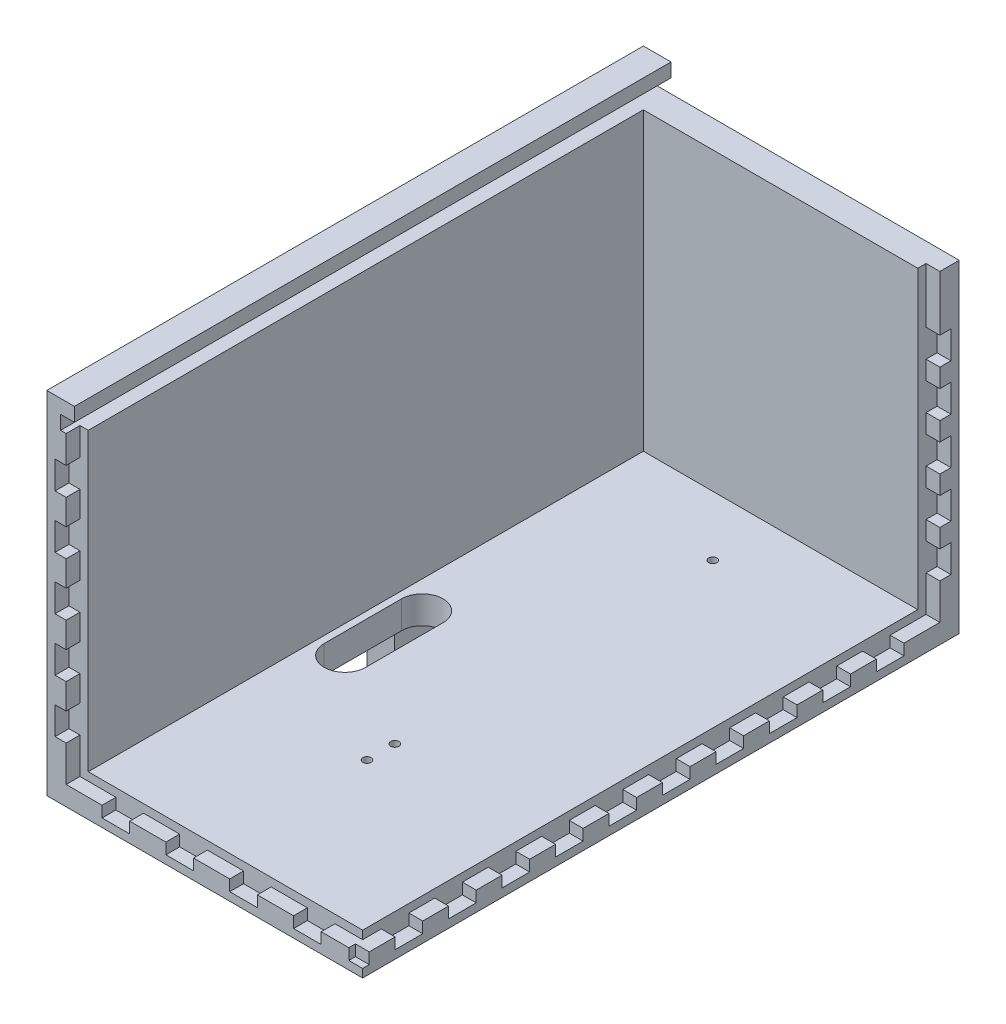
ISO-10303-21;
HEADER;
FILE_DESCRIPTION(('STEP AP214'),'2;1');
FILE_NAME('part.step','',(''),(''),'','','');
FILE_SCHEMA(('AUTOMOTIVE_DESIGN { 1 0 10303 214 1 1 1 1 }'));
ENDSEC;
DATA;
#1=APPLICATION_CONTEXT('core data for automotive mechanical design processes');
#2=APPLICATION_PROTOCOL_DEFINITION('international standard','automotive_design',2000,#1);
#3=PRODUCT_CONTEXT('',#1,'mechanical');
#4=PRODUCT('Part','Part','',(#3));
#5=PRODUCT_RELATED_PRODUCT_CATEGORY('part','',(#4));
#6=PRODUCT_DEFINITION_FORMATION('','',#4);
#7=PRODUCT_DEFINITION_CONTEXT('part definition',#1,'design');
#8=PRODUCT_DEFINITION('design','',#6,#7);
#9=PRODUCT_DEFINITION_SHAPE('','',#8);
#10=(LENGTH_UNIT() NAMED_UNIT(*) SI_UNIT(.MILLI.,.METRE.));
#11=(NAMED_UNIT(*) PLANE_ANGLE_UNIT() SI_UNIT($,.RADIAN.));
#12=(NAMED_UNIT(*) SI_UNIT($,.STERADIAN.) SOLID_ANGLE_UNIT());
#13=UNCERTAINTY_MEASURE_WITH_UNIT(LENGTH_MEASURE(1.E-05),#10,'distance_accuracy_value','');
#14=(GEOMETRIC_REPRESENTATION_CONTEXT(3) GLOBAL_UNCERTAINTY_ASSIGNED_CONTEXT((#13)) GLOBAL_UNIT_ASSIGNED_CONTEXT((#10,
#11,#12)) REPRESENTATION_CONTEXT('',''));
#15=CARTESIAN_POINT('',(0.,0.,0.));
#16=DIRECTION('',(0.,0.,1.));
#17=DIRECTION('',(1.,0.,0.));
#18=AXIS2_PLACEMENT_3D('',#15,#16,#17);
#19=CARTESIAN_POINT('',(-5.,7.,-24.1421356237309));
#20=DIRECTION('',(0.,-1.,0.));
#21=DIRECTION('',(0.,0.,-1.));
#22=AXIS2_PLACEMENT_3D('',#19,#20,#21);
#23=PLANE('',#22);
#24=DIRECTION('',(1.,0.,0.));
#25=VECTOR('',#24,1.);
#26=CARTESIAN_POINT('',(-5.,7.,-220.9));
#27=LINE('',#26,#25);
#28=CARTESIAN_POINT('',(-15.,7.,-220.9));
#29=VERTEX_POINT('',#28);
#30=CARTESIAN_POINT('',(-5.,7.,-220.9));
#31=VERTEX_POINT('',#30);
#32=EDGE_CURVE('E2112',#29,#31,#27,.T.);
#33=ORIENTED_EDGE('',*,*,#32,.F.);
#34=DIRECTION('',(0.,0.,1.));
#35=VECTOR('',#34,1.);
#36=CARTESIAN_POINT('',(-15.,6.99999999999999,-220.9));
#37=LINE('',#36,#35);
#38=CARTESIAN_POINT('',(-15.,6.99999999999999,-215.9));
#39=VERTEX_POINT('',#38);
#40=EDGE_CURVE('E2431',#29,#39,#37,.T.);
#41=ORIENTED_EDGE('',*,*,#40,.T.);
#42=DIRECTION('',(1.,0.,0.));
#43=VECTOR('',#42,1.);
#44=CARTESIAN_POINT('',(-5.,7.,-215.9));
#45=LINE('',#44,#43);
#46=CARTESIAN_POINT('',(-5.,7.,-215.9));
#47=VERTEX_POINT('',#46);
#48=EDGE_CURVE('E839',#39,#47,#45,.T.);
#49=ORIENTED_EDGE('',*,*,#48,.T.);
#50=DIRECTION('',(0.,0.,1.));
#51=VECTOR('',#50,1.);
#52=CARTESIAN_POINT('',(-5.,7.,-220.9));
#53=LINE('',#52,#51);
#54=CARTESIAN_POINT('',(-5.,7.,-218.295860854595));
#55=VERTEX_POINT('',#54);
#56=EDGE_CURVE('E847',#55,#47,#53,.T.);
#57=ORIENTED_EDGE('',*,*,#56,.F.);
#58=DIRECTION('',(1.,0.,0.));
#59=VECTOR('',#58,1.);
#60=CARTESIAN_POINT('',(-5.,6.99999999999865,-218.295860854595));
#61=LINE('',#60,#59);
#62=CARTESIAN_POINT('',(0.,6.99999999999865,-218.295860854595));
#63=VERTEX_POINT('',#62);
#64=EDGE_CURVE('E916',#55,#63,#61,.T.);
#65=ORIENTED_EDGE('',*,*,#64,.T.);
#66=DIRECTION('',(0.,0.,-1.));
#67=VECTOR('',#66,1.);
#68=CARTESIAN_POINT('',(0.,7.,-24.1421356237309));
#69=LINE('',#68,#67);
#70=CARTESIAN_POINT('',(0.,6.99999999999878,-227.646274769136));
#71=VERTEX_POINT('',#70);
#72=EDGE_CURVE('E1482',#63,#71,#69,.T.);
#73=ORIENTED_EDGE('',*,*,#72,.T.);
#74=DIRECTION('',(1.,0.,0.));
#75=VECTOR('',#74,1.);
#76=CARTESIAN_POINT('',(-5.,6.99999999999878,-227.646274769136));
#77=LINE('',#76,#75);
#78=CARTESIAN_POINT('',(-5.,6.99999999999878,-227.646274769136));
#79=VERTEX_POINT('',#78);
#80=EDGE_CURVE('E1371',#79,#71,#77,.T.);
#81=ORIENTED_EDGE('',*,*,#80,.F.);
#82=DIRECTION('',(0.,0.,-1.));
#83=VECTOR('',#82,1.);
#84=CARTESIAN_POINT('',(-5.,7.,-24.1421356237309));
#85=LINE('',#84,#83);
#86=EDGE_CURVE('E1465',#31,#79,#85,.T.);
#87=ORIENTED_EDGE('',*,*,#86,.F.);
#88=EDGE_LOOP('',(#33,#41,#49,#57,#65,#73,#81,#87));
#89=FACE_BOUND('',#88,.T.);
#90=ADVANCED_FACE('F47',(#89),#23,.F.);
#91=CARTESIAN_POINT('',(-38.1,6.99999999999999,-215.9));
#92=VERTEX_POINT('',#91);
#93=CARTESIAN_POINT('',(-25.,6.99999999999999,-215.9));
#94=VERTEX_POINT('',#93);
#95=EDGE_CURVE('E832',#92,#94,#45,.T.);
#96=ORIENTED_EDGE('',*,*,#95,.T.);
#97=DIRECTION('',(0.,0.,1.));
#98=VECTOR('',#97,1.);
#99=CARTESIAN_POINT('',(-25.,6.99999999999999,-220.9));
#100=LINE('',#99,#98);
#101=CARTESIAN_POINT('',(-25.,6.99999999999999,-220.9));
#102=VERTEX_POINT('',#101);
#103=EDGE_CURVE('E2422',#102,#94,#100,.T.);
#104=ORIENTED_EDGE('',*,*,#103,.F.);
#105=CARTESIAN_POINT('',(-38.1,6.99999999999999,-220.9));
#106=VERTEX_POINT('',#105);
#107=EDGE_CURVE('E2719',#106,#102,#27,.T.);
#108=ORIENTED_EDGE('',*,*,#107,.F.);
#109=DIRECTION('',(0.,0.,1.));
#110=VECTOR('',#109,1.);
#111=CARTESIAN_POINT('',(-38.1,6.99999999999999,-220.9));
#112=LINE('',#111,#110);
#113=EDGE_CURVE('E2399',#106,#92,#112,.T.);
#114=ORIENTED_EDGE('',*,*,#113,.T.);
#115=EDGE_LOOP('',(#96,#104,#108,#114));
#116=FACE_BOUND('',#115,.T.);
#117=ADVANCED_FACE('F1717',(#116),#23,.F.);
#118=CARTESIAN_POINT('',(-61.2,6.99999999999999,-215.9));
#119=VERTEX_POINT('',#118);
#120=CARTESIAN_POINT('',(-48.1,6.99999999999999,-215.9));
#121=VERTEX_POINT('',#120);
#122=EDGE_CURVE('E818',#119,#121,#45,.T.);
#123=ORIENTED_EDGE('',*,*,#122,.T.);
#124=DIRECTION('',(0.,0.,1.));
#125=VECTOR('',#124,1.);
#126=CARTESIAN_POINT('',(-48.1,6.99999999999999,-220.9));
#127=LINE('',#126,#125);
#128=CARTESIAN_POINT('',(-48.1,6.99999999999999,-220.9));
#129=VERTEX_POINT('',#128);
#130=EDGE_CURVE('E2390',#129,#121,#127,.T.);
#131=ORIENTED_EDGE('',*,*,#130,.F.);
#132=CARTESIAN_POINT('',(-61.2,6.99999999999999,-220.9));
#133=VERTEX_POINT('',#132);
#134=EDGE_CURVE('E820',#133,#129,#27,.T.);
#135=ORIENTED_EDGE('',*,*,#134,.F.);
#136=DIRECTION('',(0.,0.,1.));
#137=VECTOR('',#136,1.);
#138=CARTESIAN_POINT('',(-61.2,6.99999999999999,-220.9));
#139=LINE('',#138,#137);
#140=EDGE_CURVE('E803',#133,#119,#139,.T.);
#141=ORIENTED_EDGE('',*,*,#140,.T.);
#142=EDGE_LOOP('',(#123,#131,#135,#141));
#143=FACE_BOUND('',#142,.T.);
#144=ADVANCED_FACE('F816',(#143),#23,.F.);
#145=CARTESIAN_POINT('',(-107.3,6.99999999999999,-215.9));
#146=VERTEX_POINT('',#145);
#147=CARTESIAN_POINT('',(-94.3,6.99999999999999,-215.9));
#148=VERTEX_POINT('',#147);
#149=EDGE_CURVE('E837',#146,#148,#45,.T.);
#150=ORIENTED_EDGE('',*,*,#149,.T.);
#151=DIRECTION('',(0.,0.,1.));
#152=VECTOR('',#151,1.);
#153=CARTESIAN_POINT('',(-94.3,6.99999999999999,-220.9));
#154=LINE('',#153,#152);
#155=CARTESIAN_POINT('',(-94.3,6.99999999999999,-220.9));
#156=VERTEX_POINT('',#155);
#157=EDGE_CURVE('E2615',#156,#148,#154,.T.);
#158=ORIENTED_EDGE('',*,*,#157,.F.);
#159=CARTESIAN_POINT('',(-107.3,6.99999999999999,-220.9));
#160=VERTEX_POINT('',#159);
#161=EDGE_CURVE('E2109',#160,#156,#27,.T.);
#162=ORIENTED_EDGE('',*,*,#161,.F.);
#163=DIRECTION('',(0.,0.,1.));
#164=VECTOR('',#163,1.);
#165=CARTESIAN_POINT('',(-107.3,6.99999999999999,-220.9));
#166=LINE('',#165,#164);
#167=EDGE_CURVE('E852',#160,#146,#166,.T.);
#168=ORIENTED_EDGE('',*,*,#167,.T.);
#169=EDGE_LOOP('',(#150,#158,#162,#168));
#170=FACE_BOUND('',#169,.T.);
#171=ADVANCED_FACE('F1740',(#170),#23,.F.);
#172=CARTESIAN_POINT('',(-107.3,117.,-220.9));
#173=DIRECTION('',(-1.,0.,0.));
#174=DIRECTION('',(0.,-1.,0.));
#175=AXIS2_PLACEMENT_3D('',#172,#173,#174);
#176=PLANE('',#175);
#177=DIRECTION('',(0.,-1.,0.));
#178=VECTOR('',#177,1.);
#179=CARTESIAN_POINT('',(-107.3,117.,-220.9));
#180=LINE('',#179,#178);
#181=CARTESIAN_POINT('',(-107.3,97.,-220.9));
#182=VERTEX_POINT('',#181);
#183=CARTESIAN_POINT('',(-107.3,87.75,-220.9));
#184=VERTEX_POINT('',#183);
#185=EDGE_CURVE('E2639',#182,#184,#180,.T.);
#186=ORIENTED_EDGE('',*,*,#185,.F.);
#187=DIRECTION('',(0.,0.,1.));
#188=VECTOR('',#187,1.);
#189=CARTESIAN_POINT('',(-107.3,97.,-220.9));
#190=LINE('',#189,#188);
#191=CARTESIAN_POINT('',(-107.3,97.,-215.9));
#192=VERTEX_POINT('',#191);
#193=EDGE_CURVE('E2559',#182,#192,#190,.T.);
#194=ORIENTED_EDGE('',*,*,#193,.T.);
#195=DIRECTION('',(0.,-1.,0.));
#196=VECTOR('',#195,1.);
#197=CARTESIAN_POINT('',(-107.3,117.,-215.9));
#198=LINE('',#197,#196);
#199=CARTESIAN_POINT('',(-107.3,87.75,-215.9));
#200=VERTEX_POINT('',#199);
#201=EDGE_CURVE('E2652',#192,#200,#198,.T.);
#202=ORIENTED_EDGE('',*,*,#201,.T.);
#203=DIRECTION('',(0.,0.,1.));
#204=VECTOR('',#203,1.);
#205=CARTESIAN_POINT('',(-107.3,87.75,-220.9));
#206=LINE('',#205,#204);
#207=EDGE_CURVE('E2529',#184,#200,#206,.T.);
#208=ORIENTED_EDGE('',*,*,#207,.F.);
#209=EDGE_LOOP('',(#186,#194,#202,#208));
#210=FACE_BOUND('',#209,.T.);
#211=ADVANCED_FACE('F2221',(#210),#176,.F.);
#212=CARTESIAN_POINT('',(-107.3,77.75,-220.9));
#213=VERTEX_POINT('',#212);
#214=CARTESIAN_POINT('',(-107.3,68.5,-220.9));
#215=VERTEX_POINT('',#214);
#216=EDGE_CURVE('E2688',#213,#215,#180,.T.);
#217=ORIENTED_EDGE('',*,*,#216,.F.);
#218=DIRECTION('',(0.,0.,1.));
#219=VECTOR('',#218,1.);
#220=CARTESIAN_POINT('',(-107.3,77.75,-220.9));
#221=LINE('',#220,#219);
#222=CARTESIAN_POINT('',(-107.3,77.75,-215.9));
#223=VERTEX_POINT('',#222);
#224=EDGE_CURVE('E2524',#213,#223,#221,.T.);
#225=ORIENTED_EDGE('',*,*,#224,.T.);
#226=CARTESIAN_POINT('',(-107.3,68.5,-215.9));
#227=VERTEX_POINT('',#226);
#228=EDGE_CURVE('E2656',#223,#227,#198,.T.);
#229=ORIENTED_EDGE('',*,*,#228,.T.);
#230=DIRECTION('',(0.,0.,1.));
#231=VECTOR('',#230,1.);
#232=CARTESIAN_POINT('',(-107.3,68.5,-220.9));
#233=LINE('',#232,#231);
#234=EDGE_CURVE('E2494',#215,#227,#233,.T.);
#235=ORIENTED_EDGE('',*,*,#234,.F.);
#236=EDGE_LOOP('',(#217,#225,#229,#235));
#237=FACE_BOUND('',#236,.T.);
#238=ADVANCED_FACE('F2679',(#237),#176,.F.);
#239=CARTESIAN_POINT('',(-107.3,58.5,-220.9));
#240=VERTEX_POINT('',#239);
#241=CARTESIAN_POINT('',(-107.3,49.25,-220.9));
#242=VERTEX_POINT('',#241);
#243=EDGE_CURVE('E2693',#240,#242,#180,.T.);
#244=ORIENTED_EDGE('',*,*,#243,.F.);
#245=DIRECTION('',(0.,0.,1.));
#246=VECTOR('',#245,1.);
#247=CARTESIAN_POINT('',(-107.3,58.5,-220.9));
#248=LINE('',#247,#246);
#249=CARTESIAN_POINT('',(-107.3,58.5,-215.9));
#250=VERTEX_POINT('',#249);
#251=EDGE_CURVE('E2489',#240,#250,#248,.T.);
#252=ORIENTED_EDGE('',*,*,#251,.T.);
#253=CARTESIAN_POINT('',(-107.3,49.25,-215.9));
#254=VERTEX_POINT('',#253);
#255=EDGE_CURVE('E2664',#250,#254,#198,.T.);
#256=ORIENTED_EDGE('',*,*,#255,.T.);
#257=DIRECTION('',(0.,0.,1.));
#258=VECTOR('',#257,1.);
#259=CARTESIAN_POINT('',(-107.3,49.25,-220.9));
#260=LINE('',#259,#258);
#261=EDGE_CURVE('E2459',#242,#254,#260,.T.);
#262=ORIENTED_EDGE('',*,*,#261,.F.);
#263=EDGE_LOOP('',(#244,#252,#256,#262));
#264=FACE_BOUND('',#263,.T.);
#265=ADVANCED_FACE('F2740',(#264),#176,.F.);
#266=CARTESIAN_POINT('',(-107.3,39.25,-220.9));
#267=VERTEX_POINT('',#266);
#268=CARTESIAN_POINT('',(-107.3,30.,-220.9));
#269=VERTEX_POINT('',#268);
#270=EDGE_CURVE('E2696',#267,#269,#180,.T.);
#271=ORIENTED_EDGE('',*,*,#270,.F.);
#272=DIRECTION('',(0.,0.,1.));
#273=VECTOR('',#272,1.);
#274=CARTESIAN_POINT('',(-107.3,39.25,-220.9));
#275=LINE('',#274,#273);
#276=CARTESIAN_POINT('',(-107.3,39.25,-215.9));
#277=VERTEX_POINT('',#276);
#278=EDGE_CURVE('E2454',#267,#277,#275,.T.);
#279=ORIENTED_EDGE('',*,*,#278,.T.);
#280=CARTESIAN_POINT('',(-107.3,30.,-215.9));
#281=VERTEX_POINT('',#280);
#282=EDGE_CURVE('E2658',#277,#281,#198,.T.);
#283=ORIENTED_EDGE('',*,*,#282,.T.);
#284=DIRECTION('',(0.,0.,1.));
#285=VECTOR('',#284,1.);
#286=CARTESIAN_POINT('',(-107.3,30.,-220.9));
#287=LINE('',#286,#285);
#288=EDGE_CURVE('E2356',#269,#281,#287,.T.);
#289=ORIENTED_EDGE('',*,*,#288,.F.);
#290=EDGE_LOOP('',(#271,#279,#283,#289));
#291=FACE_BOUND('',#290,.T.);
#292=ADVANCED_FACE('F2954',(#291),#176,.F.);
#293=CARTESIAN_POINT('',(-107.3,20.,-220.9));
#294=VERTEX_POINT('',#293);
#295=EDGE_CURVE('E2634',#294,#160,#180,.T.);
#296=ORIENTED_EDGE('',*,*,#295,.F.);
#297=DIRECTION('',(0.,0.,1.));
#298=VECTOR('',#297,1.);
#299=CARTESIAN_POINT('',(-107.3,20.,-220.9));
#300=LINE('',#299,#298);
#301=CARTESIAN_POINT('',(-107.3,20.,-215.9));
#302=VERTEX_POINT('',#301);
#303=EDGE_CURVE('E2366',#294,#302,#300,.T.);
#304=ORIENTED_EDGE('',*,*,#303,.T.);
#305=EDGE_CURVE('E2618',#302,#146,#198,.T.);
#306=ORIENTED_EDGE('',*,*,#305,.T.);
#307=ORIENTED_EDGE('',*,*,#167,.F.);
#308=EDGE_LOOP('',(#296,#304,#306,#307));
#309=FACE_BOUND('',#308,.T.);
#310=ADVANCED_FACE('F2222',(#309),#176,.F.);
#311=CARTESIAN_POINT('',(-5.,0.,0.));
#312=DIRECTION('',(1.,0.,0.));
#313=DIRECTION('',(0.,0.,-1.));
#314=AXIS2_PLACEMENT_3D('',#311,#312,#313);
#315=PLANE('',#314);
#316=ORIENTED_EDGE('',*,*,#56,.T.);
#317=DIRECTION('',(0.,-1.,0.));
#318=VECTOR('',#317,1.);
#319=CARTESIAN_POINT('',(-5.,0.,-215.9));
#320=LINE('',#319,#318);
#321=CARTESIAN_POINT('',(-5.,2.99999999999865,-215.9));
#322=VERTEX_POINT('',#321);
#323=EDGE_CURVE('E868',#47,#322,#320,.T.);
#324=ORIENTED_EDGE('',*,*,#323,.T.);
#325=DIRECTION('',(0.,0.,-1.));
#326=VECTOR('',#325,1.);
#327=CARTESIAN_POINT('',(-5.,2.99999999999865,-208.295860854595));
#328=LINE('',#327,#326);
#329=CARTESIAN_POINT('',(-5.,2.99999999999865,-218.295860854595));
#330=VERTEX_POINT('',#329);
#331=EDGE_CURVE('E1403',#322,#330,#328,.T.);
#332=ORIENTED_EDGE('',*,*,#331,.T.);
#333=DIRECTION('',(0.,-1.,0.));
#334=VECTOR('',#333,1.);
#335=CARTESIAN_POINT('',(-5.,6.99999999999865,-218.295860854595));
#336=LINE('',#335,#334);
#337=EDGE_CURVE('E1407',#55,#330,#336,.T.);
#338=ORIENTED_EDGE('',*,*,#337,.F.);
#339=EDGE_LOOP('',(#316,#324,#332,#338));
#340=FACE_BOUND('',#339,.T.);
#341=ADVANCED_FACE('F2013',(#340),#315,.T.);
#342=CARTESIAN_POINT('',(0.,0.,0.));
#343=DIRECTION('',(-1.,0.,0.));
#344=DIRECTION('',(0.,0.,1.));
#345=AXIS2_PLACEMENT_3D('',#342,#343,#344);
#346=PLANE('',#345);
#347=DIRECTION('',(0.,1.,0.));
#348=VECTOR('',#347,1.);
#349=CARTESIAN_POINT('',(0.,127.,-215.9));
#350=LINE('',#349,#348);
#351=CARTESIAN_POINT('',(0.,0.,-215.9));
#352=VERTEX_POINT('',#351);
#353=CARTESIAN_POINT('',(0.,2.99999999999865,-215.9));
#354=VERTEX_POINT('',#353);
#355=EDGE_CURVE('E862',#352,#354,#350,.T.);
#356=ORIENTED_EDGE('',*,*,#355,.F.);
#357=DIRECTION('',(0.,0.,1.));
#358=VECTOR('',#357,1.);
#359=CARTESIAN_POINT('',(0.,0.,0.));
#360=LINE('',#359,#358);
#361=CARTESIAN_POINT('',(0.,0.,-431.8));
#362=VERTEX_POINT('',#361);
#363=EDGE_CURVE('E1502',#362,#352,#360,.T.);
#364=ORIENTED_EDGE('',*,*,#363,.F.);
#365=DIRECTION('',(0.,1.,0.));
#366=VECTOR('',#365,1.);
#367=CARTESIAN_POINT('',(0.,127.,-431.8));
#368=LINE('',#367,#366);
#369=CARTESIAN_POINT('',(0.,117.,-431.8));
#370=VERTEX_POINT('',#369);
#371=EDGE_CURVE('E1492',#362,#370,#368,.T.);
#372=ORIENTED_EDGE('',*,*,#371,.T.);
#373=DIRECTION('',(0.,0.,-1.));
#374=VECTOR('',#373,1.);
#375=CARTESIAN_POINT('',(0.,117.,-132.));
#376=LINE('',#375,#374);
#377=CARTESIAN_POINT('',(0.,117.,-424.8));
#378=VERTEX_POINT('',#377);
#379=EDGE_CURVE('E1499',#378,#370,#376,.T.);
#380=ORIENTED_EDGE('',*,*,#379,.F.);
#381=DIRECTION('',(0.,-1.,0.));
#382=VECTOR('',#381,1.);
#383=CARTESIAN_POINT('',(0.,117.,-424.8));
#384=LINE('',#383,#382);
#385=CARTESIAN_POINT('',(0.,97.,-424.8));
#386=VERTEX_POINT('',#385);
#387=EDGE_CURVE('E1457',#378,#386,#384,.T.);
#388=ORIENTED_EDGE('',*,*,#387,.T.);
#389=DIRECTION('',(0.,0.,-1.));
#390=VECTOR('',#389,1.);
#391=CARTESIAN_POINT('',(0.,97.,-424.8));
#392=LINE('',#391,#390);
#393=CARTESIAN_POINT('',(0.,97.,-428.8));
#394=VERTEX_POINT('',#393);
#395=EDGE_CURVE('E903',#386,#394,#392,.T.);
#396=ORIENTED_EDGE('',*,*,#395,.T.);
#397=DIRECTION('',(0.,1.,0.));
#398=VECTOR('',#397,1.);
#399=CARTESIAN_POINT('',(0.,87.,-428.8));
#400=LINE('',#399,#398);
#401=CARTESIAN_POINT('',(0.,87.,-428.8));
#402=VERTEX_POINT('',#401);
#403=EDGE_CURVE('E907',#402,#394,#400,.T.);
#404=ORIENTED_EDGE('',*,*,#403,.F.);
#405=DIRECTION('',(0.,0.,-1.));
#406=VECTOR('',#405,1.);
#407=CARTESIAN_POINT('',(0.,87.,-424.8));
#408=LINE('',#407,#406);
#409=CARTESIAN_POINT('',(0.,87.,-424.8));
#410=VERTEX_POINT('',#409);
#411=EDGE_CURVE('E912',#410,#402,#408,.T.);
#412=ORIENTED_EDGE('',*,*,#411,.F.);
#413=CARTESIAN_POINT('',(0.,80.25,-424.8));
#414=VERTEX_POINT('',#413);
#415=EDGE_CURVE('E1486',#410,#414,#384,.T.);
#416=ORIENTED_EDGE('',*,*,#415,.T.);
#417=DIRECTION('',(0.,0.,-1.));
#418=VECTOR('',#417,1.);
#419=CARTESIAN_POINT('',(0.,80.25,-424.8));
#420=LINE('',#419,#418);
#421=CARTESIAN_POINT('',(0.,80.25,-428.8));
#422=VERTEX_POINT('',#421);
#423=EDGE_CURVE('E941',#414,#422,#420,.T.);
#424=ORIENTED_EDGE('',*,*,#423,.T.);
#425=DIRECTION('',(0.,1.,0.));
#426=VECTOR('',#425,1.);
#427=CARTESIAN_POINT('',(0.,70.25,-428.8));
#428=LINE('',#427,#426);
#429=CARTESIAN_POINT('',(0.,70.25,-428.8));
#430=VERTEX_POINT('',#429);
#431=EDGE_CURVE('E945',#430,#422,#428,.T.);
#432=ORIENTED_EDGE('',*,*,#431,.F.);
#433=DIRECTION('',(0.,0.,-1.));
#434=VECTOR('',#433,1.);
#435=CARTESIAN_POINT('',(0.,70.25,-424.8));
#436=LINE('',#435,#434);
#437=CARTESIAN_POINT('',(0.,70.25,-424.8));
#438=VERTEX_POINT('',#437);
#439=EDGE_CURVE('E950',#438,#430,#436,.T.);
#440=ORIENTED_EDGE('',*,*,#439,.F.);
#441=CARTESIAN_POINT('',(0.,63.5,-424.8));
#442=VERTEX_POINT('',#441);
#443=EDGE_CURVE('E2072',#438,#442,#384,.T.);
#444=ORIENTED_EDGE('',*,*,#443,.T.);
#445=DIRECTION('',(0.,0.,-1.));
#446=VECTOR('',#445,1.);
#447=CARTESIAN_POINT('',(0.,63.5,-424.8));
#448=LINE('',#447,#446);
#449=CARTESIAN_POINT('',(0.,63.5,-428.8));
#450=VERTEX_POINT('',#449);
#451=EDGE_CURVE('E979',#442,#450,#448,.T.);
#452=ORIENTED_EDGE('',*,*,#451,.T.);
#453=DIRECTION('',(0.,1.,0.));
#454=VECTOR('',#453,1.);
#455=CARTESIAN_POINT('',(0.,53.5,-428.8));
#456=LINE('',#455,#454);
#457=CARTESIAN_POINT('',(0.,53.5,-428.8));
#458=VERTEX_POINT('',#457);
#459=EDGE_CURVE('E983',#458,#450,#456,.T.);
#460=ORIENTED_EDGE('',*,*,#459,.F.);
#461=DIRECTION('',(0.,0.,-1.));
#462=VECTOR('',#461,1.);
#463=CARTESIAN_POINT('',(0.,53.5,-424.8));
#464=LINE('',#463,#462);
#465=CARTESIAN_POINT('',(0.,53.5,-424.8));
#466=VERTEX_POINT('',#465);
#467=EDGE_CURVE('E940',#466,#458,#464,.T.);
#468=ORIENTED_EDGE('',*,*,#467,.F.);
#469=CARTESIAN_POINT('',(0.,46.75,-424.8));
#470=VERTEX_POINT('',#469);
#471=EDGE_CURVE('E1778',#466,#470,#384,.T.);
#472=ORIENTED_EDGE('',*,*,#471,.T.);
#473=DIRECTION('',(0.,0.,-1.));
#474=VECTOR('',#473,1.);
#475=CARTESIAN_POINT('',(0.,46.75,-424.8));
#476=LINE('',#475,#474);
#477=CARTESIAN_POINT('',(0.,46.75,-428.8));
#478=VERTEX_POINT('',#477);
#479=EDGE_CURVE('E1015',#470,#478,#476,.T.);
#480=ORIENTED_EDGE('',*,*,#479,.T.);
#481=DIRECTION('',(0.,1.,0.));
#482=VECTOR('',#481,1.);
#483=CARTESIAN_POINT('',(0.,36.75,-428.8));
#484=LINE('',#483,#482);
#485=CARTESIAN_POINT('',(0.,36.75,-428.8));
#486=VERTEX_POINT('',#485);
#487=EDGE_CURVE('E1019',#486,#478,#484,.T.);
#488=ORIENTED_EDGE('',*,*,#487,.F.);
#489=DIRECTION('',(0.,0.,-1.));
#490=VECTOR('',#489,1.);
#491=CARTESIAN_POINT('',(0.,36.75,-424.8));
#492=LINE('',#491,#490);
#493=CARTESIAN_POINT('',(0.,36.75,-424.8));
#494=VERTEX_POINT('',#493);
#495=EDGE_CURVE('E978',#494,#486,#492,.T.);
#496=ORIENTED_EDGE('',*,*,#495,.F.);
#497=CARTESIAN_POINT('',(0.,30.,-424.8));
#498=VERTEX_POINT('',#497);
#499=EDGE_CURVE('E1774',#494,#498,#384,.T.);
#500=ORIENTED_EDGE('',*,*,#499,.T.);
#501=DIRECTION('',(0.,0.,-1.));
#502=VECTOR('',#501,1.);
#503=CARTESIAN_POINT('',(0.,30.,-424.8));
#504=LINE('',#503,#502);
#505=CARTESIAN_POINT('',(0.,30.,-428.8));
#506=VERTEX_POINT('',#505);
#507=EDGE_CURVE('E1014',#498,#506,#504,.T.);
#508=ORIENTED_EDGE('',*,*,#507,.T.);
#509=DIRECTION('',(0.,1.,0.));
#510=VECTOR('',#509,1.);
#511=CARTESIAN_POINT('',(0.,20.,-428.8));
#512=LINE('',#511,#510);
#513=CARTESIAN_POINT('',(0.,20.,-428.8));
#514=VERTEX_POINT('',#513);
#515=EDGE_CURVE('E1055',#514,#506,#512,.T.);
#516=ORIENTED_EDGE('',*,*,#515,.F.);
#517=DIRECTION('',(0.,0.,-1.));
#518=VECTOR('',#517,1.);
#519=CARTESIAN_POINT('',(0.,20.,-424.8));
#520=LINE('',#519,#518);
#521=CARTESIAN_POINT('',(0.,20.,-424.8));
#522=VERTEX_POINT('',#521);
#523=EDGE_CURVE('E1051',#522,#514,#520,.T.);
#524=ORIENTED_EDGE('',*,*,#523,.F.);
#525=CARTESIAN_POINT('',(0.,7.,-424.8));
#526=VERTEX_POINT('',#525);
#527=EDGE_CURVE('E1487',#522,#526,#384,.T.);
#528=ORIENTED_EDGE('',*,*,#527,.T.);
#529=CARTESIAN_POINT('',(0.,7.,-411.8));
#530=VERTEX_POINT('',#529);
#531=EDGE_CURVE('E1442',#530,#526,#69,.T.);
#532=ORIENTED_EDGE('',*,*,#531,.F.);
#533=DIRECTION('',(0.,-1.,0.));
#534=VECTOR('',#533,1.);
#535=CARTESIAN_POINT('',(0.,7.,-411.8));
#536=LINE('',#535,#534);
#537=CARTESIAN_POINT('',(0.,3.,-411.8));
#538=VERTEX_POINT('',#537);
#539=EDGE_CURVE('E1432',#530,#538,#536,.T.);
#540=ORIENTED_EDGE('',*,*,#539,.T.);
#541=DIRECTION('',(0.,0.,-1.));
#542=VECTOR('',#541,1.);
#543=CARTESIAN_POINT('',(0.,3.,-401.8));
#544=LINE('',#543,#542);
#545=CARTESIAN_POINT('',(0.,3.,-401.8));
#546=VERTEX_POINT('',#545);
#547=EDGE_CURVE('E954',#546,#538,#544,.T.);
#548=ORIENTED_EDGE('',*,*,#547,.F.);
#549=DIRECTION('',(0.,-1.,0.));
#550=VECTOR('',#549,1.);
#551=CARTESIAN_POINT('',(0.,7.,-401.8));
#552=LINE('',#551,#550);
#553=CARTESIAN_POINT('',(0.,7.,-401.8));
#554=VERTEX_POINT('',#553);
#555=EDGE_CURVE('E1421',#554,#546,#552,.T.);
#556=ORIENTED_EDGE('',*,*,#555,.F.);
#557=CARTESIAN_POINT('',(0.,6.99999999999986,-392.44958608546));
#558=VERTEX_POINT('',#557);
#559=EDGE_CURVE('E1481',#558,#554,#69,.T.);
#560=ORIENTED_EDGE('',*,*,#559,.F.);
#561=DIRECTION('',(0.,-1.,0.));
#562=VECTOR('',#561,1.);
#563=CARTESIAN_POINT('',(0.,6.99999999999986,-392.44958608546));
#564=LINE('',#563,#562);
#565=CARTESIAN_POINT('',(0.,2.99999999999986,-392.44958608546));
#566=VERTEX_POINT('',#565);
#567=EDGE_CURVE('E1040',#558,#566,#564,.T.);
#568=ORIENTED_EDGE('',*,*,#567,.T.);
#569=DIRECTION('',(0.,0.,-1.));
#570=VECTOR('',#569,1.);
#571=CARTESIAN_POINT('',(0.,2.99999999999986,-382.44958608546));
#572=LINE('',#571,#570);
#573=CARTESIAN_POINT('',(0.,2.99999999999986,-382.44958608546));
#574=VERTEX_POINT('',#573);
#575=EDGE_CURVE('E1165',#574,#566,#572,.T.);
#576=ORIENTED_EDGE('',*,*,#575,.F.);
#577=DIRECTION('',(0.,-1.,0.));
#578=VECTOR('',#577,1.);
#579=CARTESIAN_POINT('',(0.,6.99999999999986,-382.44958608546));
#580=LINE('',#579,#578);
#581=CARTESIAN_POINT('',(0.,6.99999999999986,-382.44958608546));
#582=VERTEX_POINT('',#581);
#583=EDGE_CURVE('E1161',#582,#574,#580,.T.);
#584=ORIENTED_EDGE('',*,*,#583,.F.);
#585=CARTESIAN_POINT('',(0.,6.99999999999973,-373.099172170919));
#586=VERTEX_POINT('',#585);
#587=EDGE_CURVE('E1820',#586,#582,#69,.T.);
#588=ORIENTED_EDGE('',*,*,#587,.F.);
#589=DIRECTION('',(0.,-1.,0.));
#590=VECTOR('',#589,1.);
#591=CARTESIAN_POINT('',(0.,6.99999999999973,-373.099172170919));
#592=LINE('',#591,#590);
#593=CARTESIAN_POINT('',(0.,2.99999999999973,-373.099172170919));
#594=VERTEX_POINT('',#593);
#595=EDGE_CURVE('E1077',#586,#594,#592,.T.);
#596=ORIENTED_EDGE('',*,*,#595,.T.);
#597=DIRECTION('',(0.,0.,-1.));
#598=VECTOR('',#597,1.);
#599=CARTESIAN_POINT('',(0.,2.99999999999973,-363.099172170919));
#600=LINE('',#599,#598);
#601=CARTESIAN_POINT('',(0.,2.99999999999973,-363.099172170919));
#602=VERTEX_POINT('',#601);
#603=EDGE_CURVE('E1129',#602,#594,#600,.T.);
#604=ORIENTED_EDGE('',*,*,#603,.F.);
#605=DIRECTION('',(0.,-1.,0.));
#606=VECTOR('',#605,1.);
#607=CARTESIAN_POINT('',(0.,6.99999999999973,-363.099172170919));
#608=LINE('',#607,#606);
#609=CARTESIAN_POINT('',(0.,6.99999999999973,-363.099172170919));
#610=VERTEX_POINT('',#609);
#611=EDGE_CURVE('E1125',#610,#602,#608,.T.);
#612=ORIENTED_EDGE('',*,*,#611,.F.);
#613=CARTESIAN_POINT('',(0.,6.99999999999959,-353.748758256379));
#614=VERTEX_POINT('',#613);
#615=EDGE_CURVE('E1815',#614,#610,#69,.T.);
#616=ORIENTED_EDGE('',*,*,#615,.F.);
#617=DIRECTION('',(0.,-1.,0.));
#618=VECTOR('',#617,1.);
#619=CARTESIAN_POINT('',(0.,6.99999999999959,-353.748758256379));
#620=LINE('',#619,#618);
#621=CARTESIAN_POINT('',(0.,2.99999999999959,-353.748758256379));
#622=VERTEX_POINT('',#621);
#623=EDGE_CURVE('E1151',#614,#622,#620,.T.);
#624=ORIENTED_EDGE('',*,*,#623,.T.);
#625=DIRECTION('',(0.,0.,-1.));
#626=VECTOR('',#625,1.);
#627=CARTESIAN_POINT('',(0.,2.99999999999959,-343.748758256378));
#628=LINE('',#627,#626);
#629=CARTESIAN_POINT('',(0.,2.99999999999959,-343.748758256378));
#630=VERTEX_POINT('',#629);
#631=EDGE_CURVE('E1199',#630,#622,#628,.T.);
#632=ORIENTED_EDGE('',*,*,#631,.F.);
#633=DIRECTION('',(0.,-1.,0.));
#634=VECTOR('',#633,1.);
#635=CARTESIAN_POINT('',(0.,6.99999999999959,-343.748758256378));
#636=LINE('',#635,#634);
#637=CARTESIAN_POINT('',(0.,6.99999999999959,-343.748758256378));
#638=VERTEX_POINT('',#637);
#639=EDGE_CURVE('E1195',#638,#630,#636,.T.);
#640=ORIENTED_EDGE('',*,*,#639,.F.);
#641=CARTESIAN_POINT('',(0.,6.99999999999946,-334.398344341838));
#642=VERTEX_POINT('',#641);
#643=EDGE_CURVE('E1809',#642,#638,#69,.T.);
#644=ORIENTED_EDGE('',*,*,#643,.F.);
#645=DIRECTION('',(0.,-1.,0.));
#646=VECTOR('',#645,1.);
#647=CARTESIAN_POINT('',(0.,6.99999999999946,-334.398344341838));
#648=LINE('',#647,#646);
#649=CARTESIAN_POINT('',(0.,2.99999999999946,-334.398344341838));
#650=VERTEX_POINT('',#649);
#651=EDGE_CURVE('E1096',#642,#650,#648,.T.);
#652=ORIENTED_EDGE('',*,*,#651,.T.);
#653=DIRECTION('',(0.,0.,-1.));
#654=VECTOR('',#653,1.);
#655=CARTESIAN_POINT('',(0.,2.99999999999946,-324.398344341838));
#656=LINE('',#655,#654);
#657=CARTESIAN_POINT('',(0.,2.99999999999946,-324.398344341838));
#658=VERTEX_POINT('',#657);
#659=EDGE_CURVE('E1091',#658,#650,#656,.T.);
#660=ORIENTED_EDGE('',*,*,#659,.F.);
#661=DIRECTION('',(0.,-1.,0.));
#662=VECTOR('',#661,1.);
#663=CARTESIAN_POINT('',(0.,6.99999999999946,-324.398344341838));
#664=LINE('',#663,#662);
#665=CARTESIAN_POINT('',(0.,6.99999999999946,-324.398344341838));
#666=VERTEX_POINT('',#665);
#667=EDGE_CURVE('E1087',#666,#658,#664,.T.);
#668=ORIENTED_EDGE('',*,*,#667,.F.);
#669=CARTESIAN_POINT('',(0.,6.99999999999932,-315.047930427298));
#670=VERTEX_POINT('',#669);
#671=EDGE_CURVE('E1803',#670,#666,#69,.T.);
#672=ORIENTED_EDGE('',*,*,#671,.F.);
#673=DIRECTION('',(0.,-1.,0.));
#674=VECTOR('',#673,1.);
#675=CARTESIAN_POINT('',(0.,6.99999999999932,-315.047930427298));
#676=LINE('',#675,#674);
#677=CARTESIAN_POINT('',(0.,2.99999999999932,-315.047930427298));
#678=VERTEX_POINT('',#677);
#679=EDGE_CURVE('E1115',#670,#678,#676,.T.);
#680=ORIENTED_EDGE('',*,*,#679,.T.);
#681=DIRECTION('',(0.,0.,-1.));
#682=VECTOR('',#681,1.);
#683=CARTESIAN_POINT('',(0.,2.99999999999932,-305.047930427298));
#684=LINE('',#683,#682);
#685=CARTESIAN_POINT('',(0.,2.99999999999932,-305.047930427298));
#686=VERTEX_POINT('',#685);
#687=EDGE_CURVE('E1235',#686,#678,#684,.T.);
#688=ORIENTED_EDGE('',*,*,#687,.F.);
#689=DIRECTION('',(0.,-1.,0.));
#690=VECTOR('',#689,1.);
#691=CARTESIAN_POINT('',(0.,6.99999999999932,-305.047930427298));
#692=LINE('',#691,#690);
#693=CARTESIAN_POINT('',(0.,6.99999999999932,-305.047930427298));
#694=VERTEX_POINT('',#693);
#695=EDGE_CURVE('E1231',#694,#686,#692,.T.);
#696=ORIENTED_EDGE('',*,*,#695,.F.);
#697=CARTESIAN_POINT('',(0.,6.99999999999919,-295.697516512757));
#698=VERTEX_POINT('',#697);
#699=EDGE_CURVE('E1797',#698,#694,#69,.T.);
#700=ORIENTED_EDGE('',*,*,#699,.F.);
#701=DIRECTION('',(0.,-1.,0.));
#702=VECTOR('',#701,1.);
#703=CARTESIAN_POINT('',(0.,6.99999999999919,-295.697516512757));
#704=LINE('',#703,#702);
#705=CARTESIAN_POINT('',(0.,2.99999999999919,-295.697516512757));
#706=VERTEX_POINT('',#705);
#707=EDGE_CURVE('E1221',#698,#706,#704,.T.);
#708=ORIENTED_EDGE('',*,*,#707,.T.);
#709=DIRECTION('',(0.,0.,-1.));
#710=VECTOR('',#709,1.);
#711=CARTESIAN_POINT('',(0.,2.99999999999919,-285.697516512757));
#712=LINE('',#711,#710);
#713=CARTESIAN_POINT('',(0.,2.99999999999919,-285.697516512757));
#714=VERTEX_POINT('',#713);
#715=EDGE_CURVE('E1271',#714,#706,#712,.T.);
#716=ORIENTED_EDGE('',*,*,#715,.F.);
#717=DIRECTION('',(0.,-1.,0.));
#718=VECTOR('',#717,1.);
#719=CARTESIAN_POINT('',(0.,6.99999999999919,-285.697516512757));
#720=LINE('',#719,#718);
#721=CARTESIAN_POINT('',(0.,6.99999999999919,-285.697516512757));
#722=VERTEX_POINT('',#721);
#723=EDGE_CURVE('E1267',#722,#714,#720,.T.);
#724=ORIENTED_EDGE('',*,*,#723,.F.);
#725=CARTESIAN_POINT('',(0.,6.99999999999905,-276.347102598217));
#726=VERTEX_POINT('',#725);
#727=EDGE_CURVE('E1791',#726,#722,#69,.T.);
#728=ORIENTED_EDGE('',*,*,#727,.F.);
#729=DIRECTION('',(0.,-1.,0.));
#730=VECTOR('',#729,1.);
#731=CARTESIAN_POINT('',(0.,6.99999999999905,-276.347102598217));
#732=LINE('',#731,#730);
#733=CARTESIAN_POINT('',(0.,2.99999999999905,-276.347102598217));
#734=VERTEX_POINT('',#733);
#735=EDGE_CURVE('E1257',#726,#734,#732,.T.);
#736=ORIENTED_EDGE('',*,*,#735,.T.);
#737=DIRECTION('',(0.,0.,-1.));
#738=VECTOR('',#737,1.);
#739=CARTESIAN_POINT('',(0.,2.99999999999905,-266.347102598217));
#740=LINE('',#739,#738);
#741=CARTESIAN_POINT('',(0.,2.99999999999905,-266.347102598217));
#742=VERTEX_POINT('',#741);
#743=EDGE_CURVE('E1307',#742,#734,#740,.T.);
#744=ORIENTED_EDGE('',*,*,#743,.F.);
#745=DIRECTION('',(0.,-1.,0.));
#746=VECTOR('',#745,1.);
#747=CARTESIAN_POINT('',(0.,6.99999999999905,-266.347102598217));
#748=LINE('',#747,#746);
#749=CARTESIAN_POINT('',(0.,6.99999999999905,-266.347102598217));
#750=VERTEX_POINT('',#749);
#751=EDGE_CURVE('E1303',#750,#742,#748,.T.);
#752=ORIENTED_EDGE('',*,*,#751,.F.);
#753=CARTESIAN_POINT('',(0.,6.99999999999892,-256.996688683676));
#754=VERTEX_POINT('',#753);
#755=EDGE_CURVE('E1785',#754,#750,#69,.T.);
#756=ORIENTED_EDGE('',*,*,#755,.F.);
#757=DIRECTION('',(0.,-1.,0.));
#758=VECTOR('',#757,1.);
#759=CARTESIAN_POINT('',(0.,6.99999999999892,-256.996688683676));
#760=LINE('',#759,#758);
#761=CARTESIAN_POINT('',(0.,2.99999999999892,-256.996688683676));
#762=VERTEX_POINT('',#761);
#763=EDGE_CURVE('E1293',#754,#762,#760,.T.);
#764=ORIENTED_EDGE('',*,*,#763,.T.);
#765=DIRECTION('',(0.,0.,-1.));
#766=VECTOR('',#765,1.);
#767=CARTESIAN_POINT('',(0.,2.99999999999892,-246.996688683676));
#768=LINE('',#767,#766);
#769=CARTESIAN_POINT('',(0.,2.99999999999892,-246.996688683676));
#770=VERTEX_POINT('',#769);
#771=EDGE_CURVE('E1343',#770,#762,#768,.T.);
#772=ORIENTED_EDGE('',*,*,#771,.F.);
#773=DIRECTION('',(0.,-1.,0.));
#774=VECTOR('',#773,1.);
#775=CARTESIAN_POINT('',(0.,6.99999999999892,-246.996688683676));
#776=LINE('',#775,#774);
#777=CARTESIAN_POINT('',(0.,6.99999999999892,-246.996688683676));
#778=VERTEX_POINT('',#777);
#779=EDGE_CURVE('E1339',#778,#770,#776,.T.);
#780=ORIENTED_EDGE('',*,*,#779,.F.);
#781=CARTESIAN_POINT('',(0.,6.99999999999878,-237.646274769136));
#782=VERTEX_POINT('',#781);
#783=EDGE_CURVE('E1780',#782,#778,#69,.T.);
#784=ORIENTED_EDGE('',*,*,#783,.F.);
#785=DIRECTION('',(0.,-1.,0.));
#786=VECTOR('',#785,1.);
#787=CARTESIAN_POINT('',(0.,6.99999999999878,-237.646274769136));
#788=LINE('',#787,#786);
#789=CARTESIAN_POINT('',(0.,2.99999999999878,-237.646274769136));
#790=VERTEX_POINT('',#789);
#791=EDGE_CURVE('E1329',#782,#790,#788,.T.);
#792=ORIENTED_EDGE('',*,*,#791,.T.);
#793=DIRECTION('',(0.,0.,-1.));
#794=VECTOR('',#793,1.);
#795=CARTESIAN_POINT('',(0.,2.99999999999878,-227.646274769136));
#796=LINE('',#795,#794);
#797=CARTESIAN_POINT('',(0.,2.99999999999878,-227.646274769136));
#798=VERTEX_POINT('',#797);
#799=EDGE_CURVE('E1379',#798,#790,#796,.T.);
#800=ORIENTED_EDGE('',*,*,#799,.F.);
#801=DIRECTION('',(0.,-1.,0.));
#802=VECTOR('',#801,1.);
#803=CARTESIAN_POINT('',(0.,6.99999999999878,-227.646274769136));
#804=LINE('',#803,#802);
#805=EDGE_CURVE('E1375',#71,#798,#804,.T.);
#806=ORIENTED_EDGE('',*,*,#805,.F.);
#807=ORIENTED_EDGE('',*,*,#72,.F.);
#808=DIRECTION('',(0.,-1.,0.));
#809=VECTOR('',#808,1.);
#810=CARTESIAN_POINT('',(0.,6.99999999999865,-218.295860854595));
#811=LINE('',#810,#809);
#812=CARTESIAN_POINT('',(0.,2.99999999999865,-218.295860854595));
#813=VERTEX_POINT('',#812);
#814=EDGE_CURVE('E1365',#63,#813,#811,.T.);
#815=ORIENTED_EDGE('',*,*,#814,.T.);
#816=DIRECTION('',(0.,0.,-1.));
#817=VECTOR('',#816,1.);
#818=CARTESIAN_POINT('',(0.,2.99999999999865,-208.295860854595));
#819=LINE('',#818,#817);
#820=EDGE_CURVE('E1404',#354,#813,#819,.T.);
#821=ORIENTED_EDGE('',*,*,#820,.F.);
#822=EDGE_LOOP('',(#356,#364,#372,#380,#388,#396,#404,#412,#416,#424,#432,#440,#444,#452,#460,
#468,#472,#480,#488,#496,#500,#508,#516,#524,#528,#532,#540,#548,#556,#560,#568,#576,#584,#588,
#596,#604,#612,#616,#624,#632,#640,#644,#652,#660,#668,#672,#680,#688,#696,#700,#708,#716,#724,
#728,#736,#744,#752,#756,#764,#772,#780,#784,#792,#800,#806,#807,#815,#821));
#823=FACE_BOUND('',#822,.T.);
#824=ADVANCED_FACE('F1766',(#823),#346,.F.);
#825=CARTESIAN_POINT('',(109.3,117.,-132.));
#826=DIRECTION('',(0.,-1.,0.));
#827=DIRECTION('',(0.,0.,-1.));
#828=AXIS2_PLACEMENT_3D('',#825,#826,#827);
#829=PLANE('',#828);
#830=DIRECTION('',(-1.,0.,0.));
#831=VECTOR('',#830,1.);
#832=CARTESIAN_POINT('',(109.3,117.,-215.9));
#833=LINE('',#832,#831);
#834=CARTESIAN_POINT('',(-107.3,117.,-215.9));
#835=VERTEX_POINT('',#834);
#836=CARTESIAN_POINT('',(-109.3,117.,-215.9));
#837=VERTEX_POINT('',#836);
#838=EDGE_CURVE('E871',#835,#837,#833,.T.);
#839=ORIENTED_EDGE('',*,*,#838,.F.);
#840=DIRECTION('',(0.,0.,1.));
#841=VECTOR('',#840,1.);
#842=CARTESIAN_POINT('',(-107.3,117.,-220.9));
#843=LINE('',#842,#841);
#844=CARTESIAN_POINT('',(-107.3,117.,-220.9));
#845=VERTEX_POINT('',#844);
#846=EDGE_CURVE('E856',#845,#835,#843,.T.);
#847=ORIENTED_EDGE('',*,*,#846,.F.);
#848=DIRECTION('',(-1.,0.,0.));
#849=VECTOR('',#848,1.);
#850=CARTESIAN_POINT('',(-104.3,117.,-220.9));
#851=LINE('',#850,#849);
#852=CARTESIAN_POINT('',(-104.3,117.,-220.9));
#853=VERTEX_POINT('',#852);
#854=EDGE_CURVE('E2630',#853,#845,#851,.T.);
#855=ORIENTED_EDGE('',*,*,#854,.F.);
#856=DIRECTION('',(0.,0.,-1.));
#857=VECTOR('',#856,1.);
#858=CARTESIAN_POINT('',(-104.3,117.,0.));
#859=LINE('',#858,#857);
#860=CARTESIAN_POINT('',(-104.3,117.,-421.8));
#861=VERTEX_POINT('',#860);
#862=EDGE_CURVE('E1681',#853,#861,#859,.T.);
#863=ORIENTED_EDGE('',*,*,#862,.T.);
#864=DIRECTION('',(1.,0.,0.));
#865=VECTOR('',#864,1.);
#866=CARTESIAN_POINT('',(114.3,117.,-421.8));
#867=LINE('',#866,#865);
#868=CARTESIAN_POINT('',(-5.,117.,-421.8));
#869=VERTEX_POINT('',#868);
#870=EDGE_CURVE('E1645',#861,#869,#867,.T.);
#871=ORIENTED_EDGE('',*,*,#870,.T.);
#872=DIRECTION('',(0.,0.,-1.));
#873=VECTOR('',#872,1.);
#874=CARTESIAN_POINT('',(-5.,117.,-421.8));
#875=LINE('',#874,#873);
#876=CARTESIAN_POINT('',(-5.,117.,-424.8));
#877=VERTEX_POINT('',#876);
#878=EDGE_CURVE('E1471',#869,#877,#875,.T.);
#879=ORIENTED_EDGE('',*,*,#878,.T.);
#880=DIRECTION('',(1.,0.,0.));
#881=VECTOR('',#880,1.);
#882=CARTESIAN_POINT('',(-5.,117.,-424.8));
#883=LINE('',#882,#881);
#884=EDGE_CURVE('E1488',#877,#378,#883,.T.);
#885=ORIENTED_EDGE('',*,*,#884,.T.);
#886=ORIENTED_EDGE('',*,*,#379,.T.);
#887=DIRECTION('',(-1.,0.,0.));
#888=VECTOR('',#887,1.);
#889=CARTESIAN_POINT('',(109.3,117.,-431.8));
#890=LINE('',#889,#888);
#891=CARTESIAN_POINT('',(-109.3,117.,-431.8));
#892=VERTEX_POINT('',#891);
#893=EDGE_CURVE('E1627',#370,#892,#890,.T.);
#894=ORIENTED_EDGE('',*,*,#893,.T.);
#895=DIRECTION('',(0.,0.,-1.));
#896=VECTOR('',#895,1.);
#897=CARTESIAN_POINT('',(-109.3,117.,-132.));
#898=LINE('',#897,#896);
#899=EDGE_CURVE('E1639',#837,#892,#898,.T.);
#900=ORIENTED_EDGE('',*,*,#899,.F.);
#901=EDGE_LOOP('',(#839,#847,#855,#863,#871,#879,#885,#886,#894,#900));
#902=FACE_BOUND('',#901,.T.);
#903=ADVANCED_FACE('F2092',(#902),#829,.F.);
#904=CARTESIAN_POINT('',(114.3,0.,0.));
#905=DIRECTION('',(0.,1.,0.));
#906=DIRECTION('',(0.,0.,1.));
#907=AXIS2_PLACEMENT_3D('',#904,#905,#906);
#908=PLANE('',#907);
#909=DIRECTION('',(0.,0.,-1.));
#910=VECTOR('',#909,1.);
#911=CARTESIAN_POINT('',(-86.8,0.,-331.8));
#912=LINE('',#911,#910);
#913=CARTESIAN_POINT('',(-86.8,0.,-303.8));
#914=VERTEX_POINT('',#913);
#915=CARTESIAN_POINT('',(-86.8,0.,-331.8));
#916=VERTEX_POINT('',#915);
#917=EDGE_CURVE('E1556',#914,#916,#912,.T.);
#918=ORIENTED_EDGE('',*,*,#917,.T.);
#919=CARTESIAN_POINT('',(-94.3,0.,-331.8));
#920=DIRECTION('',(0.,1.,0.));
#921=DIRECTION('',(0.,0.,1.));
#922=AXIS2_PLACEMENT_3D('',#919,#920,#921);
#923=CIRCLE('',#922,7.49999999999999);
#924=CARTESIAN_POINT('',(-101.8,0.,-331.8));
#925=VERTEX_POINT('',#924);
#926=EDGE_CURVE('E1543',#916,#925,#923,.T.);
#927=ORIENTED_EDGE('',*,*,#926,.T.);
#928=DIRECTION('',(0.,0.,1.));
#929=VECTOR('',#928,1.);
#930=CARTESIAN_POINT('',(-101.8,0.,-331.8));
#931=LINE('',#930,#929);
#932=CARTESIAN_POINT('',(-101.8,0.,-303.8));
#933=VERTEX_POINT('',#932);
#934=EDGE_CURVE('E1547',#925,#933,#931,.T.);
#935=ORIENTED_EDGE('',*,*,#934,.T.);
#936=CARTESIAN_POINT('',(-94.3,0.,-303.8));
#937=DIRECTION('',(0.,1.,0.));
#938=DIRECTION('',(0.,0.,1.));
#939=AXIS2_PLACEMENT_3D('',#936,#937,#938);
#940=CIRCLE('',#939,7.49999999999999);
#941=EDGE_CURVE('E1552',#933,#914,#940,.T.);
#942=ORIENTED_EDGE('',*,*,#941,.T.);
#943=EDGE_LOOP('',(#918,#927,#935,#942));
#944=FACE_BOUND('',#943,.T.);
#945=CARTESIAN_POINT('',(-57.54,0.,-285.1));
#946=DIRECTION('',(0.,-1.,0.));
#947=DIRECTION('',(0.,0.,-1.));
#948=AXIS2_PLACEMENT_3D('',#945,#946,#947);
#949=CIRCLE('',#948,1.5);
#950=CARTESIAN_POINT('',(-57.54,0.,-286.6));
#951=VERTEX_POINT('',#950);
#952=EDGE_CURVE('E1516',#951,#951,#949,.T.);
#953=ORIENTED_EDGE('',*,*,#952,.F.);
#954=EDGE_LOOP('',(#953));
#955=FACE_BOUND('',#954,.T.);
#956=CARTESIAN_POINT('',(-57.54,0.,-400.18));
#957=DIRECTION('',(0.,-1.,0.));
#958=DIRECTION('',(0.,0.,-1.));
#959=AXIS2_PLACEMENT_3D('',#956,#957,#958);
#960=CIRCLE('',#959,1.50000000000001);
#961=CARTESIAN_POINT('',(-57.54,0.,-401.68));
#962=VERTEX_POINT('',#961);
#963=EDGE_CURVE('E1507',#962,#962,#960,.T.);
#964=ORIENTED_EDGE('',*,*,#963,.F.);
#965=EDGE_LOOP('',(#964));
#966=FACE_BOUND('',#965,.T.);
#967=CARTESIAN_POINT('',(-57.54,0.,-275.02));
#968=DIRECTION('',(0.,-1.,0.));
#969=DIRECTION('',(0.,0.,-1.));
#970=AXIS2_PLACEMENT_3D('',#967,#968,#969);
#971=CIRCLE('',#970,1.5);
#972=CARTESIAN_POINT('',(-57.54,0.,-276.52));
#973=VERTEX_POINT('',#972);
#974=EDGE_CURVE('E1523',#973,#973,#971,.T.);
#975=ORIENTED_EDGE('',*,*,#974,.F.);
#976=EDGE_LOOP('',(#975));
#977=FACE_BOUND('',#976,.T.);
#978=DIRECTION('',(1.,0.,0.));
#979=VECTOR('',#978,1.);
#980=CARTESIAN_POINT('',(114.3,0.,-215.9));
#981=LINE('',#980,#979);
#982=CARTESIAN_POINT('',(-114.3,0.,-215.9));
#983=VERTEX_POINT('',#982);
#984=EDGE_CURVE('E886',#983,#352,#981,.T.);
#985=ORIENTED_EDGE('',*,*,#984,.F.);
#986=DIRECTION('',(0.,0.,-1.));
#987=VECTOR('',#986,1.);
#988=CARTESIAN_POINT('',(-114.3,0.,0.));
#989=LINE('',#988,#987);
#990=CARTESIAN_POINT('',(-114.3,0.,-331.8));
#991=VERTEX_POINT('',#990);
#992=EDGE_CURVE('E1657',#983,#991,#989,.T.);
#993=ORIENTED_EDGE('',*,*,#992,.T.);
#994=DIRECTION('',(-1.,0.,0.));
#995=VECTOR('',#994,1.);
#996=CARTESIAN_POINT('',(-104.3,0.,-331.8));
#997=LINE('',#996,#995);
#998=CARTESIAN_POINT('',(-104.3,0.,-331.8));
#999=VERTEX_POINT('',#998);
#1000=EDGE_CURVE('E1579',#999,#991,#997,.T.);
#1001=ORIENTED_EDGE('',*,*,#1000,.F.);
#1002=DIRECTION('',(0.,0.,-1.));
#1003=VECTOR('',#1002,1.);
#1004=CARTESIAN_POINT('',(-104.3,0.,-431.8));
#1005=LINE('',#1004,#1003);
#1006=CARTESIAN_POINT('',(-104.3,0.,-431.8));
#1007=VERTEX_POINT('',#1006);
#1008=EDGE_CURVE('E1593',#999,#1007,#1005,.T.);
#1009=ORIENTED_EDGE('',*,*,#1008,.T.);
#1010=DIRECTION('',(-1.,0.,0.));
#1011=VECTOR('',#1010,1.);
#1012=CARTESIAN_POINT('',(114.3,0.,-431.8));
#1013=LINE('',#1012,#1011);
#1014=EDGE_CURVE('E1678',#362,#1007,#1013,.T.);
#1015=ORIENTED_EDGE('',*,*,#1014,.F.);
#1016=ORIENTED_EDGE('',*,*,#363,.T.);
#1017=EDGE_LOOP('',(#985,#993,#1001,#1009,#1015,#1016));
#1018=FACE_BOUND('',#1017,.T.);
#1019=ADVANCED_FACE('F49',(#944,#955,#966,#977,#1018),#908,.F.);
#1020=CARTESIAN_POINT('',(-104.3,0.,0.));
#1021=DIRECTION('',(1.,0.,0.));
#1022=DIRECTION('',(0.,0.,-1.));
#1023=AXIS2_PLACEMENT_3D('',#1020,#1021,#1022);
#1024=PLANE('',#1023);
#1025=DIRECTION('',(0.,0.,1.));
#1026=VECTOR('',#1025,1.);
#1027=CARTESIAN_POINT('',(-104.3,127.,-431.8));
#1028=LINE('',#1027,#1026);
#1029=CARTESIAN_POINT('',(-104.3,127.,-431.8));
#1030=VERTEX_POINT('',#1029);
#1031=CARTESIAN_POINT('',(-104.3,127.,-215.9));
#1032=VERTEX_POINT('',#1031);
#1033=EDGE_CURVE('E1658',#1030,#1032,#1028,.T.);
#1034=ORIENTED_EDGE('',*,*,#1033,.T.);
#1035=DIRECTION('',(0.,-1.,0.));
#1036=VECTOR('',#1035,1.);
#1037=CARTESIAN_POINT('',(-104.3,0.,-215.9));
#1038=LINE('',#1037,#1036);
#1039=CARTESIAN_POINT('',(-104.3,122.,-215.9));
#1040=VERTEX_POINT('',#1039);
#1041=EDGE_CURVE('E882',#1032,#1040,#1038,.T.);
#1042=ORIENTED_EDGE('',*,*,#1041,.T.);
#1043=DIRECTION('',(0.,0.,-1.));
#1044=VECTOR('',#1043,1.);
#1045=CARTESIAN_POINT('',(-104.3,122.,0.));
#1046=LINE('',#1045,#1044);
#1047=CARTESIAN_POINT('',(-104.3,122.,-431.8));
#1048=VERTEX_POINT('',#1047);
#1049=EDGE_CURVE('E56',#1040,#1048,#1046,.T.);
#1050=ORIENTED_EDGE('',*,*,#1049,.T.);
#1051=DIRECTION('',(0.,1.,0.));
#1052=VECTOR('',#1051,1.);
#1053=CARTESIAN_POINT('',(-104.3,127.,-431.8));
#1054=LINE('',#1053,#1052);
#1055=EDGE_CURVE('E1609',#1048,#1030,#1054,.T.);
#1056=ORIENTED_EDGE('',*,*,#1055,.T.);
#1057=EDGE_LOOP('',(#1034,#1042,#1050,#1056));
#1058=FACE_BOUND('',#1057,.T.);
#1059=ADVANCED_FACE('F3030',(#1058),#1024,.T.);
#1060=CARTESIAN_POINT('',(114.3,127.,-431.8));
#1061=DIRECTION('',(0.,-1.,0.));
#1062=DIRECTION('',(0.,0.,-1.));
#1063=AXIS2_PLACEMENT_3D('',#1060,#1061,#1062);
#1064=PLANE('',#1063);
#1065=DIRECTION('',(-1.,0.,0.));
#1066=VECTOR('',#1065,1.);
#1067=CARTESIAN_POINT('',(-114.3,127.,-215.9));
#1068=LINE('',#1067,#1066);
#1069=CARTESIAN_POINT('',(-114.3,127.,-215.9));
#1070=VERTEX_POINT('',#1069);
#1071=EDGE_CURVE('E865',#1032,#1070,#1068,.T.);
#1072=ORIENTED_EDGE('',*,*,#1071,.F.);
#1073=ORIENTED_EDGE('',*,*,#1033,.F.);
#1074=DIRECTION('',(-1.,0.,0.));
#1075=VECTOR('',#1074,1.);
#1076=CARTESIAN_POINT('',(114.3,127.,-431.8));
#1077=LINE('',#1076,#1075);
#1078=CARTESIAN_POINT('',(-114.3,127.,-431.8));
#1079=VERTEX_POINT('',#1078);
#1080=EDGE_CURVE('E1675',#1030,#1079,#1077,.T.);
#1081=ORIENTED_EDGE('',*,*,#1080,.T.);
#1082=DIRECTION('',(0.,0.,1.));
#1083=VECTOR('',#1082,1.);
#1084=CARTESIAN_POINT('',(-114.3,127.,-431.8));
#1085=LINE('',#1084,#1083);
#1086=EDGE_CURVE('E1671',#1079,#1070,#1085,.T.);
#1087=ORIENTED_EDGE('',*,*,#1086,.T.);
#1088=EDGE_LOOP('',(#1072,#1073,#1081,#1087));
#1089=FACE_BOUND('',#1088,.T.);
#1090=ADVANCED_FACE('F3038',(#1089),#1064,.F.);
#1091=CARTESIAN_POINT('',(-114.3,0.,0.));
#1092=DIRECTION('',(1.,0.,0.));
#1093=DIRECTION('',(0.,0.,-1.));
#1094=AXIS2_PLACEMENT_3D('',#1091,#1092,#1093);
#1095=PLANE('',#1094);
#1096=CARTESIAN_POINT('',(-114.3,-23.75,-365.1));
#1097=DIRECTION('',(-1.,0.,0.));
#1098=DIRECTION('',(0.,0.,1.));
#1099=AXIS2_PLACEMENT_3D('',#1096,#1097,#1098);
#1100=CIRCLE('',#1099,1.54999999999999);
#1101=CARTESIAN_POINT('',(-114.3,-23.75,-363.55));
#1102=VERTEX_POINT('',#1101);
#1103=EDGE_CURVE('E1527',#1102,#1102,#1100,.T.);
#1104=ORIENTED_EDGE('',*,*,#1103,.F.);
#1105=EDGE_LOOP('',(#1104));
#1106=FACE_BOUND('',#1105,.T.);
#1107=CARTESIAN_POINT('',(-114.3,-6.25,-365.1));
#1108=DIRECTION('',(-1.,0.,0.));
#1109=DIRECTION('',(0.,0.,1.));
#1110=AXIS2_PLACEMENT_3D('',#1107,#1108,#1109);
#1111=CIRCLE('',#1110,1.54999999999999);
#1112=CARTESIAN_POINT('',(-114.3,-6.25,-363.55));
#1113=VERTEX_POINT('',#1112);
#1114=EDGE_CURVE('E1536',#1113,#1113,#1111,.T.);
#1115=ORIENTED_EDGE('',*,*,#1114,.F.);
#1116=EDGE_LOOP('',(#1115));
#1117=FACE_BOUND('',#1116,.T.);
#1118=CARTESIAN_POINT('',(-114.3,-15.,-385.2));
#1119=DIRECTION('',(-1.,0.,0.));
#1120=DIRECTION('',(0.,0.,1.));
#1121=AXIS2_PLACEMENT_3D('',#1118,#1119,#1120);
#1122=CIRCLE('',#1121,2.99999999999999);
#1123=CARTESIAN_POINT('',(-114.3,-15.,-382.2));
#1124=VERTEX_POINT('',#1123);
#1125=EDGE_CURVE('E1531',#1124,#1124,#1122,.T.);
#1126=ORIENTED_EDGE('',*,*,#1125,.F.);
#1127=EDGE_LOOP('',(#1126));
#1128=FACE_BOUND('',#1127,.T.);
#1129=DIRECTION('',(0.,-1.,0.));
#1130=VECTOR('',#1129,1.);
#1131=CARTESIAN_POINT('',(-114.3,127.,-215.9));
#1132=LINE('',#1131,#1130);
#1133=EDGE_CURVE('E851',#1070,#983,#1132,.T.);
#1134=ORIENTED_EDGE('',*,*,#1133,.F.);
#1135=ORIENTED_EDGE('',*,*,#1086,.F.);
#1136=DIRECTION('',(0.,1.,0.));
#1137=VECTOR('',#1136,1.);
#1138=CARTESIAN_POINT('',(-114.3,0.,-431.8));
#1139=LINE('',#1138,#1137);
#1140=CARTESIAN_POINT('',(-114.3,-30.,-431.8));
#1141=VERTEX_POINT('',#1140);
#1142=EDGE_CURVE('E1667',#1141,#1079,#1139,.T.);
#1143=ORIENTED_EDGE('',*,*,#1142,.F.);
#1144=DIRECTION('',(0.,0.,1.));
#1145=VECTOR('',#1144,1.);
#1146=CARTESIAN_POINT('',(-114.3,-30.,-431.8));
#1147=LINE('',#1146,#1145);
#1148=CARTESIAN_POINT('',(-114.3,-30.,-331.8));
#1149=VERTEX_POINT('',#1148);
#1150=EDGE_CURVE('E1604',#1141,#1149,#1147,.T.);
#1151=ORIENTED_EDGE('',*,*,#1150,.T.);
#1152=DIRECTION('',(0.,1.,0.));
#1153=VECTOR('',#1152,1.);
#1154=CARTESIAN_POINT('',(-114.3,0.,-331.8));
#1155=LINE('',#1154,#1153);
#1156=EDGE_CURVE('E1600',#1149,#991,#1155,.T.);
#1157=ORIENTED_EDGE('',*,*,#1156,.T.);
#1158=ORIENTED_EDGE('',*,*,#992,.F.);
#1159=EDGE_LOOP('',(#1134,#1135,#1143,#1151,#1157,#1158));
#1160=FACE_BOUND('',#1159,.T.);
#1161=ADVANCED_FACE('F3049',(#1106,#1117,#1128,#1160),#1095,.F.);
#1162=CARTESIAN_POINT('',(-104.3,122.,-132.));
#1163=DIRECTION('',(0.,-1.,0.));
#1164=DIRECTION('',(0.,0.,-1.));
#1165=AXIS2_PLACEMENT_3D('',#1162,#1163,#1164);
#1166=PLANE('',#1165);
#1167=ORIENTED_EDGE('',*,*,#1049,.F.);
#1168=DIRECTION('',(-1.,0.,0.));
#1169=VECTOR('',#1168,1.);
#1170=CARTESIAN_POINT('',(-104.3,122.,-215.9));
#1171=LINE('',#1170,#1169);
#1172=CARTESIAN_POINT('',(-109.3,122.,-215.9));
#1173=VERTEX_POINT('',#1172);
#1174=EDGE_CURVE('E878',#1040,#1173,#1171,.T.);
#1175=ORIENTED_EDGE('',*,*,#1174,.T.);
#1176=DIRECTION('',(0.,0.,-1.));
#1177=VECTOR('',#1176,1.);
#1178=CARTESIAN_POINT('',(-109.3,122.,-132.));
#1179=LINE('',#1178,#1177);
#1180=CARTESIAN_POINT('',(-109.3,122.,-431.8));
#1181=VERTEX_POINT('',#1180);
#1182=EDGE_CURVE('E1642',#1173,#1181,#1179,.T.);
#1183=ORIENTED_EDGE('',*,*,#1182,.T.);
#1184=DIRECTION('',(-1.,0.,0.));
#1185=VECTOR('',#1184,1.);
#1186=CARTESIAN_POINT('',(-104.3,122.,-431.8));
#1187=LINE('',#1186,#1185);
#1188=EDGE_CURVE('E1631',#1048,#1181,#1187,.T.);
#1189=ORIENTED_EDGE('',*,*,#1188,.F.);
#1190=EDGE_LOOP('',(#1167,#1175,#1183,#1189));
#1191=FACE_BOUND('',#1190,.T.);
#1192=ADVANCED_FACE('F3058',(#1191),#1166,.T.);
#1193=CARTESIAN_POINT('',(-109.3,122.,-132.));
#1194=DIRECTION('',(1.,0.,0.));
#1195=DIRECTION('',(0.,0.,-1.));
#1196=AXIS2_PLACEMENT_3D('',#1193,#1194,#1195);
#1197=PLANE('',#1196);
#1198=ORIENTED_EDGE('',*,*,#1182,.F.);
#1199=DIRECTION('',(0.,-1.,0.));
#1200=VECTOR('',#1199,1.);
#1201=CARTESIAN_POINT('',(-109.3,122.,-215.9));
#1202=LINE('',#1201,#1200);
#1203=EDGE_CURVE('E874',#1173,#837,#1202,.T.);
#1204=ORIENTED_EDGE('',*,*,#1203,.T.);
#1205=ORIENTED_EDGE('',*,*,#899,.T.);
#1206=DIRECTION('',(0.,-1.,0.));
#1207=VECTOR('',#1206,1.);
#1208=CARTESIAN_POINT('',(-109.3,122.,-431.8));
#1209=LINE('',#1208,#1207);
#1210=EDGE_CURVE('E1635',#1181,#892,#1209,.T.);
#1211=ORIENTED_EDGE('',*,*,#1210,.F.);
#1212=EDGE_LOOP('',(#1198,#1204,#1205,#1211));
#1213=FACE_BOUND('',#1212,.T.);
#1214=ADVANCED_FACE('F3069',(#1213),#1197,.T.);
#1215=CARTESIAN_POINT('',(114.3,10.,0.));
#1216=DIRECTION('',(0.,1.,0.));
#1217=DIRECTION('',(0.,0.,1.));
#1218=AXIS2_PLACEMENT_3D('',#1215,#1216,#1217);
#1219=PLANE('',#1218);
#1220=DIRECTION('',(-1.,0.,0.));
#1221=VECTOR('',#1220,1.);
#1222=CARTESIAN_POINT('',(-5.,9.99999999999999,-220.9));
#1223=LINE('',#1222,#1221);
#1224=CARTESIAN_POINT('',(-5.,9.99999999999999,-220.9));
#1225=VERTEX_POINT('',#1224);
#1226=CARTESIAN_POINT('',(-104.3,10.,-220.9));
#1227=VERTEX_POINT('',#1226);
#1228=EDGE_CURVE('E859',#1225,#1227,#1223,.T.);
#1229=ORIENTED_EDGE('',*,*,#1228,.F.);
#1230=DIRECTION('',(0.,0.,-1.));
#1231=VECTOR('',#1230,1.);
#1232=CARTESIAN_POINT('',(-5.,10.,-24.1421356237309));
#1233=LINE('',#1232,#1231);
#1234=CARTESIAN_POINT('',(-5.,9.99999999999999,-421.8));
#1235=VERTEX_POINT('',#1234);
#1236=EDGE_CURVE('E1456',#1225,#1235,#1233,.T.);
#1237=ORIENTED_EDGE('',*,*,#1236,.T.);
#1238=DIRECTION('',(-1.,0.,0.));
#1239=VECTOR('',#1238,1.);
#1240=CARTESIAN_POINT('',(114.3,10.,-421.8));
#1241=LINE('',#1240,#1239);
#1242=CARTESIAN_POINT('',(-104.3,10.,-421.8));
#1243=VERTEX_POINT('',#1242);
#1244=EDGE_CURVE('E1653',#1235,#1243,#1241,.T.);
#1245=ORIENTED_EDGE('',*,*,#1244,.T.);
#1246=DIRECTION('',(0.,0.,-1.));
#1247=VECTOR('',#1246,1.);
#1248=CARTESIAN_POINT('',(-104.3,10.,0.));
#1249=LINE('',#1248,#1247);
#1250=EDGE_CURVE('E1649',#1227,#1243,#1249,.T.);
#1251=ORIENTED_EDGE('',*,*,#1250,.F.);
#1252=EDGE_LOOP('',(#1229,#1237,#1245,#1251));
#1253=FACE_BOUND('',#1252,.T.);
#1254=CARTESIAN_POINT('',(-94.3,10.,-331.8));
#1255=DIRECTION('',(0.,1.,0.));
#1256=DIRECTION('',(0.,0.,1.));
#1257=AXIS2_PLACEMENT_3D('',#1254,#1255,#1256);
#1258=CIRCLE('',#1257,7.49999999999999);
#1259=CARTESIAN_POINT('',(-86.8,10.,-331.8));
#1260=VERTEX_POINT('',#1259);
#1261=CARTESIAN_POINT('',(-101.8,10.,-331.8));
#1262=VERTEX_POINT('',#1261);
#1263=EDGE_CURVE('E1561',#1260,#1262,#1258,.T.);
#1264=ORIENTED_EDGE('',*,*,#1263,.F.);
#1265=DIRECTION('',(0.,0.,-1.));
#1266=VECTOR('',#1265,1.);
#1267=CARTESIAN_POINT('',(-86.8,10.,-331.8));
#1268=LINE('',#1267,#1266);
#1269=CARTESIAN_POINT('',(-86.8,10.,-303.8));
#1270=VERTEX_POINT('',#1269);
#1271=EDGE_CURVE('E1548',#1270,#1260,#1268,.T.);
#1272=ORIENTED_EDGE('',*,*,#1271,.F.);
#1273=CARTESIAN_POINT('',(-94.3,10.,-303.8));
#1274=DIRECTION('',(0.,1.,0.));
#1275=DIRECTION('',(0.,0.,1.));
#1276=AXIS2_PLACEMENT_3D('',#1273,#1274,#1275);
#1277=CIRCLE('',#1276,7.49999999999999);
#1278=CARTESIAN_POINT('',(-101.8,10.,-303.8));
#1279=VERTEX_POINT('',#1278);
#1280=EDGE_CURVE('E1569',#1279,#1270,#1277,.T.);
#1281=ORIENTED_EDGE('',*,*,#1280,.F.);
#1282=DIRECTION('',(0.,0.,1.));
#1283=VECTOR('',#1282,1.);
#1284=CARTESIAN_POINT('',(-101.8,10.,-331.8));
#1285=LINE('',#1284,#1283);
#1286=EDGE_CURVE('E1564',#1262,#1279,#1285,.T.);
#1287=ORIENTED_EDGE('',*,*,#1286,.F.);
#1288=EDGE_LOOP('',(#1264,#1272,#1281,#1287));
#1289=FACE_BOUND('',#1288,.T.);
#1290=CARTESIAN_POINT('',(-57.54,10.,-285.1));
#1291=DIRECTION('',(0.,-1.,0.));
#1292=DIRECTION('',(0.,0.,-1.));
#1293=AXIS2_PLACEMENT_3D('',#1290,#1291,#1292);
#1294=CIRCLE('',#1293,1.5);
#1295=CARTESIAN_POINT('',(-57.54,10.,-286.6));
#1296=VERTEX_POINT('',#1295);
#1297=EDGE_CURVE('E1506',#1296,#1296,#1294,.T.);
#1298=ORIENTED_EDGE('',*,*,#1297,.T.);
#1299=EDGE_LOOP('',(#1298));
#1300=FACE_BOUND('',#1299,.T.);
#1301=CARTESIAN_POINT('',(-57.54,10.,-400.18));
#1302=DIRECTION('',(0.,-1.,0.));
#1303=DIRECTION('',(0.,0.,-1.));
#1304=AXIS2_PLACEMENT_3D('',#1301,#1302,#1303);
#1305=CIRCLE('',#1304,1.50000000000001);
#1306=CARTESIAN_POINT('',(-57.54,10.,-401.68));
#1307=VERTEX_POINT('',#1306);
#1308=EDGE_CURVE('E1512',#1307,#1307,#1305,.T.);
#1309=ORIENTED_EDGE('',*,*,#1308,.T.);
#1310=EDGE_LOOP('',(#1309));
#1311=FACE_BOUND('',#1310,.T.);
#1312=CARTESIAN_POINT('',(-57.54,10.,-275.02));
#1313=DIRECTION('',(0.,-1.,0.));
#1314=DIRECTION('',(0.,0.,-1.));
#1315=AXIS2_PLACEMENT_3D('',#1312,#1313,#1314);
#1316=CIRCLE('',#1315,1.5);
#1317=CARTESIAN_POINT('',(-57.54,10.,-276.52));
#1318=VERTEX_POINT('',#1317);
#1319=EDGE_CURVE('E1511',#1318,#1318,#1316,.T.);
#1320=ORIENTED_EDGE('',*,*,#1319,.T.);
#1321=EDGE_LOOP('',(#1320));
#1322=FACE_BOUND('',#1321,.T.);
#1323=ADVANCED_FACE('F2104',(#1253,#1289,#1300,#1311,#1322),#1219,.T.);
#1324=DIRECTION('',(0.,1.,0.));
#1325=VECTOR('',#1324,1.);
#1326=CARTESIAN_POINT('',(-104.3,117.,-220.9));
#1327=LINE('',#1326,#1325);
#1328=EDGE_CURVE('E844',#1227,#853,#1327,.T.);
#1329=ORIENTED_EDGE('',*,*,#1328,.F.);
#1330=ORIENTED_EDGE('',*,*,#1250,.T.);
#1331=DIRECTION('',(0.,1.,0.));
#1332=VECTOR('',#1331,1.);
#1333=CARTESIAN_POINT('',(-104.3,0.,-421.8));
#1334=LINE('',#1333,#1332);
#1335=EDGE_CURVE('E1652',#1243,#861,#1334,.T.);
#1336=ORIENTED_EDGE('',*,*,#1335,.T.);
#1337=ORIENTED_EDGE('',*,*,#862,.F.);
#1338=EDGE_LOOP('',(#1329,#1330,#1336,#1337));
#1339=FACE_BOUND('',#1338,.T.);
#1340=ADVANCED_FACE('F2012',(#1339),#1024,.T.);
#1341=DIRECTION('',(0.,1.,0.));
#1342=VECTOR('',#1341,1.);
#1343=CARTESIAN_POINT('',(-5.,9.99999999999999,-220.9));
#1344=LINE('',#1343,#1342);
#1345=EDGE_CURVE('E2107',#31,#1225,#1344,.T.);
#1346=ORIENTED_EDGE('',*,*,#1345,.F.);
#1347=ORIENTED_EDGE('',*,*,#86,.T.);
#1348=DIRECTION('',(0.,-1.,0.));
#1349=VECTOR('',#1348,1.);
#1350=CARTESIAN_POINT('',(-5.,6.99999999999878,-227.646274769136));
#1351=LINE('',#1350,#1349);
#1352=CARTESIAN_POINT('',(-5.,2.99999999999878,-227.646274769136));
#1353=VERTEX_POINT('',#1352);
#1354=EDGE_CURVE('E1374',#79,#1353,#1351,.T.);
#1355=ORIENTED_EDGE('',*,*,#1354,.T.);
#1356=DIRECTION('',(0.,0.,-1.));
#1357=VECTOR('',#1356,1.);
#1358=CARTESIAN_POINT('',(-5.,2.99999999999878,-227.646274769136));
#1359=LINE('',#1358,#1357);
#1360=CARTESIAN_POINT('',(-5.,2.99999999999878,-237.646274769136));
#1361=VERTEX_POINT('',#1360);
#1362=EDGE_CURVE('E1390',#1353,#1361,#1359,.T.);
#1363=ORIENTED_EDGE('',*,*,#1362,.T.);
#1364=DIRECTION('',(0.,-1.,0.));
#1365=VECTOR('',#1364,1.);
#1366=CARTESIAN_POINT('',(-5.,6.99999999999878,-237.646274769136));
#1367=LINE('',#1366,#1365);
#1368=CARTESIAN_POINT('',(-5.,7.,-237.646274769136));
#1369=VERTEX_POINT('',#1368);
#1370=EDGE_CURVE('E1380',#1369,#1361,#1367,.T.);
#1371=ORIENTED_EDGE('',*,*,#1370,.F.);
#1372=CARTESIAN_POINT('',(-5.,6.99999999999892,-246.996688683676));
#1373=VERTEX_POINT('',#1372);
#1374=EDGE_CURVE('E1466',#1369,#1373,#85,.T.);
#1375=ORIENTED_EDGE('',*,*,#1374,.T.);
#1376=DIRECTION('',(0.,-1.,0.));
#1377=VECTOR('',#1376,1.);
#1378=CARTESIAN_POINT('',(-5.,6.99999999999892,-246.996688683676));
#1379=LINE('',#1378,#1377);
#1380=CARTESIAN_POINT('',(-5.,2.99999999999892,-246.996688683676));
#1381=VERTEX_POINT('',#1380);
#1382=EDGE_CURVE('E1338',#1373,#1381,#1379,.T.);
#1383=ORIENTED_EDGE('',*,*,#1382,.T.);
#1384=DIRECTION('',(0.,0.,-1.));
#1385=VECTOR('',#1384,1.);
#1386=CARTESIAN_POINT('',(-5.,2.99999999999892,-246.996688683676));
#1387=LINE('',#1386,#1385);
#1388=CARTESIAN_POINT('',(-5.,2.99999999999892,-256.996688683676));
#1389=VERTEX_POINT('',#1388);
#1390=EDGE_CURVE('E1354',#1381,#1389,#1387,.T.);
#1391=ORIENTED_EDGE('',*,*,#1390,.T.);
#1392=DIRECTION('',(0.,-1.,0.));
#1393=VECTOR('',#1392,1.);
#1394=CARTESIAN_POINT('',(-5.,6.99999999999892,-256.996688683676));
#1395=LINE('',#1394,#1393);
#1396=CARTESIAN_POINT('',(-5.,7.,-256.996688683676));
#1397=VERTEX_POINT('',#1396);
#1398=EDGE_CURVE('E1344',#1397,#1389,#1395,.T.);
#1399=ORIENTED_EDGE('',*,*,#1398,.F.);
#1400=CARTESIAN_POINT('',(-5.,6.99999999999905,-266.347102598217));
#1401=VERTEX_POINT('',#1400);
#1402=EDGE_CURVE('E1857',#1397,#1401,#85,.T.);
#1403=ORIENTED_EDGE('',*,*,#1402,.T.);
#1404=DIRECTION('',(0.,-1.,0.));
#1405=VECTOR('',#1404,1.);
#1406=CARTESIAN_POINT('',(-5.,6.99999999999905,-266.347102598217));
#1407=LINE('',#1406,#1405);
#1408=CARTESIAN_POINT('',(-5.,2.99999999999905,-266.347102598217));
#1409=VERTEX_POINT('',#1408);
#1410=EDGE_CURVE('E1302',#1401,#1409,#1407,.T.);
#1411=ORIENTED_EDGE('',*,*,#1410,.T.);
#1412=DIRECTION('',(0.,0.,-1.));
#1413=VECTOR('',#1412,1.);
#1414=CARTESIAN_POINT('',(-5.,2.99999999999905,-266.347102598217));
#1415=LINE('',#1414,#1413);
#1416=CARTESIAN_POINT('',(-5.,2.99999999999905,-276.347102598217));
#1417=VERTEX_POINT('',#1416);
#1418=EDGE_CURVE('E1318',#1409,#1417,#1415,.T.);
#1419=ORIENTED_EDGE('',*,*,#1418,.T.);
#1420=DIRECTION('',(0.,-1.,0.));
#1421=VECTOR('',#1420,1.);
#1422=CARTESIAN_POINT('',(-5.,6.99999999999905,-276.347102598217));
#1423=LINE('',#1422,#1421);
#1424=CARTESIAN_POINT('',(-5.,7.,-276.347102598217));
#1425=VERTEX_POINT('',#1424);
#1426=EDGE_CURVE('E1308',#1425,#1417,#1423,.T.);
#1427=ORIENTED_EDGE('',*,*,#1426,.F.);
#1428=CARTESIAN_POINT('',(-5.,6.99999999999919,-285.697516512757));
#1429=VERTEX_POINT('',#1428);
#1430=EDGE_CURVE('E1862',#1425,#1429,#85,.T.);
#1431=ORIENTED_EDGE('',*,*,#1430,.T.);
#1432=DIRECTION('',(0.,-1.,0.));
#1433=VECTOR('',#1432,1.);
#1434=CARTESIAN_POINT('',(-5.,6.99999999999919,-285.697516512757));
#1435=LINE('',#1434,#1433);
#1436=CARTESIAN_POINT('',(-5.,2.99999999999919,-285.697516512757));
#1437=VERTEX_POINT('',#1436);
#1438=EDGE_CURVE('E1266',#1429,#1437,#1435,.T.);
#1439=ORIENTED_EDGE('',*,*,#1438,.T.);
#1440=DIRECTION('',(0.,0.,-1.));
#1441=VECTOR('',#1440,1.);
#1442=CARTESIAN_POINT('',(-5.,2.99999999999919,-285.697516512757));
#1443=LINE('',#1442,#1441);
#1444=CARTESIAN_POINT('',(-5.,2.99999999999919,-295.697516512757));
#1445=VERTEX_POINT('',#1444);
#1446=EDGE_CURVE('E1282',#1437,#1445,#1443,.T.);
#1447=ORIENTED_EDGE('',*,*,#1446,.T.);
#1448=DIRECTION('',(0.,-1.,0.));
#1449=VECTOR('',#1448,1.);
#1450=CARTESIAN_POINT('',(-5.,6.99999999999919,-295.697516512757));
#1451=LINE('',#1450,#1449);
#1452=CARTESIAN_POINT('',(-5.,7.,-295.697516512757));
#1453=VERTEX_POINT('',#1452);
#1454=EDGE_CURVE('E1272',#1453,#1445,#1451,.T.);
#1455=ORIENTED_EDGE('',*,*,#1454,.F.);
#1456=CARTESIAN_POINT('',(-5.,6.99999999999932,-305.047930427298));
#1457=VERTEX_POINT('',#1456);
#1458=EDGE_CURVE('E1867',#1453,#1457,#85,.T.);
#1459=ORIENTED_EDGE('',*,*,#1458,.T.);
#1460=DIRECTION('',(0.,-1.,0.));
#1461=VECTOR('',#1460,1.);
#1462=CARTESIAN_POINT('',(-5.,6.99999999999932,-305.047930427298));
#1463=LINE('',#1462,#1461);
#1464=CARTESIAN_POINT('',(-5.,2.99999999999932,-305.047930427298));
#1465=VERTEX_POINT('',#1464);
#1466=EDGE_CURVE('E1230',#1457,#1465,#1463,.T.);
#1467=ORIENTED_EDGE('',*,*,#1466,.T.);
#1468=DIRECTION('',(0.,0.,-1.));
#1469=VECTOR('',#1468,1.);
#1470=CARTESIAN_POINT('',(-5.,2.99999999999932,-305.047930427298));
#1471=LINE('',#1470,#1469);
#1472=CARTESIAN_POINT('',(-5.,2.99999999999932,-315.047930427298));
#1473=VERTEX_POINT('',#1472);
#1474=EDGE_CURVE('E1246',#1465,#1473,#1471,.T.);
#1475=ORIENTED_EDGE('',*,*,#1474,.T.);
#1476=DIRECTION('',(0.,-1.,0.));
#1477=VECTOR('',#1476,1.);
#1478=CARTESIAN_POINT('',(-5.,6.99999999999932,-315.047930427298));
#1479=LINE('',#1478,#1477);
#1480=CARTESIAN_POINT('',(-5.,7.,-315.047930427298));
#1481=VERTEX_POINT('',#1480);
#1482=EDGE_CURVE('E1236',#1481,#1473,#1479,.T.);
#1483=ORIENTED_EDGE('',*,*,#1482,.F.);
#1484=CARTESIAN_POINT('',(-5.,6.99999999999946,-324.398344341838));
#1485=VERTEX_POINT('',#1484);
#1486=EDGE_CURVE('E1872',#1481,#1485,#85,.T.);
#1487=ORIENTED_EDGE('',*,*,#1486,.T.);
#1488=DIRECTION('',(0.,-1.,0.));
#1489=VECTOR('',#1488,1.);
#1490=CARTESIAN_POINT('',(-5.,6.99999999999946,-324.398344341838));
#1491=LINE('',#1490,#1489);
#1492=CARTESIAN_POINT('',(-5.,2.99999999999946,-324.398344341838));
#1493=VERTEX_POINT('',#1492);
#1494=EDGE_CURVE('E1086',#1485,#1493,#1491,.T.);
#1495=ORIENTED_EDGE('',*,*,#1494,.T.);
#1496=DIRECTION('',(0.,0.,-1.));
#1497=VECTOR('',#1496,1.);
#1498=CARTESIAN_POINT('',(-5.,2.99999999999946,-324.398344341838));
#1499=LINE('',#1498,#1497);
#1500=CARTESIAN_POINT('',(-5.,2.99999999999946,-334.398344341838));
#1501=VERTEX_POINT('',#1500);
#1502=EDGE_CURVE('E1104',#1493,#1501,#1499,.T.);
#1503=ORIENTED_EDGE('',*,*,#1502,.T.);
#1504=DIRECTION('',(0.,-1.,0.));
#1505=VECTOR('',#1504,1.);
#1506=CARTESIAN_POINT('',(-5.,6.99999999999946,-334.398344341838));
#1507=LINE('',#1506,#1505);
#1508=CARTESIAN_POINT('',(-5.,7.,-334.398344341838));
#1509=VERTEX_POINT('',#1508);
#1510=EDGE_CURVE('E1092',#1509,#1501,#1507,.T.);
#1511=ORIENTED_EDGE('',*,*,#1510,.F.);
#1512=CARTESIAN_POINT('',(-5.,6.99999999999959,-343.748758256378));
#1513=VERTEX_POINT('',#1512);
#1514=EDGE_CURVE('E1877',#1509,#1513,#85,.T.);
#1515=ORIENTED_EDGE('',*,*,#1514,.T.);
#1516=DIRECTION('',(0.,-1.,0.));
#1517=VECTOR('',#1516,1.);
#1518=CARTESIAN_POINT('',(-5.,6.99999999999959,-343.748758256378));
#1519=LINE('',#1518,#1517);
#1520=CARTESIAN_POINT('',(-5.,2.99999999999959,-343.748758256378));
#1521=VERTEX_POINT('',#1520);
#1522=EDGE_CURVE('E1194',#1513,#1521,#1519,.T.);
#1523=ORIENTED_EDGE('',*,*,#1522,.T.);
#1524=DIRECTION('',(0.,0.,-1.));
#1525=VECTOR('',#1524,1.);
#1526=CARTESIAN_POINT('',(-5.,2.99999999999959,-343.748758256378));
#1527=LINE('',#1526,#1525);
#1528=CARTESIAN_POINT('',(-5.,2.99999999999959,-353.748758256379));
#1529=VERTEX_POINT('',#1528);
#1530=EDGE_CURVE('E1210',#1521,#1529,#1527,.T.);
#1531=ORIENTED_EDGE('',*,*,#1530,.T.);
#1532=DIRECTION('',(0.,-1.,0.));
#1533=VECTOR('',#1532,1.);
#1534=CARTESIAN_POINT('',(-5.,6.99999999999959,-353.748758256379));
#1535=LINE('',#1534,#1533);
#1536=CARTESIAN_POINT('',(-5.,7.,-353.748758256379));
#1537=VERTEX_POINT('',#1536);
#1538=EDGE_CURVE('E1200',#1537,#1529,#1535,.T.);
#1539=ORIENTED_EDGE('',*,*,#1538,.F.);
#1540=CARTESIAN_POINT('',(-5.,6.99999999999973,-363.099172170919));
#1541=VERTEX_POINT('',#1540);
#1542=EDGE_CURVE('E1849',#1537,#1541,#85,.T.);
#1543=ORIENTED_EDGE('',*,*,#1542,.T.);
#1544=DIRECTION('',(0.,-1.,0.));
#1545=VECTOR('',#1544,1.);
#1546=CARTESIAN_POINT('',(-5.,6.99999999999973,-363.099172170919));
#1547=LINE('',#1546,#1545);
#1548=CARTESIAN_POINT('',(-5.,2.99999999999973,-363.099172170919));
#1549=VERTEX_POINT('',#1548);
#1550=EDGE_CURVE('E1124',#1541,#1549,#1547,.T.);
#1551=ORIENTED_EDGE('',*,*,#1550,.T.);
#1552=DIRECTION('',(0.,0.,-1.));
#1553=VECTOR('',#1552,1.);
#1554=CARTESIAN_POINT('',(-5.,2.99999999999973,-363.099172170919));
#1555=LINE('',#1554,#1553);
#1556=CARTESIAN_POINT('',(-5.,2.99999999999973,-373.099172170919));
#1557=VERTEX_POINT('',#1556);
#1558=EDGE_CURVE('E1140',#1549,#1557,#1555,.T.);
#1559=ORIENTED_EDGE('',*,*,#1558,.T.);
#1560=DIRECTION('',(0.,-1.,0.));
#1561=VECTOR('',#1560,1.);
#1562=CARTESIAN_POINT('',(-5.,6.99999999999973,-373.099172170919));
#1563=LINE('',#1562,#1561);
#1564=CARTESIAN_POINT('',(-5.,7.,-373.099172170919));
#1565=VERTEX_POINT('',#1564);
#1566=EDGE_CURVE('E1130',#1565,#1557,#1563,.T.);
#1567=ORIENTED_EDGE('',*,*,#1566,.F.);
#1568=CARTESIAN_POINT('',(-5.,6.99999999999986,-382.44958608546));
#1569=VERTEX_POINT('',#1568);
#1570=EDGE_CURVE('E1846',#1565,#1569,#85,.T.);
#1571=ORIENTED_EDGE('',*,*,#1570,.T.);
#1572=DIRECTION('',(0.,-1.,0.));
#1573=VECTOR('',#1572,1.);
#1574=CARTESIAN_POINT('',(-5.,6.99999999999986,-382.44958608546));
#1575=LINE('',#1574,#1573);
#1576=CARTESIAN_POINT('',(-5.,2.99999999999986,-382.44958608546));
#1577=VERTEX_POINT('',#1576);
#1578=EDGE_CURVE('E1160',#1569,#1577,#1575,.T.);
#1579=ORIENTED_EDGE('',*,*,#1578,.T.);
#1580=DIRECTION('',(0.,0.,-1.));
#1581=VECTOR('',#1580,1.);
#1582=CARTESIAN_POINT('',(-5.,2.99999999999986,-382.44958608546));
#1583=LINE('',#1582,#1581);
#1584=CARTESIAN_POINT('',(-5.,2.99999999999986,-392.44958608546));
#1585=VERTEX_POINT('',#1584);
#1586=EDGE_CURVE('E1176',#1577,#1585,#1583,.T.);
#1587=ORIENTED_EDGE('',*,*,#1586,.T.);
#1588=DIRECTION('',(0.,-1.,0.));
#1589=VECTOR('',#1588,1.);
#1590=CARTESIAN_POINT('',(-5.,6.99999999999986,-392.44958608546));
#1591=LINE('',#1590,#1589);
#1592=CARTESIAN_POINT('',(-5.,7.,-392.44958608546));
#1593=VERTEX_POINT('',#1592);
#1594=EDGE_CURVE('E1166',#1593,#1585,#1591,.T.);
#1595=ORIENTED_EDGE('',*,*,#1594,.F.);
#1596=CARTESIAN_POINT('',(-5.,7.,-401.8));
#1597=VERTEX_POINT('',#1596);
#1598=EDGE_CURVE('E1464',#1593,#1597,#85,.T.);
#1599=ORIENTED_EDGE('',*,*,#1598,.T.);
#1600=DIRECTION('',(0.,-1.,0.));
#1601=VECTOR('',#1600,1.);
#1602=CARTESIAN_POINT('',(-5.,7.,-401.8));
#1603=LINE('',#1602,#1601);
#1604=CARTESIAN_POINT('',(-5.,3.,-401.8));
#1605=VERTEX_POINT('',#1604);
#1606=EDGE_CURVE('E1424',#1597,#1605,#1603,.T.);
#1607=ORIENTED_EDGE('',*,*,#1606,.T.);
#1608=DIRECTION('',(0.,0.,-1.));
#1609=VECTOR('',#1608,1.);
#1610=CARTESIAN_POINT('',(-5.,3.,-401.8));
#1611=LINE('',#1610,#1609);
#1612=CARTESIAN_POINT('',(-5.,3.,-411.8));
#1613=VERTEX_POINT('',#1612);
#1614=EDGE_CURVE('E1416',#1605,#1613,#1611,.T.);
#1615=ORIENTED_EDGE('',*,*,#1614,.T.);
#1616=DIRECTION('',(0.,-1.,0.));
#1617=VECTOR('',#1616,1.);
#1618=CARTESIAN_POINT('',(-5.,7.,-411.8));
#1619=LINE('',#1618,#1617);
#1620=CARTESIAN_POINT('',(-5.,7.,-411.8));
#1621=VERTEX_POINT('',#1620);
#1622=EDGE_CURVE('E1420',#1621,#1613,#1619,.T.);
#1623=ORIENTED_EDGE('',*,*,#1622,.F.);
#1624=CARTESIAN_POINT('',(-5.,7.,-424.8));
#1625=VERTEX_POINT('',#1624);
#1626=EDGE_CURVE('E1460',#1621,#1625,#85,.T.);
#1627=ORIENTED_EDGE('',*,*,#1626,.T.);
#1628=DIRECTION('',(0.,-1.,0.));
#1629=VECTOR('',#1628,1.);
#1630=CARTESIAN_POINT('',(-5.,117.,-424.8));
#1631=LINE('',#1630,#1629);
#1632=CARTESIAN_POINT('',(-5.,20.,-424.8));
#1633=VERTEX_POINT('',#1632);
#1634=EDGE_CURVE('E1473',#1633,#1625,#1631,.T.);
#1635=ORIENTED_EDGE('',*,*,#1634,.F.);
#1636=DIRECTION('',(0.,0.,-1.));
#1637=VECTOR('',#1636,1.);
#1638=CARTESIAN_POINT('',(-5.,20.,-424.8));
#1639=LINE('',#1638,#1637);
#1640=CARTESIAN_POINT('',(-5.,20.,-428.8));
#1641=VERTEX_POINT('',#1640);
#1642=EDGE_CURVE('E1050',#1633,#1641,#1639,.T.);
#1643=ORIENTED_EDGE('',*,*,#1642,.T.);
#1644=DIRECTION('',(0.,1.,0.));
#1645=VECTOR('',#1644,1.);
#1646=CARTESIAN_POINT('',(-5.,20.,-428.8));
#1647=LINE('',#1646,#1645);
#1648=CARTESIAN_POINT('',(-5.,30.,-428.8));
#1649=VERTEX_POINT('',#1648);
#1650=EDGE_CURVE('E1066',#1641,#1649,#1647,.T.);
#1651=ORIENTED_EDGE('',*,*,#1650,.T.);
#1652=DIRECTION('',(0.,0.,-1.));
#1653=VECTOR('',#1652,1.);
#1654=CARTESIAN_POINT('',(-5.,30.,-424.8));
#1655=LINE('',#1654,#1653);
#1656=CARTESIAN_POINT('',(-5.,30.,-424.8));
#1657=VERTEX_POINT('',#1656);
#1658=EDGE_CURVE('E1056',#1657,#1649,#1655,.T.);
#1659=ORIENTED_EDGE('',*,*,#1658,.F.);
#1660=CARTESIAN_POINT('',(-5.,36.75,-424.8));
#1661=VERTEX_POINT('',#1660);
#1662=EDGE_CURVE('E1855',#1661,#1657,#1631,.T.);
#1663=ORIENTED_EDGE('',*,*,#1662,.F.);
#1664=DIRECTION('',(0.,0.,-1.));
#1665=VECTOR('',#1664,1.);
#1666=CARTESIAN_POINT('',(-5.,36.75,-424.8));
#1667=LINE('',#1666,#1665);
#1668=CARTESIAN_POINT('',(-5.,36.75,-428.8));
#1669=VERTEX_POINT('',#1668);
#1670=EDGE_CURVE('E1020',#1661,#1669,#1667,.T.);
#1671=ORIENTED_EDGE('',*,*,#1670,.T.);
#1672=DIRECTION('',(0.,1.,0.));
#1673=VECTOR('',#1672,1.);
#1674=CARTESIAN_POINT('',(-5.,36.75,-428.8));
#1675=LINE('',#1674,#1673);
#1676=CARTESIAN_POINT('',(-5.,46.75,-428.8));
#1677=VERTEX_POINT('',#1676);
#1678=EDGE_CURVE('E1029',#1669,#1677,#1675,.T.);
#1679=ORIENTED_EDGE('',*,*,#1678,.T.);
#1680=DIRECTION('',(0.,0.,-1.));
#1681=VECTOR('',#1680,1.);
#1682=CARTESIAN_POINT('',(-5.,46.75,-424.8));
#1683=LINE('',#1682,#1681);
#1684=CARTESIAN_POINT('',(-5.,46.75,-424.8));
#1685=VERTEX_POINT('',#1684);
#1686=EDGE_CURVE('E1003',#1685,#1677,#1683,.T.);
#1687=ORIENTED_EDGE('',*,*,#1686,.F.);
#1688=CARTESIAN_POINT('',(-5.,53.5,-424.8));
#1689=VERTEX_POINT('',#1688);
#1690=EDGE_CURVE('E2037',#1689,#1685,#1631,.T.);
#1691=ORIENTED_EDGE('',*,*,#1690,.F.);
#1692=DIRECTION('',(0.,0.,-1.));
#1693=VECTOR('',#1692,1.);
#1694=CARTESIAN_POINT('',(-5.,53.5,-424.8));
#1695=LINE('',#1694,#1693);
#1696=CARTESIAN_POINT('',(-5.,53.5,-428.8));
#1697=VERTEX_POINT('',#1696);
#1698=EDGE_CURVE('E984',#1689,#1697,#1695,.T.);
#1699=ORIENTED_EDGE('',*,*,#1698,.T.);
#1700=DIRECTION('',(0.,1.,0.));
#1701=VECTOR('',#1700,1.);
#1702=CARTESIAN_POINT('',(-5.,53.5,-428.8));
#1703=LINE('',#1702,#1701);
#1704=CARTESIAN_POINT('',(-5.,63.5,-428.8));
#1705=VERTEX_POINT('',#1704);
#1706=EDGE_CURVE('E993',#1697,#1705,#1703,.T.);
#1707=ORIENTED_EDGE('',*,*,#1706,.T.);
#1708=DIRECTION('',(0.,0.,-1.));
#1709=VECTOR('',#1708,1.);
#1710=CARTESIAN_POINT('',(-5.,63.5,-424.8));
#1711=LINE('',#1710,#1709);
#1712=CARTESIAN_POINT('',(-5.,63.5,-424.8));
#1713=VERTEX_POINT('',#1712);
#1714=EDGE_CURVE('E967',#1713,#1705,#1711,.T.);
#1715=ORIENTED_EDGE('',*,*,#1714,.F.);
#1716=CARTESIAN_POINT('',(-5.,70.25,-424.8));
#1717=VERTEX_POINT('',#1716);
#1718=EDGE_CURVE('E2034',#1717,#1713,#1631,.T.);
#1719=ORIENTED_EDGE('',*,*,#1718,.F.);
#1720=DIRECTION('',(0.,0.,-1.));
#1721=VECTOR('',#1720,1.);
#1722=CARTESIAN_POINT('',(-5.,70.25,-424.8));
#1723=LINE('',#1722,#1721);
#1724=CARTESIAN_POINT('',(-5.,70.25,-428.8));
#1725=VERTEX_POINT('',#1724);
#1726=EDGE_CURVE('E946',#1717,#1725,#1723,.T.);
#1727=ORIENTED_EDGE('',*,*,#1726,.T.);
#1728=DIRECTION('',(0.,1.,0.));
#1729=VECTOR('',#1728,1.);
#1730=CARTESIAN_POINT('',(-5.,70.25,-428.8));
#1731=LINE('',#1730,#1729);
#1732=CARTESIAN_POINT('',(-5.,80.25,-428.8));
#1733=VERTEX_POINT('',#1732);
#1734=EDGE_CURVE('E957',#1725,#1733,#1731,.T.);
#1735=ORIENTED_EDGE('',*,*,#1734,.T.);
#1736=DIRECTION('',(0.,0.,-1.));
#1737=VECTOR('',#1736,1.);
#1738=CARTESIAN_POINT('',(-5.,80.25,-424.8));
#1739=LINE('',#1738,#1737);
#1740=CARTESIAN_POINT('',(-5.,80.25,-424.8));
#1741=VERTEX_POINT('',#1740);
#1742=EDGE_CURVE('E929',#1741,#1733,#1739,.T.);
#1743=ORIENTED_EDGE('',*,*,#1742,.F.);
#1744=CARTESIAN_POINT('',(-5.,87.,-424.8));
#1745=VERTEX_POINT('',#1744);
#1746=EDGE_CURVE('E1472',#1745,#1741,#1631,.T.);
#1747=ORIENTED_EDGE('',*,*,#1746,.F.);
#1748=DIRECTION('',(0.,0.,-1.));
#1749=VECTOR('',#1748,1.);
#1750=CARTESIAN_POINT('',(-5.,87.,-424.8));
#1751=LINE('',#1750,#1749);
#1752=CARTESIAN_POINT('',(-5.,87.,-428.8));
#1753=VERTEX_POINT('',#1752);
#1754=EDGE_CURVE('E908',#1745,#1753,#1751,.T.);
#1755=ORIENTED_EDGE('',*,*,#1754,.T.);
#1756=DIRECTION('',(0.,1.,0.));
#1757=VECTOR('',#1756,1.);
#1758=CARTESIAN_POINT('',(-5.,87.,-428.8));
#1759=LINE('',#1758,#1757);
#1760=CARTESIAN_POINT('',(-5.,97.,-428.8));
#1761=VERTEX_POINT('',#1760);
#1762=EDGE_CURVE('E919',#1753,#1761,#1759,.T.);
#1763=ORIENTED_EDGE('',*,*,#1762,.T.);
#1764=DIRECTION('',(0.,0.,-1.));
#1765=VECTOR('',#1764,1.);
#1766=CARTESIAN_POINT('',(-5.,97.,-424.8));
#1767=LINE('',#1766,#1765);
#1768=CARTESIAN_POINT('',(-5.,97.,-424.8));
#1769=VERTEX_POINT('',#1768);
#1770=EDGE_CURVE('E893',#1769,#1761,#1767,.T.);
#1771=ORIENTED_EDGE('',*,*,#1770,.F.);
#1772=EDGE_CURVE('E1467',#877,#1769,#1631,.T.);
#1773=ORIENTED_EDGE('',*,*,#1772,.F.);
#1774=ORIENTED_EDGE('',*,*,#878,.F.);
#1775=DIRECTION('',(0.,-1.,0.));
#1776=VECTOR('',#1775,1.);
#1777=CARTESIAN_POINT('',(-5.,117.,-421.8));
#1778=LINE('',#1777,#1776);
#1779=EDGE_CURVE('E1452',#869,#1235,#1778,.T.);
#1780=ORIENTED_EDGE('',*,*,#1779,.T.);
#1781=ORIENTED_EDGE('',*,*,#1236,.F.);
#1782=EDGE_LOOP('',(#1346,#1347,#1355,#1363,#1371,#1375,#1383,#1391,#1399,#1403,#1411,#1419,
#1427,#1431,#1439,#1447,#1455,#1459,#1467,#1475,#1483,#1487,#1495,#1503,#1511,#1515,#1523,#1531,
#1539,#1543,#1551,#1559,#1567,#1571,#1579,#1587,#1595,#1599,#1607,#1615,#1623,#1627,#1635,#1643,
#1651,#1659,#1663,#1671,#1679,#1687,#1691,#1699,#1707,#1715,#1719,#1727,#1735,#1743,#1747,#1755,
#1763,#1771,#1773,#1774,#1780,#1781));
#1783=FACE_BOUND('',#1782,.T.);
#1784=ADVANCED_FACE('F1843',(#1783),#315,.T.);
#1785=CARTESIAN_POINT('',(-5.,2.99999999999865,-208.295860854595));
#1786=DIRECTION('',(0.,-1.,0.));
#1787=DIRECTION('',(0.,0.,-1.));
#1788=AXIS2_PLACEMENT_3D('',#1785,#1786,#1787);
#1789=PLANE('',#1788);
#1790=DIRECTION('',(-1.,0.,0.));
#1791=VECTOR('',#1790,1.);
#1792=CARTESIAN_POINT('',(-5.,2.99999999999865,-215.9));
#1793=LINE('',#1792,#1791);
#1794=EDGE_CURVE('E11',#354,#322,#1793,.T.);
#1795=ORIENTED_EDGE('',*,*,#1794,.F.);
#1796=ORIENTED_EDGE('',*,*,#820,.T.);
#1797=DIRECTION('',(1.,0.,0.));
#1798=VECTOR('',#1797,1.);
#1799=CARTESIAN_POINT('',(-5.,2.99999999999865,-218.295860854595));
#1800=LINE('',#1799,#1798);
#1801=EDGE_CURVE('E1399',#330,#813,#1800,.T.);
#1802=ORIENTED_EDGE('',*,*,#1801,.F.);
#1803=ORIENTED_EDGE('',*,*,#331,.F.);
#1804=EDGE_LOOP('',(#1795,#1796,#1802,#1803));
#1805=FACE_BOUND('',#1804,.T.);
#1806=ADVANCED_FACE('F1996',(#1805),#1789,.F.);
#1807=CARTESIAN_POINT('',(-5.,117.,-424.8));
#1808=DIRECTION('',(0.,0.,1.));
#1809=DIRECTION('',(0.,-1.,0.));
#1810=AXIS2_PLACEMENT_3D('',#1807,#1808,#1809);
#1811=PLANE('',#1810);
#1812=ORIENTED_EDGE('',*,*,#1746,.T.);
#1813=DIRECTION('',(1.,0.,0.));
#1814=VECTOR('',#1813,1.);
#1815=CARTESIAN_POINT('',(-5.,80.25,-424.8));
#1816=LINE('',#1815,#1814);
#1817=EDGE_CURVE('E933',#1741,#414,#1816,.T.);
#1818=ORIENTED_EDGE('',*,*,#1817,.T.);
#1819=ORIENTED_EDGE('',*,*,#415,.F.);
#1820=DIRECTION('',(1.,0.,0.));
#1821=VECTOR('',#1820,1.);
#1822=CARTESIAN_POINT('',(-5.,87.,-424.8));
#1823=LINE('',#1822,#1821);
#1824=EDGE_CURVE('E889',#1745,#410,#1823,.T.);
#1825=ORIENTED_EDGE('',*,*,#1824,.F.);
#1826=EDGE_LOOP('',(#1812,#1818,#1819,#1825));
#1827=FACE_BOUND('',#1826,.T.);
#1828=ADVANCED_FACE('F1999',(#1827),#1811,.T.);
#1829=DIRECTION('',(1.,0.,0.));
#1830=VECTOR('',#1829,1.);
#1831=CARTESIAN_POINT('',(-5.,70.25,-424.8));
#1832=LINE('',#1831,#1830);
#1833=EDGE_CURVE('E937',#1717,#438,#1832,.T.);
#1834=ORIENTED_EDGE('',*,*,#1833,.F.);
#1835=ORIENTED_EDGE('',*,*,#1718,.T.);
#1836=DIRECTION('',(1.,0.,0.));
#1837=VECTOR('',#1836,1.);
#1838=CARTESIAN_POINT('',(-5.,63.5,-424.8));
#1839=LINE('',#1838,#1837);
#1840=EDGE_CURVE('E971',#1713,#442,#1839,.T.);
#1841=ORIENTED_EDGE('',*,*,#1840,.T.);
#1842=ORIENTED_EDGE('',*,*,#443,.F.);
#1843=EDGE_LOOP('',(#1834,#1835,#1841,#1842));
#1844=FACE_BOUND('',#1843,.T.);
#1845=ADVANCED_FACE('F2020',(#1844),#1811,.T.);
#1846=DIRECTION('',(1.,0.,0.));
#1847=VECTOR('',#1846,1.);
#1848=CARTESIAN_POINT('',(-5.,53.5,-424.8));
#1849=LINE('',#1848,#1847);
#1850=EDGE_CURVE('E975',#1689,#466,#1849,.T.);
#1851=ORIENTED_EDGE('',*,*,#1850,.F.);
#1852=ORIENTED_EDGE('',*,*,#1690,.T.);
#1853=DIRECTION('',(1.,0.,0.));
#1854=VECTOR('',#1853,1.);
#1855=CARTESIAN_POINT('',(-5.,46.75,-424.8));
#1856=LINE('',#1855,#1854);
#1857=EDGE_CURVE('E1007',#1685,#470,#1856,.T.);
#1858=ORIENTED_EDGE('',*,*,#1857,.T.);
#1859=ORIENTED_EDGE('',*,*,#471,.F.);
#1860=EDGE_LOOP('',(#1851,#1852,#1858,#1859));
#1861=FACE_BOUND('',#1860,.T.);
#1862=ADVANCED_FACE('F2025',(#1861),#1811,.T.);
#1863=DIRECTION('',(1.,0.,0.));
#1864=VECTOR('',#1863,1.);
#1865=CARTESIAN_POINT('',(-5.,36.75,-424.8));
#1866=LINE('',#1865,#1864);
#1867=EDGE_CURVE('E1011',#1661,#494,#1866,.T.);
#1868=ORIENTED_EDGE('',*,*,#1867,.F.);
#1869=ORIENTED_EDGE('',*,*,#1662,.T.);
#1870=DIRECTION('',(1.,0.,0.));
#1871=VECTOR('',#1870,1.);
#1872=CARTESIAN_POINT('',(-5.,30.,-424.8));
#1873=LINE('',#1872,#1871);
#1874=EDGE_CURVE('E1046',#1657,#498,#1873,.T.);
#1875=ORIENTED_EDGE('',*,*,#1874,.T.);
#1876=ORIENTED_EDGE('',*,*,#499,.F.);
#1877=EDGE_LOOP('',(#1868,#1869,#1875,#1876));
#1878=FACE_BOUND('',#1877,.T.);
#1879=ADVANCED_FACE('F1741',(#1878),#1811,.T.);
#1880=ORIENTED_EDGE('',*,*,#1772,.T.);
#1881=DIRECTION('',(1.,0.,0.));
#1882=VECTOR('',#1881,1.);
#1883=CARTESIAN_POINT('',(-5.,97.,-424.8));
#1884=LINE('',#1883,#1882);
#1885=EDGE_CURVE('E897',#1769,#386,#1884,.T.);
#1886=ORIENTED_EDGE('',*,*,#1885,.T.);
#1887=ORIENTED_EDGE('',*,*,#387,.F.);
#1888=ORIENTED_EDGE('',*,*,#884,.F.);
#1889=EDGE_LOOP('',(#1880,#1886,#1887,#1888));
#1890=FACE_BOUND('',#1889,.T.);
#1891=ADVANCED_FACE('F1731',(#1890),#1811,.T.);
#1892=DIRECTION('',(1.,0.,0.));
#1893=VECTOR('',#1892,1.);
#1894=CARTESIAN_POINT('',(-5.,6.99999999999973,-373.099172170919));
#1895=LINE('',#1894,#1893);
#1896=EDGE_CURVE('E1110',#1565,#586,#1895,.T.);
#1897=ORIENTED_EDGE('',*,*,#1896,.T.);
#1898=ORIENTED_EDGE('',*,*,#587,.T.);
#1899=DIRECTION('',(1.,0.,0.));
#1900=VECTOR('',#1899,1.);
#1901=CARTESIAN_POINT('',(-5.,6.99999999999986,-382.44958608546));
#1902=LINE('',#1901,#1900);
#1903=EDGE_CURVE('E1157',#1569,#582,#1902,.T.);
#1904=ORIENTED_EDGE('',*,*,#1903,.F.);
#1905=ORIENTED_EDGE('',*,*,#1570,.F.);
#1906=EDGE_LOOP('',(#1897,#1898,#1904,#1905));
#1907=FACE_BOUND('',#1906,.T.);
#1908=ADVANCED_FACE('F1720',(#1907),#23,.F.);
#1909=DIRECTION('',(1.,0.,0.));
#1910=VECTOR('',#1909,1.);
#1911=CARTESIAN_POINT('',(-5.,6.99999999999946,-334.398344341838));
#1912=LINE('',#1911,#1910);
#1913=EDGE_CURVE('E1072',#1509,#642,#1912,.T.);
#1914=ORIENTED_EDGE('',*,*,#1913,.T.);
#1915=ORIENTED_EDGE('',*,*,#643,.T.);
#1916=DIRECTION('',(1.,0.,0.));
#1917=VECTOR('',#1916,1.);
#1918=CARTESIAN_POINT('',(-5.,6.99999999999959,-343.748758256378));
#1919=LINE('',#1918,#1917);
#1920=EDGE_CURVE('E1191',#1513,#638,#1919,.T.);
#1921=ORIENTED_EDGE('',*,*,#1920,.F.);
#1922=ORIENTED_EDGE('',*,*,#1514,.F.);
#1923=EDGE_LOOP('',(#1914,#1915,#1921,#1922));
#1924=FACE_BOUND('',#1923,.T.);
#1925=ADVANCED_FACE('F1730',(#1924),#23,.F.);
#1926=ORIENTED_EDGE('',*,*,#615,.T.);
#1927=DIRECTION('',(1.,0.,0.));
#1928=VECTOR('',#1927,1.);
#1929=CARTESIAN_POINT('',(-5.,6.99999999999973,-363.099172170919));
#1930=LINE('',#1929,#1928);
#1931=EDGE_CURVE('E1121',#1541,#610,#1930,.T.);
#1932=ORIENTED_EDGE('',*,*,#1931,.F.);
#1933=ORIENTED_EDGE('',*,*,#1542,.F.);
#1934=DIRECTION('',(1.,0.,0.));
#1935=VECTOR('',#1934,1.);
#1936=CARTESIAN_POINT('',(-5.,6.99999999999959,-353.748758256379));
#1937=LINE('',#1936,#1935);
#1938=EDGE_CURVE('E1100',#1537,#614,#1937,.T.);
#1939=ORIENTED_EDGE('',*,*,#1938,.T.);
#1940=EDGE_LOOP('',(#1926,#1932,#1933,#1939));
#1941=FACE_BOUND('',#1940,.T.);
#1942=ADVANCED_FACE('F1738',(#1941),#23,.F.);
#1943=DIRECTION('',(1.,0.,0.));
#1944=VECTOR('',#1943,1.);
#1945=CARTESIAN_POINT('',(-5.,6.99999999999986,-392.44958608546));
#1946=LINE('',#1945,#1944);
#1947=EDGE_CURVE('E1146',#1593,#558,#1946,.T.);
#1948=ORIENTED_EDGE('',*,*,#1947,.T.);
#1949=ORIENTED_EDGE('',*,*,#559,.T.);
#1950=DIRECTION('',(1.,0.,0.));
#1951=VECTOR('',#1950,1.);
#1952=CARTESIAN_POINT('',(-5.,7.,-401.8));
#1953=LINE('',#1952,#1951);
#1954=EDGE_CURVE('E1443',#1597,#554,#1953,.T.);
#1955=ORIENTED_EDGE('',*,*,#1954,.F.);
#1956=ORIENTED_EDGE('',*,*,#1598,.F.);
#1957=EDGE_LOOP('',(#1948,#1949,#1955,#1956));
#1958=FACE_BOUND('',#1957,.T.);
#1959=ADVANCED_FACE('F1833',(#1958),#23,.F.);
#1960=ORIENTED_EDGE('',*,*,#671,.T.);
#1961=DIRECTION('',(1.,0.,0.));
#1962=VECTOR('',#1961,1.);
#1963=CARTESIAN_POINT('',(-5.,6.99999999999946,-324.398344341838));
#1964=LINE('',#1963,#1962);
#1965=EDGE_CURVE('E1083',#1485,#666,#1964,.T.);
#1966=ORIENTED_EDGE('',*,*,#1965,.F.);
#1967=ORIENTED_EDGE('',*,*,#1486,.F.);
#1968=DIRECTION('',(1.,0.,0.));
#1969=VECTOR('',#1968,1.);
#1970=CARTESIAN_POINT('',(-5.,6.99999999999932,-315.047930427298));
#1971=LINE('',#1970,#1969);
#1972=EDGE_CURVE('E1216',#1481,#670,#1971,.T.);
#1973=ORIENTED_EDGE('',*,*,#1972,.T.);
#1974=EDGE_LOOP('',(#1960,#1966,#1967,#1973));
#1975=FACE_BOUND('',#1974,.T.);
#1976=ADVANCED_FACE('F2136',(#1975),#23,.F.);
#1977=ORIENTED_EDGE('',*,*,#699,.T.);
#1978=DIRECTION('',(1.,0.,0.));
#1979=VECTOR('',#1978,1.);
#1980=CARTESIAN_POINT('',(-5.,6.99999999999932,-305.047930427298));
#1981=LINE('',#1980,#1979);
#1982=EDGE_CURVE('E1227',#1457,#694,#1981,.T.);
#1983=ORIENTED_EDGE('',*,*,#1982,.F.);
#1984=ORIENTED_EDGE('',*,*,#1458,.F.);
#1985=DIRECTION('',(1.,0.,0.));
#1986=VECTOR('',#1985,1.);
#1987=CARTESIAN_POINT('',(-5.,6.99999999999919,-295.697516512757));
#1988=LINE('',#1987,#1986);
#1989=EDGE_CURVE('E1252',#1453,#698,#1988,.T.);
#1990=ORIENTED_EDGE('',*,*,#1989,.T.);
#1991=EDGE_LOOP('',(#1977,#1983,#1984,#1990));
#1992=FACE_BOUND('',#1991,.T.);
#1993=ADVANCED_FACE('F2131',(#1992),#23,.F.);
#1994=ORIENTED_EDGE('',*,*,#727,.T.);
#1995=DIRECTION('',(1.,0.,0.));
#1996=VECTOR('',#1995,1.);
#1997=CARTESIAN_POINT('',(-5.,6.99999999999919,-285.697516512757));
#1998=LINE('',#1997,#1996);
#1999=EDGE_CURVE('E1263',#1429,#722,#1998,.T.);
#2000=ORIENTED_EDGE('',*,*,#1999,.F.);
#2001=ORIENTED_EDGE('',*,*,#1430,.F.);
#2002=DIRECTION('',(1.,0.,0.));
#2003=VECTOR('',#2002,1.);
#2004=CARTESIAN_POINT('',(-5.,6.99999999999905,-276.347102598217));
#2005=LINE('',#2004,#2003);
#2006=EDGE_CURVE('E1288',#1425,#726,#2005,.T.);
#2007=ORIENTED_EDGE('',*,*,#2006,.T.);
#2008=EDGE_LOOP('',(#1994,#2000,#2001,#2007));
#2009=FACE_BOUND('',#2008,.T.);
#2010=ADVANCED_FACE('F2126',(#2009),#23,.F.);
#2011=ORIENTED_EDGE('',*,*,#755,.T.);
#2012=DIRECTION('',(1.,0.,0.));
#2013=VECTOR('',#2012,1.);
#2014=CARTESIAN_POINT('',(-5.,6.99999999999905,-266.347102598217));
#2015=LINE('',#2014,#2013);
#2016=EDGE_CURVE('E1299',#1401,#750,#2015,.T.);
#2017=ORIENTED_EDGE('',*,*,#2016,.F.);
#2018=ORIENTED_EDGE('',*,*,#1402,.F.);
#2019=DIRECTION('',(1.,0.,0.));
#2020=VECTOR('',#2019,1.);
#2021=CARTESIAN_POINT('',(-5.,6.99999999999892,-256.996688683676));
#2022=LINE('',#2021,#2020);
#2023=EDGE_CURVE('E1324',#1397,#754,#2022,.T.);
#2024=ORIENTED_EDGE('',*,*,#2023,.T.);
#2025=EDGE_LOOP('',(#2011,#2017,#2018,#2024));
#2026=FACE_BOUND('',#2025,.T.);
#2027=ADVANCED_FACE('F2121',(#2026),#23,.F.);
#2028=ORIENTED_EDGE('',*,*,#783,.T.);
#2029=DIRECTION('',(1.,0.,0.));
#2030=VECTOR('',#2029,1.);
#2031=CARTESIAN_POINT('',(-5.,6.99999999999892,-246.996688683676));
#2032=LINE('',#2031,#2030);
#2033=EDGE_CURVE('E1335',#1373,#778,#2032,.T.);
#2034=ORIENTED_EDGE('',*,*,#2033,.F.);
#2035=ORIENTED_EDGE('',*,*,#1374,.F.);
#2036=DIRECTION('',(1.,0.,0.));
#2037=VECTOR('',#2036,1.);
#2038=CARTESIAN_POINT('',(-5.,6.99999999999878,-237.646274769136));
#2039=LINE('',#2038,#2037);
#2040=EDGE_CURVE('E1360',#1369,#782,#2039,.T.);
#2041=ORIENTED_EDGE('',*,*,#2040,.T.);
#2042=EDGE_LOOP('',(#2028,#2034,#2035,#2041));
#2043=FACE_BOUND('',#2042,.T.);
#2044=ADVANCED_FACE('F1757',(#2043),#23,.F.);
#2045=CARTESIAN_POINT('',(-84.3,6.99999999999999,-215.9));
#2046=VERTEX_POINT('',#2045);
#2047=CARTESIAN_POINT('',(-71.2,6.99999999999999,-215.9));
#2048=VERTEX_POINT('',#2047);
#2049=EDGE_CURVE('E831',#2046,#2048,#45,.T.);
#2050=ORIENTED_EDGE('',*,*,#2049,.T.);
#2051=DIRECTION('',(0.,0.,1.));
#2052=VECTOR('',#2051,1.);
#2053=CARTESIAN_POINT('',(-71.2,6.99999999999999,-220.9));
#2054=LINE('',#2053,#2052);
#2055=CARTESIAN_POINT('',(-71.2,6.99999999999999,-220.9));
#2056=VERTEX_POINT('',#2055);
#2057=EDGE_CURVE('E2338',#2056,#2048,#2054,.T.);
#2058=ORIENTED_EDGE('',*,*,#2057,.F.);
#2059=CARTESIAN_POINT('',(-84.3,6.99999999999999,-220.9));
#2060=VERTEX_POINT('',#2059);
#2061=EDGE_CURVE('E2642',#2060,#2056,#27,.T.);
#2062=ORIENTED_EDGE('',*,*,#2061,.F.);
#2063=DIRECTION('',(0.,0.,1.));
#2064=VECTOR('',#2063,1.);
#2065=CARTESIAN_POINT('',(-84.3,6.99999999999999,-220.9));
#2066=LINE('',#2065,#2064);
#2067=EDGE_CURVE('E2619',#2060,#2046,#2066,.T.);
#2068=ORIENTED_EDGE('',*,*,#2067,.T.);
#2069=EDGE_LOOP('',(#2050,#2058,#2062,#2068));
#2070=FACE_BOUND('',#2069,.T.);
#2071=ADVANCED_FACE('F1746',(#2070),#23,.F.);
#2072=DIRECTION('',(1.,0.,0.));
#2073=VECTOR('',#2072,1.);
#2074=CARTESIAN_POINT('',(-5.,7.,-411.8));
#2075=LINE('',#2074,#2073);
#2076=EDGE_CURVE('E1446',#1621,#530,#2075,.T.);
#2077=ORIENTED_EDGE('',*,*,#2076,.T.);
#2078=ORIENTED_EDGE('',*,*,#531,.T.);
#2079=DIRECTION('',(1.,0.,0.));
#2080=VECTOR('',#2079,1.);
#2081=CARTESIAN_POINT('',(-5.,7.,-424.8));
#2082=LINE('',#2081,#2080);
#2083=EDGE_CURVE('E1477',#1625,#526,#2082,.T.);
#2084=ORIENTED_EDGE('',*,*,#2083,.F.);
#2085=ORIENTED_EDGE('',*,*,#1626,.F.);
#2086=EDGE_LOOP('',(#2077,#2078,#2084,#2085));
#2087=FACE_BOUND('',#2086,.T.);
#2088=ADVANCED_FACE('F1733',(#2087),#23,.F.);
#2089=CARTESIAN_POINT('',(114.3,0.,-421.8));
#2090=DIRECTION('',(0.,0.,1.));
#2091=DIRECTION('',(1.,0.,0.));
#2092=AXIS2_PLACEMENT_3D('',#2089,#2090,#2091);
#2093=PLANE('',#2092);
#2094=ORIENTED_EDGE('',*,*,#1244,.F.);
#2095=ORIENTED_EDGE('',*,*,#1779,.F.);
#2096=ORIENTED_EDGE('',*,*,#870,.F.);
#2097=ORIENTED_EDGE('',*,*,#1335,.F.);
#2098=EDGE_LOOP('',(#2094,#2095,#2096,#2097));
#2099=FACE_BOUND('',#2098,.T.);
#2100=ADVANCED_FACE('F1745',(#2099),#2093,.T.);
#2101=CARTESIAN_POINT('',(114.3,0.,-431.8));
#2102=DIRECTION('',(0.,0.,1.));
#2103=DIRECTION('',(1.,0.,0.));
#2104=AXIS2_PLACEMENT_3D('',#2101,#2102,#2103);
#2105=PLANE('',#2104);
#2106=ORIENTED_EDGE('',*,*,#893,.F.);
#2107=ORIENTED_EDGE('',*,*,#371,.F.);
#2108=ORIENTED_EDGE('',*,*,#1014,.T.);
#2109=DIRECTION('',(0.,-1.,0.));
#2110=VECTOR('',#2109,1.);
#2111=CARTESIAN_POINT('',(-104.3,0.,-431.8));
#2112=LINE('',#2111,#2110);
#2113=CARTESIAN_POINT('',(-104.3,-30.,-431.8));
#2114=VERTEX_POINT('',#2113);
#2115=EDGE_CURVE('E1605',#1007,#2114,#2112,.T.);
#2116=ORIENTED_EDGE('',*,*,#2115,.T.);
#2117=DIRECTION('',(-1.,0.,0.));
#2118=VECTOR('',#2117,1.);
#2119=CARTESIAN_POINT('',(-104.3,-30.,-431.8));
#2120=LINE('',#2119,#2118);
#2121=EDGE_CURVE('E1589',#2114,#1141,#2120,.T.);
#2122=ORIENTED_EDGE('',*,*,#2121,.T.);
#2123=ORIENTED_EDGE('',*,*,#1142,.T.);
#2124=ORIENTED_EDGE('',*,*,#1080,.F.);
#2125=ORIENTED_EDGE('',*,*,#1055,.F.);
#2126=ORIENTED_EDGE('',*,*,#1188,.T.);
#2127=ORIENTED_EDGE('',*,*,#1210,.T.);
#2128=EDGE_LOOP('',(#2106,#2107,#2108,#2116,#2122,#2123,#2124,#2125,#2126,#2127));
#2129=FACE_BOUND('',#2128,.T.);
#2130=ADVANCED_FACE('F1753',(#2129),#2105,.F.);
#2131=CARTESIAN_POINT('',(-104.3,0.,-331.8));
#2132=DIRECTION('',(0.,0.,1.));
#2133=DIRECTION('',(1.,0.,0.));
#2134=AXIS2_PLACEMENT_3D('',#2131,#2132,#2133);
#2135=PLANE('',#2134);
#2136=ORIENTED_EDGE('',*,*,#1156,.F.);
#2137=DIRECTION('',(-1.,0.,0.));
#2138=VECTOR('',#2137,1.);
#2139=CARTESIAN_POINT('',(-104.3,-30.,-331.8));
#2140=LINE('',#2139,#2138);
#2141=CARTESIAN_POINT('',(-104.3,-30.,-331.8));
#2142=VERTEX_POINT('',#2141);
#2143=EDGE_CURVE('E1594',#2142,#1149,#2140,.T.);
#2144=ORIENTED_EDGE('',*,*,#2143,.F.);
#2145=DIRECTION('',(0.,1.,0.));
#2146=VECTOR('',#2145,1.);
#2147=CARTESIAN_POINT('',(-104.3,0.,-331.8));
#2148=LINE('',#2147,#2146);
#2149=EDGE_CURVE('E1613',#2142,#999,#2148,.T.);
#2150=ORIENTED_EDGE('',*,*,#2149,.T.);
#2151=ORIENTED_EDGE('',*,*,#1000,.T.);
#2152=EDGE_LOOP('',(#2136,#2144,#2150,#2151));
#2153=FACE_BOUND('',#2152,.T.);
#2154=ADVANCED_FACE('F3523',(#2153),#2135,.T.);
#2155=CARTESIAN_POINT('',(-104.3,-30.,-431.8));
#2156=DIRECTION('',(0.,-1.,0.));
#2157=DIRECTION('',(0.,0.,-1.));
#2158=AXIS2_PLACEMENT_3D('',#2155,#2156,#2157);
#2159=PLANE('',#2158);
#2160=ORIENTED_EDGE('',*,*,#1150,.F.);
#2161=ORIENTED_EDGE('',*,*,#2121,.F.);
#2162=DIRECTION('',(0.,0.,1.));
#2163=VECTOR('',#2162,1.);
#2164=CARTESIAN_POINT('',(-104.3,-30.,-431.8));
#2165=LINE('',#2164,#2163);
#2166=EDGE_CURVE('E1617',#2114,#2142,#2165,.T.);
#2167=ORIENTED_EDGE('',*,*,#2166,.T.);
#2168=ORIENTED_EDGE('',*,*,#2143,.T.);
#2169=EDGE_LOOP('',(#2160,#2161,#2167,#2168));
#2170=FACE_BOUND('',#2169,.T.);
#2171=ADVANCED_FACE('F3515',(#2170),#2159,.T.);
#2172=CARTESIAN_POINT('',(-104.3,0.,0.));
#2173=DIRECTION('',(-1.,0.,0.));
#2174=DIRECTION('',(0.,0.,1.));
#2175=AXIS2_PLACEMENT_3D('',#2172,#2173,#2174);
#2176=PLANE('',#2175);
#2177=CARTESIAN_POINT('',(-104.3,-15.,-385.2));
#2178=DIRECTION('',(-1.,0.,0.));
#2179=DIRECTION('',(0.,0.,1.));
#2180=AXIS2_PLACEMENT_3D('',#2177,#2178,#2179);
#2181=CIRCLE('',#2180,2.99999999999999);
#2182=CARTESIAN_POINT('',(-104.3,-15.,-382.2));
#2183=VERTEX_POINT('',#2182);
#2184=EDGE_CURVE('E1565',#2183,#2183,#2181,.T.);
#2185=ORIENTED_EDGE('',*,*,#2184,.T.);
#2186=EDGE_LOOP('',(#2185));
#2187=FACE_BOUND('',#2186,.T.);
#2188=CARTESIAN_POINT('',(-104.3,-6.25,-365.1));
#2189=DIRECTION('',(-1.,0.,0.));
#2190=DIRECTION('',(0.,0.,1.));
#2191=AXIS2_PLACEMENT_3D('',#2188,#2189,#2190);
#2192=CIRCLE('',#2191,1.54999999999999);
#2193=CARTESIAN_POINT('',(-104.3,-6.25,-363.55));
#2194=VERTEX_POINT('',#2193);
#2195=EDGE_CURVE('E1689',#2194,#2194,#2192,.T.);
#2196=ORIENTED_EDGE('',*,*,#2195,.T.);
#2197=EDGE_LOOP('',(#2196));
#2198=FACE_BOUND('',#2197,.T.);
#2199=CARTESIAN_POINT('',(-104.3,-23.75,-365.1));
#2200=DIRECTION('',(-1.,0.,0.));
#2201=DIRECTION('',(0.,0.,1.));
#2202=AXIS2_PLACEMENT_3D('',#2199,#2200,#2201);
#2203=CIRCLE('',#2202,1.54999999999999);
#2204=CARTESIAN_POINT('',(-104.3,-23.75,-363.55));
#2205=VERTEX_POINT('',#2204);
#2206=EDGE_CURVE('E1535',#2205,#2205,#2203,.T.);
#2207=ORIENTED_EDGE('',*,*,#2206,.T.);
#2208=EDGE_LOOP('',(#2207));
#2209=FACE_BOUND('',#2208,.T.);
#2210=ORIENTED_EDGE('',*,*,#2115,.F.);
#2211=ORIENTED_EDGE('',*,*,#1008,.F.);
#2212=ORIENTED_EDGE('',*,*,#2149,.F.);
#2213=ORIENTED_EDGE('',*,*,#2166,.F.);
#2214=EDGE_LOOP('',(#2210,#2211,#2212,#2213));
#2215=FACE_BOUND('',#2214,.T.);
#2216=ADVANCED_FACE('F1696',(#2187,#2198,#2209,#2215),#2176,.F.);
#2217=CARTESIAN_POINT('',(-94.3,0.,-331.8));
#2218=DIRECTION('',(0.,1.,0.));
#2219=DIRECTION('',(0.,0.,1.));
#2220=AXIS2_PLACEMENT_3D('',#2217,#2218,#2219);
#2221=CYLINDRICAL_SURFACE('',#2220,7.49999999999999);
#2222=ORIENTED_EDGE('',*,*,#1263,.T.);
#2223=DIRECTION('',(0.,1.,0.));
#2224=VECTOR('',#2223,1.);
#2225=CARTESIAN_POINT('',(-101.8,0.,-331.8));
#2226=LINE('',#2225,#2224);
#2227=EDGE_CURVE('E1560',#925,#1262,#2226,.T.);
#2228=ORIENTED_EDGE('',*,*,#2227,.F.);
#2229=ORIENTED_EDGE('',*,*,#926,.F.);
#2230=DIRECTION('',(0.,1.,0.));
#2231=VECTOR('',#2230,1.);
#2232=CARTESIAN_POINT('',(-86.8,0.,-331.8));
#2233=LINE('',#2232,#2231);
#2234=EDGE_CURVE('E1576',#916,#1260,#2233,.T.);
#2235=ORIENTED_EDGE('',*,*,#2234,.T.);
#2236=EDGE_LOOP('',(#2222,#2228,#2229,#2235));
#2237=FACE_BOUND('',#2236,.T.);
#2238=ADVANCED_FACE('F3498',(#2237),#2221,.F.);
#2239=CARTESIAN_POINT('',(-86.8,0.,-331.8));
#2240=DIRECTION('',(1.,0.,0.));
#2241=DIRECTION('',(0.,0.,-1.));
#2242=AXIS2_PLACEMENT_3D('',#2239,#2240,#2241);
#2243=PLANE('',#2242);
#2244=ORIENTED_EDGE('',*,*,#1271,.T.);
#2245=ORIENTED_EDGE('',*,*,#2234,.F.);
#2246=ORIENTED_EDGE('',*,*,#917,.F.);
#2247=DIRECTION('',(0.,1.,0.));
#2248=VECTOR('',#2247,1.);
#2249=CARTESIAN_POINT('',(-86.8,0.,-303.8));
#2250=LINE('',#2249,#2248);
#2251=EDGE_CURVE('E1580',#914,#1270,#2250,.T.);
#2252=ORIENTED_EDGE('',*,*,#2251,.T.);
#2253=EDGE_LOOP('',(#2244,#2245,#2246,#2252));
#2254=FACE_BOUND('',#2253,.T.);
#2255=ADVANCED_FACE('F3489',(#2254),#2243,.F.);
#2256=CARTESIAN_POINT('',(-94.3,0.,-303.8));
#2257=DIRECTION('',(0.,1.,0.));
#2258=DIRECTION('',(0.,0.,1.));
#2259=AXIS2_PLACEMENT_3D('',#2256,#2257,#2258);
#2260=CYLINDRICAL_SURFACE('',#2259,7.49999999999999);
#2261=ORIENTED_EDGE('',*,*,#1280,.T.);
#2262=ORIENTED_EDGE('',*,*,#2251,.F.);
#2263=ORIENTED_EDGE('',*,*,#941,.F.);
#2264=DIRECTION('',(0.,1.,0.));
#2265=VECTOR('',#2264,1.);
#2266=CARTESIAN_POINT('',(-101.8,0.,-303.8));
#2267=LINE('',#2266,#2265);
#2268=EDGE_CURVE('E1583',#933,#1279,#2267,.T.);
#2269=ORIENTED_EDGE('',*,*,#2268,.T.);
#2270=EDGE_LOOP('',(#2261,#2262,#2263,#2269));
#2271=FACE_BOUND('',#2270,.T.);
#2272=ADVANCED_FACE('F3480',(#2271),#2260,.F.);
#2273=CARTESIAN_POINT('',(-101.8,0.,-331.8));
#2274=DIRECTION('',(-1.,0.,0.));
#2275=DIRECTION('',(0.,0.,1.));
#2276=AXIS2_PLACEMENT_3D('',#2273,#2274,#2275);
#2277=PLANE('',#2276);
#2278=ORIENTED_EDGE('',*,*,#1286,.T.);
#2279=ORIENTED_EDGE('',*,*,#2268,.F.);
#2280=ORIENTED_EDGE('',*,*,#934,.F.);
#2281=ORIENTED_EDGE('',*,*,#2227,.T.);
#2282=EDGE_LOOP('',(#2278,#2279,#2280,#2281));
#2283=FACE_BOUND('',#2282,.T.);
#2284=ADVANCED_FACE('F3471',(#2283),#2277,.F.);
#2285=CARTESIAN_POINT('',(114.3,-23.75,-365.1));
#2286=DIRECTION('',(-1.,0.,0.));
#2287=DIRECTION('',(0.,0.,1.));
#2288=AXIS2_PLACEMENT_3D('',#2285,#2286,#2287);
#2289=CYLINDRICAL_SURFACE('',#2288,1.54999999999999);
#2290=ORIENTED_EDGE('',*,*,#1103,.T.);
#2291=EDGE_LOOP('',(#2290));
#2292=FACE_BOUND('',#2291,.T.);
#2293=ORIENTED_EDGE('',*,*,#2206,.F.);
#2294=EDGE_LOOP('',(#2293));
#2295=FACE_BOUND('',#2294,.T.);
#2296=ADVANCED_FACE('F1712',(#2292,#2295),#2289,.F.);
#2297=CARTESIAN_POINT('',(114.3,-6.25,-365.1));
#2298=DIRECTION('',(-1.,0.,0.));
#2299=DIRECTION('',(0.,0.,1.));
#2300=AXIS2_PLACEMENT_3D('',#2297,#2298,#2299);
#2301=CYLINDRICAL_SURFACE('',#2300,1.54999999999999);
#2302=ORIENTED_EDGE('',*,*,#1114,.T.);
#2303=EDGE_LOOP('',(#2302));
#2304=FACE_BOUND('',#2303,.T.);
#2305=ORIENTED_EDGE('',*,*,#2195,.F.);
#2306=EDGE_LOOP('',(#2305));
#2307=FACE_BOUND('',#2306,.T.);
#2308=ADVANCED_FACE('F1702',(#2304,#2307),#2301,.F.);
#2309=CARTESIAN_POINT('',(114.3,-15.,-385.2));
#2310=DIRECTION('',(-1.,0.,0.));
#2311=DIRECTION('',(0.,0.,1.));
#2312=AXIS2_PLACEMENT_3D('',#2309,#2310,#2311);
#2313=CYLINDRICAL_SURFACE('',#2312,2.99999999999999);
#2314=ORIENTED_EDGE('',*,*,#1125,.T.);
#2315=EDGE_LOOP('',(#2314));
#2316=FACE_BOUND('',#2315,.T.);
#2317=ORIENTED_EDGE('',*,*,#2184,.F.);
#2318=EDGE_LOOP('',(#2317));
#2319=FACE_BOUND('',#2318,.T.);
#2320=ADVANCED_FACE('F1699',(#2316,#2319),#2313,.F.);
#2321=CARTESIAN_POINT('',(-57.54,10.,-285.1));
#2322=DIRECTION('',(0.,-1.,0.));
#2323=DIRECTION('',(0.,0.,-1.));
#2324=AXIS2_PLACEMENT_3D('',#2321,#2322,#2323);
#2325=CYLINDRICAL_SURFACE('',#2324,1.5);
#2326=ORIENTED_EDGE('',*,*,#1297,.F.);
#2327=EDGE_LOOP('',(#2326));
#2328=FACE_BOUND('',#2327,.T.);
#2329=ORIENTED_EDGE('',*,*,#952,.T.);
#2330=EDGE_LOOP('',(#2329));
#2331=FACE_BOUND('',#2330,.T.);
#2332=ADVANCED_FACE('F1701',(#2328,#2331),#2325,.F.);
#2333=CARTESIAN_POINT('',(-57.54,10.,-400.18));
#2334=DIRECTION('',(0.,-1.,0.));
#2335=DIRECTION('',(0.,0.,-1.));
#2336=AXIS2_PLACEMENT_3D('',#2333,#2334,#2335);
#2337=CYLINDRICAL_SURFACE('',#2336,1.50000000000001);
#2338=ORIENTED_EDGE('',*,*,#1308,.F.);
#2339=EDGE_LOOP('',(#2338));
#2340=FACE_BOUND('',#2339,.T.);
#2341=ORIENTED_EDGE('',*,*,#963,.T.);
#2342=EDGE_LOOP('',(#2341));
#2343=FACE_BOUND('',#2342,.T.);
#2344=ADVANCED_FACE('F1709',(#2340,#2343),#2337,.F.);
#2345=CARTESIAN_POINT('',(-57.54,10.,-275.02));
#2346=DIRECTION('',(0.,-1.,0.));
#2347=DIRECTION('',(0.,0.,-1.));
#2348=AXIS2_PLACEMENT_3D('',#2345,#2346,#2347);
#2349=CYLINDRICAL_SURFACE('',#2348,1.5);
#2350=ORIENTED_EDGE('',*,*,#1319,.F.);
#2351=EDGE_LOOP('',(#2350));
#2352=FACE_BOUND('',#2351,.T.);
#2353=ORIENTED_EDGE('',*,*,#974,.T.);
#2354=EDGE_LOOP('',(#2353));
#2355=FACE_BOUND('',#2354,.T.);
#2356=ADVANCED_FACE('F2014',(#2352,#2355),#2349,.F.);
#2357=DIRECTION('',(1.,0.,0.));
#2358=VECTOR('',#2357,1.);
#2359=CARTESIAN_POINT('',(-5.,20.,-424.8));
#2360=LINE('',#2359,#2358);
#2361=EDGE_CURVE('E1043',#1633,#522,#2360,.T.);
#2362=ORIENTED_EDGE('',*,*,#2361,.F.);
#2363=ORIENTED_EDGE('',*,*,#1634,.T.);
#2364=ORIENTED_EDGE('',*,*,#2083,.T.);
#2365=ORIENTED_EDGE('',*,*,#527,.F.);
#2366=EDGE_LOOP('',(#2362,#2363,#2364,#2365));
#2367=FACE_BOUND('',#2366,.T.);
#2368=ADVANCED_FACE('F1743',(#2367),#1811,.T.);
#2369=CARTESIAN_POINT('',(-5.,3.,-401.8));
#2370=DIRECTION('',(0.,-1.,0.));
#2371=DIRECTION('',(0.,0.,-1.));
#2372=AXIS2_PLACEMENT_3D('',#2369,#2370,#2371);
#2373=PLANE('',#2372);
#2374=ORIENTED_EDGE('',*,*,#547,.T.);
#2375=DIRECTION('',(1.,0.,0.));
#2376=VECTOR('',#2375,1.);
#2377=CARTESIAN_POINT('',(-5.,3.,-411.8));
#2378=LINE('',#2377,#2376);
#2379=EDGE_CURVE('E1428',#1613,#538,#2378,.T.);
#2380=ORIENTED_EDGE('',*,*,#2379,.F.);
#2381=ORIENTED_EDGE('',*,*,#1614,.F.);
#2382=DIRECTION('',(1.,0.,0.));
#2383=VECTOR('',#2382,1.);
#2384=CARTESIAN_POINT('',(-5.,3.,-401.8));
#2385=LINE('',#2384,#2383);
#2386=EDGE_CURVE('E1439',#1605,#546,#2385,.T.);
#2387=ORIENTED_EDGE('',*,*,#2386,.T.);
#2388=EDGE_LOOP('',(#2374,#2380,#2381,#2387));
#2389=FACE_BOUND('',#2388,.T.);
#2390=ADVANCED_FACE('F2004',(#2389),#2373,.F.);
#2391=CARTESIAN_POINT('',(-5.,7.,-401.8));
#2392=DIRECTION('',(0.,0.,1.));
#2393=DIRECTION('',(1.,0.,0.));
#2394=AXIS2_PLACEMENT_3D('',#2391,#2392,#2393);
#2395=PLANE('',#2394);
#2396=ORIENTED_EDGE('',*,*,#555,.T.);
#2397=ORIENTED_EDGE('',*,*,#2386,.F.);
#2398=ORIENTED_EDGE('',*,*,#1606,.F.);
#2399=ORIENTED_EDGE('',*,*,#1954,.T.);
#2400=EDGE_LOOP('',(#2396,#2397,#2398,#2399));
#2401=FACE_BOUND('',#2400,.T.);
#2402=ADVANCED_FACE('F1839',(#2401),#2395,.F.);
#2403=CARTESIAN_POINT('',(-5.,7.,-411.8));
#2404=DIRECTION('',(0.,0.,1.));
#2405=DIRECTION('',(1.,0.,0.));
#2406=AXIS2_PLACEMENT_3D('',#2403,#2404,#2405);
#2407=PLANE('',#2406);
#2408=ORIENTED_EDGE('',*,*,#539,.F.);
#2409=ORIENTED_EDGE('',*,*,#2076,.F.);
#2410=ORIENTED_EDGE('',*,*,#1622,.T.);
#2411=ORIENTED_EDGE('',*,*,#2379,.T.);
#2412=EDGE_LOOP('',(#2408,#2409,#2410,#2411));
#2413=FACE_BOUND('',#2412,.T.);
#2414=ADVANCED_FACE('F2003',(#2413),#2407,.T.);
#2415=CARTESIAN_POINT('',(-5.,87.,-424.8));
#2416=DIRECTION('',(0.,-1.,0.));
#2417=DIRECTION('',(0.,0.,-1.));
#2418=AXIS2_PLACEMENT_3D('',#2415,#2416,#2417);
#2419=PLANE('',#2418);
#2420=ORIENTED_EDGE('',*,*,#411,.T.);
#2421=DIRECTION('',(1.,0.,0.));
#2422=VECTOR('',#2421,1.);
#2423=CARTESIAN_POINT('',(-5.,87.,-428.8));
#2424=LINE('',#2423,#2422);
#2425=EDGE_CURVE('E890',#1753,#402,#2424,.T.);
#2426=ORIENTED_EDGE('',*,*,#2425,.F.);
#2427=ORIENTED_EDGE('',*,*,#1754,.F.);
#2428=ORIENTED_EDGE('',*,*,#1824,.T.);
#2429=EDGE_LOOP('',(#2420,#2426,#2427,#2428));
#2430=FACE_BOUND('',#2429,.T.);
#2431=ADVANCED_FACE('F2007',(#2430),#2419,.F.);
#2432=CARTESIAN_POINT('',(-5.,97.,-424.8));
#2433=DIRECTION('',(0.,-1.,0.));
#2434=DIRECTION('',(0.,0.,-1.));
#2435=AXIS2_PLACEMENT_3D('',#2432,#2433,#2434);
#2436=PLANE('',#2435);
#2437=ORIENTED_EDGE('',*,*,#395,.F.);
#2438=ORIENTED_EDGE('',*,*,#1885,.F.);
#2439=ORIENTED_EDGE('',*,*,#1770,.T.);
#2440=DIRECTION('',(1.,0.,0.));
#2441=VECTOR('',#2440,1.);
#2442=CARTESIAN_POINT('',(-5.,97.,-428.8));
#2443=LINE('',#2442,#2441);
#2444=EDGE_CURVE('E894',#1761,#394,#2443,.T.);
#2445=ORIENTED_EDGE('',*,*,#2444,.T.);
#2446=EDGE_LOOP('',(#2437,#2438,#2439,#2445));
#2447=FACE_BOUND('',#2446,.T.);
#2448=ADVANCED_FACE('F2088',(#2447),#2436,.T.);
#2449=CARTESIAN_POINT('',(-5.,87.,-428.8));
#2450=DIRECTION('',(0.,0.,-1.));
#2451=DIRECTION('',(-1.,0.,0.));
#2452=AXIS2_PLACEMENT_3D('',#2449,#2450,#2451);
#2453=PLANE('',#2452);
#2454=ORIENTED_EDGE('',*,*,#403,.T.);
#2455=ORIENTED_EDGE('',*,*,#2444,.F.);
#2456=ORIENTED_EDGE('',*,*,#1762,.F.);
#2457=ORIENTED_EDGE('',*,*,#2425,.T.);
#2458=EDGE_LOOP('',(#2454,#2455,#2456,#2457));
#2459=FACE_BOUND('',#2458,.T.);
#2460=ADVANCED_FACE('F1994',(#2459),#2453,.F.);
#2461=CARTESIAN_POINT('',(-5.,6.99999999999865,-218.295860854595));
#2462=DIRECTION('',(0.,0.,1.));
#2463=DIRECTION('',(1.,0.,0.));
#2464=AXIS2_PLACEMENT_3D('',#2461,#2462,#2463);
#2465=PLANE('',#2464);
#2466=ORIENTED_EDGE('',*,*,#814,.F.);
#2467=ORIENTED_EDGE('',*,*,#64,.F.);
#2468=ORIENTED_EDGE('',*,*,#337,.T.);
#2469=ORIENTED_EDGE('',*,*,#1801,.T.);
#2470=EDGE_LOOP('',(#2466,#2467,#2468,#2469));
#2471=FACE_BOUND('',#2470,.T.);
#2472=ADVANCED_FACE('F1985',(#2471),#2465,.T.);
#2473=CARTESIAN_POINT('',(-5.,6.99999999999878,-237.646274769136));
#2474=DIRECTION('',(0.,0.,1.));
#2475=DIRECTION('',(1.,0.,0.));
#2476=AXIS2_PLACEMENT_3D('',#2473,#2474,#2475);
#2477=PLANE('',#2476);
#2478=ORIENTED_EDGE('',*,*,#791,.F.);
#2479=ORIENTED_EDGE('',*,*,#2040,.F.);
#2480=ORIENTED_EDGE('',*,*,#1370,.T.);
#2481=DIRECTION('',(1.,0.,0.));
#2482=VECTOR('',#2481,1.);
#2483=CARTESIAN_POINT('',(-5.,2.99999999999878,-237.646274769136));
#2484=LINE('',#2483,#2482);
#2485=EDGE_CURVE('E1364',#1361,#790,#2484,.T.);
#2486=ORIENTED_EDGE('',*,*,#2485,.T.);
#2487=EDGE_LOOP('',(#2478,#2479,#2480,#2486));
#2488=FACE_BOUND('',#2487,.T.);
#2489=ADVANCED_FACE('F1981',(#2488),#2477,.T.);
#2490=CARTESIAN_POINT('',(-5.,2.99999999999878,-227.646274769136));
#2491=DIRECTION('',(0.,-1.,0.));
#2492=DIRECTION('',(0.,0.,-1.));
#2493=AXIS2_PLACEMENT_3D('',#2490,#2491,#2492);
#2494=PLANE('',#2493);
#2495=ORIENTED_EDGE('',*,*,#799,.T.);
#2496=ORIENTED_EDGE('',*,*,#2485,.F.);
#2497=ORIENTED_EDGE('',*,*,#1362,.F.);
#2498=DIRECTION('',(1.,0.,0.));
#2499=VECTOR('',#2498,1.);
#2500=CARTESIAN_POINT('',(-5.,2.99999999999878,-227.646274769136));
#2501=LINE('',#2500,#2499);
#2502=EDGE_CURVE('E1368',#1353,#798,#2501,.T.);
#2503=ORIENTED_EDGE('',*,*,#2502,.T.);
#2504=EDGE_LOOP('',(#2495,#2496,#2497,#2503));
#2505=FACE_BOUND('',#2504,.T.);
#2506=ADVANCED_FACE('F1984',(#2505),#2494,.F.);
#2507=CARTESIAN_POINT('',(-5.,6.99999999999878,-227.646274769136));
#2508=DIRECTION('',(0.,0.,1.));
#2509=DIRECTION('',(1.,0.,0.));
#2510=AXIS2_PLACEMENT_3D('',#2507,#2508,#2509);
#2511=PLANE('',#2510);
#2512=ORIENTED_EDGE('',*,*,#805,.T.);
#2513=ORIENTED_EDGE('',*,*,#2502,.F.);
#2514=ORIENTED_EDGE('',*,*,#1354,.F.);
#2515=ORIENTED_EDGE('',*,*,#80,.T.);
#2516=EDGE_LOOP('',(#2512,#2513,#2514,#2515));
#2517=FACE_BOUND('',#2516,.T.);
#2518=ADVANCED_FACE('F1973',(#2517),#2511,.F.);
#2519=CARTESIAN_POINT('',(-5.,6.99999999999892,-256.996688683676));
#2520=DIRECTION('',(0.,0.,1.));
#2521=DIRECTION('',(1.,0.,0.));
#2522=AXIS2_PLACEMENT_3D('',#2519,#2520,#2521);
#2523=PLANE('',#2522);
#2524=ORIENTED_EDGE('',*,*,#763,.F.);
#2525=ORIENTED_EDGE('',*,*,#2023,.F.);
#2526=ORIENTED_EDGE('',*,*,#1398,.T.);
#2527=DIRECTION('',(1.,0.,0.));
#2528=VECTOR('',#2527,1.);
#2529=CARTESIAN_POINT('',(-5.,2.99999999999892,-256.996688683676));
#2530=LINE('',#2529,#2528);
#2531=EDGE_CURVE('E1328',#1389,#762,#2530,.T.);
#2532=ORIENTED_EDGE('',*,*,#2531,.T.);
#2533=EDGE_LOOP('',(#2524,#2525,#2526,#2532));
#2534=FACE_BOUND('',#2533,.T.);
#2535=ADVANCED_FACE('F1969',(#2534),#2523,.T.);
#2536=CARTESIAN_POINT('',(-5.,2.99999999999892,-246.996688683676));
#2537=DIRECTION('',(0.,-1.,0.));
#2538=DIRECTION('',(0.,0.,-1.));
#2539=AXIS2_PLACEMENT_3D('',#2536,#2537,#2538);
#2540=PLANE('',#2539);
#2541=ORIENTED_EDGE('',*,*,#771,.T.);
#2542=ORIENTED_EDGE('',*,*,#2531,.F.);
#2543=ORIENTED_EDGE('',*,*,#1390,.F.);
#2544=DIRECTION('',(1.,0.,0.));
#2545=VECTOR('',#2544,1.);
#2546=CARTESIAN_POINT('',(-5.,2.99999999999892,-246.996688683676));
#2547=LINE('',#2546,#2545);
#2548=EDGE_CURVE('E1332',#1381,#770,#2547,.T.);
#2549=ORIENTED_EDGE('',*,*,#2548,.T.);
#2550=EDGE_LOOP('',(#2541,#2542,#2543,#2549));
#2551=FACE_BOUND('',#2550,.T.);
#2552=ADVANCED_FACE('F1972',(#2551),#2540,.F.);
#2553=CARTESIAN_POINT('',(-5.,6.99999999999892,-246.996688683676));
#2554=DIRECTION('',(0.,0.,1.));
#2555=DIRECTION('',(1.,0.,0.));
#2556=AXIS2_PLACEMENT_3D('',#2553,#2554,#2555);
#2557=PLANE('',#2556);
#2558=ORIENTED_EDGE('',*,*,#779,.T.);
#2559=ORIENTED_EDGE('',*,*,#2548,.F.);
#2560=ORIENTED_EDGE('',*,*,#1382,.F.);
#2561=ORIENTED_EDGE('',*,*,#2033,.T.);
#2562=EDGE_LOOP('',(#2558,#2559,#2560,#2561));
#2563=FACE_BOUND('',#2562,.T.);
#2564=ADVANCED_FACE('F1961',(#2563),#2557,.F.);
#2565=CARTESIAN_POINT('',(-5.,6.99999999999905,-276.347102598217));
#2566=DIRECTION('',(0.,0.,1.));
#2567=DIRECTION('',(1.,0.,0.));
#2568=AXIS2_PLACEMENT_3D('',#2565,#2566,#2567);
#2569=PLANE('',#2568);
#2570=ORIENTED_EDGE('',*,*,#735,.F.);
#2571=ORIENTED_EDGE('',*,*,#2006,.F.);
#2572=ORIENTED_EDGE('',*,*,#1426,.T.);
#2573=DIRECTION('',(1.,0.,0.));
#2574=VECTOR('',#2573,1.);
#2575=CARTESIAN_POINT('',(-5.,2.99999999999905,-276.347102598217));
#2576=LINE('',#2575,#2574);
#2577=EDGE_CURVE('E1292',#1417,#734,#2576,.T.);
#2578=ORIENTED_EDGE('',*,*,#2577,.T.);
#2579=EDGE_LOOP('',(#2570,#2571,#2572,#2578));
#2580=FACE_BOUND('',#2579,.T.);
#2581=ADVANCED_FACE('F1957',(#2580),#2569,.T.);
#2582=CARTESIAN_POINT('',(-5.,2.99999999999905,-266.347102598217));
#2583=DIRECTION('',(0.,-1.,0.));
#2584=DIRECTION('',(0.,0.,-1.));
#2585=AXIS2_PLACEMENT_3D('',#2582,#2583,#2584);
#2586=PLANE('',#2585);
#2587=ORIENTED_EDGE('',*,*,#743,.T.);
#2588=ORIENTED_EDGE('',*,*,#2577,.F.);
#2589=ORIENTED_EDGE('',*,*,#1418,.F.);
#2590=DIRECTION('',(1.,0.,0.));
#2591=VECTOR('',#2590,1.);
#2592=CARTESIAN_POINT('',(-5.,2.99999999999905,-266.347102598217));
#2593=LINE('',#2592,#2591);
#2594=EDGE_CURVE('E1296',#1409,#742,#2593,.T.);
#2595=ORIENTED_EDGE('',*,*,#2594,.T.);
#2596=EDGE_LOOP('',(#2587,#2588,#2589,#2595));
#2597=FACE_BOUND('',#2596,.T.);
#2598=ADVANCED_FACE('F1960',(#2597),#2586,.F.);
#2599=CARTESIAN_POINT('',(-5.,6.99999999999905,-266.347102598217));
#2600=DIRECTION('',(0.,0.,1.));
#2601=DIRECTION('',(1.,0.,0.));
#2602=AXIS2_PLACEMENT_3D('',#2599,#2600,#2601);
#2603=PLANE('',#2602);
#2604=ORIENTED_EDGE('',*,*,#751,.T.);
#2605=ORIENTED_EDGE('',*,*,#2594,.F.);
#2606=ORIENTED_EDGE('',*,*,#1410,.F.);
#2607=ORIENTED_EDGE('',*,*,#2016,.T.);
#2608=EDGE_LOOP('',(#2604,#2605,#2606,#2607));
#2609=FACE_BOUND('',#2608,.T.);
#2610=ADVANCED_FACE('F1949',(#2609),#2603,.F.);
#2611=CARTESIAN_POINT('',(-5.,6.99999999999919,-295.697516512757));
#2612=DIRECTION('',(0.,0.,1.));
#2613=DIRECTION('',(1.,0.,0.));
#2614=AXIS2_PLACEMENT_3D('',#2611,#2612,#2613);
#2615=PLANE('',#2614);
#2616=ORIENTED_EDGE('',*,*,#707,.F.);
#2617=ORIENTED_EDGE('',*,*,#1989,.F.);
#2618=ORIENTED_EDGE('',*,*,#1454,.T.);
#2619=DIRECTION('',(1.,0.,0.));
#2620=VECTOR('',#2619,1.);
#2621=CARTESIAN_POINT('',(-5.,2.99999999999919,-295.697516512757));
#2622=LINE('',#2621,#2620);
#2623=EDGE_CURVE('E1256',#1445,#706,#2622,.T.);
#2624=ORIENTED_EDGE('',*,*,#2623,.T.);
#2625=EDGE_LOOP('',(#2616,#2617,#2618,#2624));
#2626=FACE_BOUND('',#2625,.T.);
#2627=ADVANCED_FACE('F1945',(#2626),#2615,.T.);
#2628=CARTESIAN_POINT('',(-5.,2.99999999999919,-285.697516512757));
#2629=DIRECTION('',(0.,-1.,0.));
#2630=DIRECTION('',(0.,0.,-1.));
#2631=AXIS2_PLACEMENT_3D('',#2628,#2629,#2630);
#2632=PLANE('',#2631);
#2633=ORIENTED_EDGE('',*,*,#715,.T.);
#2634=ORIENTED_EDGE('',*,*,#2623,.F.);
#2635=ORIENTED_EDGE('',*,*,#1446,.F.);
#2636=DIRECTION('',(1.,0.,0.));
#2637=VECTOR('',#2636,1.);
#2638=CARTESIAN_POINT('',(-5.,2.99999999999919,-285.697516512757));
#2639=LINE('',#2638,#2637);
#2640=EDGE_CURVE('E1260',#1437,#714,#2639,.T.);
#2641=ORIENTED_EDGE('',*,*,#2640,.T.);
#2642=EDGE_LOOP('',(#2633,#2634,#2635,#2641));
#2643=FACE_BOUND('',#2642,.T.);
#2644=ADVANCED_FACE('F1948',(#2643),#2632,.F.);
#2645=CARTESIAN_POINT('',(-5.,6.99999999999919,-285.697516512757));
#2646=DIRECTION('',(0.,0.,1.));
#2647=DIRECTION('',(1.,0.,0.));
#2648=AXIS2_PLACEMENT_3D('',#2645,#2646,#2647);
#2649=PLANE('',#2648);
#2650=ORIENTED_EDGE('',*,*,#723,.T.);
#2651=ORIENTED_EDGE('',*,*,#2640,.F.);
#2652=ORIENTED_EDGE('',*,*,#1438,.F.);
#2653=ORIENTED_EDGE('',*,*,#1999,.T.);
#2654=EDGE_LOOP('',(#2650,#2651,#2652,#2653));
#2655=FACE_BOUND('',#2654,.T.);
#2656=ADVANCED_FACE('F1940',(#2655),#2649,.F.);
#2657=CARTESIAN_POINT('',(-5.,6.99999999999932,-315.047930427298));
#2658=DIRECTION('',(0.,0.,1.));
#2659=DIRECTION('',(1.,0.,0.));
#2660=AXIS2_PLACEMENT_3D('',#2657,#2658,#2659);
#2661=PLANE('',#2660);
#2662=ORIENTED_EDGE('',*,*,#679,.F.);
#2663=ORIENTED_EDGE('',*,*,#1972,.F.);
#2664=ORIENTED_EDGE('',*,*,#1482,.T.);
#2665=DIRECTION('',(1.,0.,0.));
#2666=VECTOR('',#2665,1.);
#2667=CARTESIAN_POINT('',(-5.,2.99999999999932,-315.047930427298));
#2668=LINE('',#2667,#2666);
#2669=EDGE_CURVE('E1220',#1473,#678,#2668,.T.);
#2670=ORIENTED_EDGE('',*,*,#2669,.T.);
#2671=EDGE_LOOP('',(#2662,#2663,#2664,#2670));
#2672=FACE_BOUND('',#2671,.T.);
#2673=ADVANCED_FACE('F1937',(#2672),#2661,.T.);
#2674=CARTESIAN_POINT('',(-5.,2.99999999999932,-305.047930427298));
#2675=DIRECTION('',(0.,-1.,0.));
#2676=DIRECTION('',(0.,0.,-1.));
#2677=AXIS2_PLACEMENT_3D('',#2674,#2675,#2676);
#2678=PLANE('',#2677);
#2679=ORIENTED_EDGE('',*,*,#687,.T.);
#2680=ORIENTED_EDGE('',*,*,#2669,.F.);
#2681=ORIENTED_EDGE('',*,*,#1474,.F.);
#2682=DIRECTION('',(1.,0.,0.));
#2683=VECTOR('',#2682,1.);
#2684=CARTESIAN_POINT('',(-5.,2.99999999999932,-305.047930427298));
#2685=LINE('',#2684,#2683);
#2686=EDGE_CURVE('E1224',#1465,#686,#2685,.T.);
#2687=ORIENTED_EDGE('',*,*,#2686,.T.);
#2688=EDGE_LOOP('',(#2679,#2680,#2681,#2687));
#2689=FACE_BOUND('',#2688,.T.);
#2690=ADVANCED_FACE('F1916',(#2689),#2678,.F.);
#2691=CARTESIAN_POINT('',(-5.,6.99999999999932,-305.047930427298));
#2692=DIRECTION('',(0.,0.,1.));
#2693=DIRECTION('',(1.,0.,0.));
#2694=AXIS2_PLACEMENT_3D('',#2691,#2692,#2693);
#2695=PLANE('',#2694);
#2696=ORIENTED_EDGE('',*,*,#695,.T.);
#2697=ORIENTED_EDGE('',*,*,#2686,.F.);
#2698=ORIENTED_EDGE('',*,*,#1466,.F.);
#2699=ORIENTED_EDGE('',*,*,#1982,.T.);
#2700=EDGE_LOOP('',(#2696,#2697,#2698,#2699));
#2701=FACE_BOUND('',#2700,.T.);
#2702=ADVANCED_FACE('F1909',(#2701),#2695,.F.);
#2703=CARTESIAN_POINT('',(-5.,6.99999999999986,-392.44958608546));
#2704=DIRECTION('',(0.,0.,1.));
#2705=DIRECTION('',(1.,0.,0.));
#2706=AXIS2_PLACEMENT_3D('',#2703,#2704,#2705);
#2707=PLANE('',#2706);
#2708=ORIENTED_EDGE('',*,*,#567,.F.);
#2709=ORIENTED_EDGE('',*,*,#1947,.F.);
#2710=ORIENTED_EDGE('',*,*,#1594,.T.);
#2711=DIRECTION('',(1.,0.,0.));
#2712=VECTOR('',#2711,1.);
#2713=CARTESIAN_POINT('',(-5.,2.99999999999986,-392.44958608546));
#2714=LINE('',#2713,#2712);
#2715=EDGE_CURVE('E1150',#1585,#566,#2714,.T.);
#2716=ORIENTED_EDGE('',*,*,#2715,.T.);
#2717=EDGE_LOOP('',(#2708,#2709,#2710,#2716));
#2718=FACE_BOUND('',#2717,.T.);
#2719=ADVANCED_FACE('F1907',(#2718),#2707,.T.);
#2720=CARTESIAN_POINT('',(-5.,2.99999999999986,-382.44958608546));
#2721=DIRECTION('',(0.,-1.,0.));
#2722=DIRECTION('',(0.,0.,-1.));
#2723=AXIS2_PLACEMENT_3D('',#2720,#2721,#2722);
#2724=PLANE('',#2723);
#2725=ORIENTED_EDGE('',*,*,#575,.T.);
#2726=ORIENTED_EDGE('',*,*,#2715,.F.);
#2727=ORIENTED_EDGE('',*,*,#1586,.F.);
#2728=DIRECTION('',(1.,0.,0.));
#2729=VECTOR('',#2728,1.);
#2730=CARTESIAN_POINT('',(-5.,2.99999999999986,-382.44958608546));
#2731=LINE('',#2730,#2729);
#2732=EDGE_CURVE('E1154',#1577,#574,#2731,.T.);
#2733=ORIENTED_EDGE('',*,*,#2732,.T.);
#2734=EDGE_LOOP('',(#2725,#2726,#2727,#2733));
#2735=FACE_BOUND('',#2734,.T.);
#2736=ADVANCED_FACE('F1904',(#2735),#2724,.F.);
#2737=CARTESIAN_POINT('',(-5.,6.99999999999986,-382.44958608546));
#2738=DIRECTION('',(0.,0.,1.));
#2739=DIRECTION('',(1.,0.,0.));
#2740=AXIS2_PLACEMENT_3D('',#2737,#2738,#2739);
#2741=PLANE('',#2740);
#2742=ORIENTED_EDGE('',*,*,#583,.T.);
#2743=ORIENTED_EDGE('',*,*,#2732,.F.);
#2744=ORIENTED_EDGE('',*,*,#1578,.F.);
#2745=ORIENTED_EDGE('',*,*,#1903,.T.);
#2746=EDGE_LOOP('',(#2742,#2743,#2744,#2745));
#2747=FACE_BOUND('',#2746,.T.);
#2748=ADVANCED_FACE('F1901',(#2747),#2741,.F.);
#2749=CARTESIAN_POINT('',(-5.,6.99999999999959,-353.748758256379));
#2750=DIRECTION('',(0.,0.,1.));
#2751=DIRECTION('',(1.,0.,0.));
#2752=AXIS2_PLACEMENT_3D('',#2749,#2750,#2751);
#2753=PLANE('',#2752);
#2754=ORIENTED_EDGE('',*,*,#623,.F.);
#2755=ORIENTED_EDGE('',*,*,#1938,.F.);
#2756=ORIENTED_EDGE('',*,*,#1538,.T.);
#2757=DIRECTION('',(1.,0.,0.));
#2758=VECTOR('',#2757,1.);
#2759=CARTESIAN_POINT('',(-5.,2.99999999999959,-353.748758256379));
#2760=LINE('',#2759,#2758);
#2761=EDGE_CURVE('E1185',#1529,#622,#2760,.T.);
#2762=ORIENTED_EDGE('',*,*,#2761,.T.);
#2763=EDGE_LOOP('',(#2754,#2755,#2756,#2762));
#2764=FACE_BOUND('',#2763,.T.);
#2765=ADVANCED_FACE('F1924',(#2764),#2753,.T.);
#2766=CARTESIAN_POINT('',(-5.,2.99999999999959,-343.748758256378));
#2767=DIRECTION('',(0.,-1.,0.));
#2768=DIRECTION('',(0.,0.,-1.));
#2769=AXIS2_PLACEMENT_3D('',#2766,#2767,#2768);
#2770=PLANE('',#2769);
#2771=ORIENTED_EDGE('',*,*,#631,.T.);
#2772=ORIENTED_EDGE('',*,*,#2761,.F.);
#2773=ORIENTED_EDGE('',*,*,#1530,.F.);
#2774=DIRECTION('',(1.,0.,0.));
#2775=VECTOR('',#2774,1.);
#2776=CARTESIAN_POINT('',(-5.,2.99999999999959,-343.748758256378));
#2777=LINE('',#2776,#2775);
#2778=EDGE_CURVE('E1188',#1521,#630,#2777,.T.);
#2779=ORIENTED_EDGE('',*,*,#2778,.T.);
#2780=EDGE_LOOP('',(#2771,#2772,#2773,#2779));
#2781=FACE_BOUND('',#2780,.T.);
#2782=ADVANCED_FACE('F1927',(#2781),#2770,.F.);
#2783=CARTESIAN_POINT('',(-5.,6.99999999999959,-343.748758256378));
#2784=DIRECTION('',(0.,0.,1.));
#2785=DIRECTION('',(1.,0.,0.));
#2786=AXIS2_PLACEMENT_3D('',#2783,#2784,#2785);
#2787=PLANE('',#2786);
#2788=ORIENTED_EDGE('',*,*,#639,.T.);
#2789=ORIENTED_EDGE('',*,*,#2778,.F.);
#2790=ORIENTED_EDGE('',*,*,#1522,.F.);
#2791=ORIENTED_EDGE('',*,*,#1920,.T.);
#2792=EDGE_LOOP('',(#2788,#2789,#2790,#2791));
#2793=FACE_BOUND('',#2792,.T.);
#2794=ADVANCED_FACE('F1931',(#2793),#2787,.F.);
#2795=CARTESIAN_POINT('',(-5.,6.99999999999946,-334.398344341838));
#2796=DIRECTION('',(0.,0.,1.));
#2797=DIRECTION('',(1.,0.,0.));
#2798=AXIS2_PLACEMENT_3D('',#2795,#2796,#2797);
#2799=PLANE('',#2798);
#2800=ORIENTED_EDGE('',*,*,#651,.F.);
#2801=ORIENTED_EDGE('',*,*,#1913,.F.);
#2802=ORIENTED_EDGE('',*,*,#1510,.T.);
#2803=DIRECTION('',(1.,0.,0.));
#2804=VECTOR('',#2803,1.);
#2805=CARTESIAN_POINT('',(-5.,2.99999999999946,-334.398344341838));
#2806=LINE('',#2805,#2804);
#2807=EDGE_CURVE('E1076',#1501,#650,#2806,.T.);
#2808=ORIENTED_EDGE('',*,*,#2807,.T.);
#2809=EDGE_LOOP('',(#2800,#2801,#2802,#2808));
#2810=FACE_BOUND('',#2809,.T.);
#2811=ADVANCED_FACE('F1935',(#2810),#2799,.T.);
#2812=CARTESIAN_POINT('',(-5.,2.99999999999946,-324.398344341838));
#2813=DIRECTION('',(0.,-1.,0.));
#2814=DIRECTION('',(0.,0.,-1.));
#2815=AXIS2_PLACEMENT_3D('',#2812,#2813,#2814);
#2816=PLANE('',#2815);
#2817=ORIENTED_EDGE('',*,*,#659,.T.);
#2818=ORIENTED_EDGE('',*,*,#2807,.F.);
#2819=ORIENTED_EDGE('',*,*,#1502,.F.);
#2820=DIRECTION('',(1.,0.,0.));
#2821=VECTOR('',#2820,1.);
#2822=CARTESIAN_POINT('',(-5.,2.99999999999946,-324.398344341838));
#2823=LINE('',#2822,#2821);
#2824=EDGE_CURVE('E1080',#1493,#658,#2823,.T.);
#2825=ORIENTED_EDGE('',*,*,#2824,.T.);
#2826=EDGE_LOOP('',(#2817,#2818,#2819,#2825));
#2827=FACE_BOUND('',#2826,.T.);
#2828=ADVANCED_FACE('F2143',(#2827),#2816,.F.);
#2829=CARTESIAN_POINT('',(-5.,6.99999999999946,-324.398344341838));
#2830=DIRECTION('',(0.,0.,1.));
#2831=DIRECTION('',(1.,0.,0.));
#2832=AXIS2_PLACEMENT_3D('',#2829,#2830,#2831);
#2833=PLANE('',#2832);
#2834=ORIENTED_EDGE('',*,*,#667,.T.);
#2835=ORIENTED_EDGE('',*,*,#2824,.F.);
#2836=ORIENTED_EDGE('',*,*,#1494,.F.);
#2837=ORIENTED_EDGE('',*,*,#1965,.T.);
#2838=EDGE_LOOP('',(#2834,#2835,#2836,#2837));
#2839=FACE_BOUND('',#2838,.T.);
#2840=ADVANCED_FACE('F2139',(#2839),#2833,.F.);
#2841=CARTESIAN_POINT('',(-5.,6.99999999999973,-373.099172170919));
#2842=DIRECTION('',(0.,0.,1.));
#2843=DIRECTION('',(1.,0.,0.));
#2844=AXIS2_PLACEMENT_3D('',#2841,#2842,#2843);
#2845=PLANE('',#2844);
#2846=ORIENTED_EDGE('',*,*,#595,.F.);
#2847=ORIENTED_EDGE('',*,*,#1896,.F.);
#2848=ORIENTED_EDGE('',*,*,#1566,.T.);
#2849=DIRECTION('',(1.,0.,0.));
#2850=VECTOR('',#2849,1.);
#2851=CARTESIAN_POINT('',(-5.,2.99999999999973,-373.099172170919));
#2852=LINE('',#2851,#2850);
#2853=EDGE_CURVE('E1114',#1557,#594,#2852,.T.);
#2854=ORIENTED_EDGE('',*,*,#2853,.T.);
#2855=EDGE_LOOP('',(#2846,#2847,#2848,#2854));
#2856=FACE_BOUND('',#2855,.T.);
#2857=ADVANCED_FACE('F2162',(#2856),#2845,.T.);
#2858=CARTESIAN_POINT('',(-5.,2.99999999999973,-363.099172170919));
#2859=DIRECTION('',(0.,-1.,0.));
#2860=DIRECTION('',(0.,0.,-1.));
#2861=AXIS2_PLACEMENT_3D('',#2858,#2859,#2860);
#2862=PLANE('',#2861);
#2863=ORIENTED_EDGE('',*,*,#603,.T.);
#2864=ORIENTED_EDGE('',*,*,#2853,.F.);
#2865=ORIENTED_EDGE('',*,*,#1558,.F.);
#2866=DIRECTION('',(1.,0.,0.));
#2867=VECTOR('',#2866,1.);
#2868=CARTESIAN_POINT('',(-5.,2.99999999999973,-363.099172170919));
#2869=LINE('',#2868,#2867);
#2870=EDGE_CURVE('E1118',#1549,#602,#2869,.T.);
#2871=ORIENTED_EDGE('',*,*,#2870,.T.);
#2872=EDGE_LOOP('',(#2863,#2864,#2865,#2871));
#2873=FACE_BOUND('',#2872,.T.);
#2874=ADVANCED_FACE('F1894',(#2873),#2862,.F.);
#2875=CARTESIAN_POINT('',(-5.,6.99999999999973,-363.099172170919));
#2876=DIRECTION('',(0.,0.,1.));
#2877=DIRECTION('',(1.,0.,0.));
#2878=AXIS2_PLACEMENT_3D('',#2875,#2876,#2877);
#2879=PLANE('',#2878);
#2880=ORIENTED_EDGE('',*,*,#611,.T.);
#2881=ORIENTED_EDGE('',*,*,#2870,.F.);
#2882=ORIENTED_EDGE('',*,*,#1550,.F.);
#2883=ORIENTED_EDGE('',*,*,#1931,.T.);
#2884=EDGE_LOOP('',(#2880,#2881,#2882,#2883));
#2885=FACE_BOUND('',#2884,.T.);
#2886=ADVANCED_FACE('F1890',(#2885),#2879,.F.);
#2887=CARTESIAN_POINT('',(-5.,30.,-424.8));
#2888=DIRECTION('',(0.,-1.,0.));
#2889=DIRECTION('',(0.,0.,-1.));
#2890=AXIS2_PLACEMENT_3D('',#2887,#2888,#2889);
#2891=PLANE('',#2890);
#2892=ORIENTED_EDGE('',*,*,#507,.F.);
#2893=ORIENTED_EDGE('',*,*,#1874,.F.);
#2894=ORIENTED_EDGE('',*,*,#1658,.T.);
#2895=DIRECTION('',(1.,0.,0.));
#2896=VECTOR('',#2895,1.);
#2897=CARTESIAN_POINT('',(-5.,30.,-428.8));
#2898=LINE('',#2897,#2896);
#2899=EDGE_CURVE('E1036',#1649,#506,#2898,.T.);
#2900=ORIENTED_EDGE('',*,*,#2899,.T.);
#2901=EDGE_LOOP('',(#2892,#2893,#2894,#2900));
#2902=FACE_BOUND('',#2901,.T.);
#2903=ADVANCED_FACE('F2055',(#2902),#2891,.T.);
#2904=CARTESIAN_POINT('',(-5.,20.,-428.8));
#2905=DIRECTION('',(0.,0.,-1.));
#2906=DIRECTION('',(-1.,0.,0.));
#2907=AXIS2_PLACEMENT_3D('',#2904,#2905,#2906);
#2908=PLANE('',#2907);
#2909=ORIENTED_EDGE('',*,*,#515,.T.);
#2910=ORIENTED_EDGE('',*,*,#2899,.F.);
#2911=ORIENTED_EDGE('',*,*,#1650,.F.);
#2912=DIRECTION('',(1.,0.,0.));
#2913=VECTOR('',#2912,1.);
#2914=CARTESIAN_POINT('',(-5.,20.,-428.8));
#2915=LINE('',#2914,#2913);
#2916=EDGE_CURVE('E1039',#1641,#514,#2915,.T.);
#2917=ORIENTED_EDGE('',*,*,#2916,.T.);
#2918=EDGE_LOOP('',(#2909,#2910,#2911,#2917));
#2919=FACE_BOUND('',#2918,.T.);
#2920=ADVANCED_FACE('F2171',(#2919),#2908,.F.);
#2921=CARTESIAN_POINT('',(-5.,20.,-424.8));
#2922=DIRECTION('',(0.,-1.,0.));
#2923=DIRECTION('',(0.,0.,-1.));
#2924=AXIS2_PLACEMENT_3D('',#2921,#2922,#2923);
#2925=PLANE('',#2924);
#2926=ORIENTED_EDGE('',*,*,#523,.T.);
#2927=ORIENTED_EDGE('',*,*,#2916,.F.);
#2928=ORIENTED_EDGE('',*,*,#1642,.F.);
#2929=ORIENTED_EDGE('',*,*,#2361,.T.);
#2930=EDGE_LOOP('',(#2926,#2927,#2928,#2929));
#2931=FACE_BOUND('',#2930,.T.);
#2932=ADVANCED_FACE('F2157',(#2931),#2925,.F.);
#2933=CARTESIAN_POINT('',(-5.,36.75,-424.8));
#2934=DIRECTION('',(0.,-1.,0.));
#2935=DIRECTION('',(0.,0.,-1.));
#2936=AXIS2_PLACEMENT_3D('',#2933,#2934,#2935);
#2937=PLANE('',#2936);
#2938=ORIENTED_EDGE('',*,*,#495,.T.);
#2939=DIRECTION('',(1.,0.,0.));
#2940=VECTOR('',#2939,1.);
#2941=CARTESIAN_POINT('',(-5.,36.75,-428.8));
#2942=LINE('',#2941,#2940);
#2943=EDGE_CURVE('E1000',#1669,#486,#2942,.T.);
#2944=ORIENTED_EDGE('',*,*,#2943,.F.);
#2945=ORIENTED_EDGE('',*,*,#1670,.F.);
#2946=ORIENTED_EDGE('',*,*,#1867,.T.);
#2947=EDGE_LOOP('',(#2938,#2944,#2945,#2946));
#2948=FACE_BOUND('',#2947,.T.);
#2949=ADVANCED_FACE('F2059',(#2948),#2937,.F.);
#2950=CARTESIAN_POINT('',(-5.,46.75,-424.8));
#2951=DIRECTION('',(0.,-1.,0.));
#2952=DIRECTION('',(0.,0.,-1.));
#2953=AXIS2_PLACEMENT_3D('',#2950,#2951,#2952);
#2954=PLANE('',#2953);
#2955=ORIENTED_EDGE('',*,*,#479,.F.);
#2956=ORIENTED_EDGE('',*,*,#1857,.F.);
#2957=ORIENTED_EDGE('',*,*,#1686,.T.);
#2958=DIRECTION('',(1.,0.,0.));
#2959=VECTOR('',#2958,1.);
#2960=CARTESIAN_POINT('',(-5.,46.75,-428.8));
#2961=LINE('',#2960,#2959);
#2962=EDGE_CURVE('E1004',#1677,#478,#2961,.T.);
#2963=ORIENTED_EDGE('',*,*,#2962,.T.);
#2964=EDGE_LOOP('',(#2955,#2956,#2957,#2963));
#2965=FACE_BOUND('',#2964,.T.);
#2966=ADVANCED_FACE('F2066',(#2965),#2954,.T.);
#2967=CARTESIAN_POINT('',(-5.,36.75,-428.8));
#2968=DIRECTION('',(0.,0.,-1.));
#2969=DIRECTION('',(-1.,0.,0.));
#2970=AXIS2_PLACEMENT_3D('',#2967,#2968,#2969);
#2971=PLANE('',#2970);
#2972=ORIENTED_EDGE('',*,*,#487,.T.);
#2973=ORIENTED_EDGE('',*,*,#2962,.F.);
#2974=ORIENTED_EDGE('',*,*,#1678,.F.);
#2975=ORIENTED_EDGE('',*,*,#2943,.T.);
#2976=EDGE_LOOP('',(#2972,#2973,#2974,#2975));
#2977=FACE_BOUND('',#2976,.T.);
#2978=ADVANCED_FACE('F2063',(#2977),#2971,.F.);
#2979=CARTESIAN_POINT('',(-5.,53.5,-424.8));
#2980=DIRECTION('',(0.,-1.,0.));
#2981=DIRECTION('',(0.,0.,-1.));
#2982=AXIS2_PLACEMENT_3D('',#2979,#2980,#2981);
#2983=PLANE('',#2982);
#2984=ORIENTED_EDGE('',*,*,#467,.T.);
#2985=DIRECTION('',(1.,0.,0.));
#2986=VECTOR('',#2985,1.);
#2987=CARTESIAN_POINT('',(-5.,53.5,-428.8));
#2988=LINE('',#2987,#2986);
#2989=EDGE_CURVE('E964',#1697,#458,#2988,.T.);
#2990=ORIENTED_EDGE('',*,*,#2989,.F.);
#2991=ORIENTED_EDGE('',*,*,#1698,.F.);
#2992=ORIENTED_EDGE('',*,*,#1850,.T.);
#2993=EDGE_LOOP('',(#2984,#2990,#2991,#2992));
#2994=FACE_BOUND('',#2993,.T.);
#2995=ADVANCED_FACE('F2182',(#2994),#2983,.F.);
#2996=CARTESIAN_POINT('',(-5.,63.5,-424.8));
#2997=DIRECTION('',(0.,-1.,0.));
#2998=DIRECTION('',(0.,0.,-1.));
#2999=AXIS2_PLACEMENT_3D('',#2996,#2997,#2998);
#3000=PLANE('',#2999);
#3001=ORIENTED_EDGE('',*,*,#451,.F.);
#3002=ORIENTED_EDGE('',*,*,#1840,.F.);
#3003=ORIENTED_EDGE('',*,*,#1714,.T.);
#3004=DIRECTION('',(1.,0.,0.));
#3005=VECTOR('',#3004,1.);
#3006=CARTESIAN_POINT('',(-5.,63.5,-428.8));
#3007=LINE('',#3006,#3005);
#3008=EDGE_CURVE('E968',#1705,#450,#3007,.T.);
#3009=ORIENTED_EDGE('',*,*,#3008,.T.);
#3010=EDGE_LOOP('',(#3001,#3002,#3003,#3009));
#3011=FACE_BOUND('',#3010,.T.);
#3012=ADVANCED_FACE('F2185',(#3011),#3000,.T.);
#3013=CARTESIAN_POINT('',(-5.,53.5,-428.8));
#3014=DIRECTION('',(0.,0.,-1.));
#3015=DIRECTION('',(-1.,0.,0.));
#3016=AXIS2_PLACEMENT_3D('',#3013,#3014,#3015);
#3017=PLANE('',#3016);
#3018=ORIENTED_EDGE('',*,*,#459,.T.);
#3019=ORIENTED_EDGE('',*,*,#3008,.F.);
#3020=ORIENTED_EDGE('',*,*,#1706,.F.);
#3021=ORIENTED_EDGE('',*,*,#2989,.T.);
#3022=EDGE_LOOP('',(#3018,#3019,#3020,#3021));
#3023=FACE_BOUND('',#3022,.T.);
#3024=ADVANCED_FACE('F2188',(#3023),#3017,.F.);
#3025=CARTESIAN_POINT('',(-5.,70.25,-424.8));
#3026=DIRECTION('',(0.,-1.,0.));
#3027=DIRECTION('',(0.,0.,-1.));
#3028=AXIS2_PLACEMENT_3D('',#3025,#3026,#3027);
#3029=PLANE('',#3028);
#3030=ORIENTED_EDGE('',*,*,#439,.T.);
#3031=DIRECTION('',(1.,0.,0.));
#3032=VECTOR('',#3031,1.);
#3033=CARTESIAN_POINT('',(-5.,70.25,-428.8));
#3034=LINE('',#3033,#3032);
#3035=EDGE_CURVE('E926',#1725,#430,#3034,.T.);
#3036=ORIENTED_EDGE('',*,*,#3035,.F.);
#3037=ORIENTED_EDGE('',*,*,#1726,.F.);
#3038=ORIENTED_EDGE('',*,*,#1833,.T.);
#3039=EDGE_LOOP('',(#3030,#3036,#3037,#3038));
#3040=FACE_BOUND('',#3039,.T.);
#3041=ADVANCED_FACE('F2192',(#3040),#3029,.F.);
#3042=CARTESIAN_POINT('',(-5.,80.25,-424.8));
#3043=DIRECTION('',(0.,-1.,0.));
#3044=DIRECTION('',(0.,0.,-1.));
#3045=AXIS2_PLACEMENT_3D('',#3042,#3043,#3044);
#3046=PLANE('',#3045);
#3047=ORIENTED_EDGE('',*,*,#423,.F.);
#3048=ORIENTED_EDGE('',*,*,#1817,.F.);
#3049=ORIENTED_EDGE('',*,*,#1742,.T.);
#3050=DIRECTION('',(1.,0.,0.));
#3051=VECTOR('',#3050,1.);
#3052=CARTESIAN_POINT('',(-5.,80.25,-428.8));
#3053=LINE('',#3052,#3051);
#3054=EDGE_CURVE('E930',#1733,#422,#3053,.T.);
#3055=ORIENTED_EDGE('',*,*,#3054,.T.);
#3056=EDGE_LOOP('',(#3047,#3048,#3049,#3055));
#3057=FACE_BOUND('',#3056,.T.);
#3058=ADVANCED_FACE('F2197',(#3057),#3046,.T.);
#3059=CARTESIAN_POINT('',(-5.,70.25,-428.8));
#3060=DIRECTION('',(0.,0.,-1.));
#3061=DIRECTION('',(-1.,0.,0.));
#3062=AXIS2_PLACEMENT_3D('',#3059,#3060,#3061);
#3063=PLANE('',#3062);
#3064=ORIENTED_EDGE('',*,*,#431,.T.);
#3065=ORIENTED_EDGE('',*,*,#3054,.F.);
#3066=ORIENTED_EDGE('',*,*,#1734,.F.);
#3067=ORIENTED_EDGE('',*,*,#3035,.T.);
#3068=EDGE_LOOP('',(#3064,#3065,#3066,#3067));
#3069=FACE_BOUND('',#3068,.T.);
#3070=ADVANCED_FACE('F2200',(#3069),#3063,.F.);
#3071=CARTESIAN_POINT('',(0.,0.,-215.9));
#3072=DIRECTION('',(0.,0.,1.));
#3073=DIRECTION('',(1.,0.,0.));
#3074=AXIS2_PLACEMENT_3D('',#3071,#3072,#3073);
#3075=PLANE('',#3074);
#3076=DIRECTION('',(1.,0.,0.));
#3077=VECTOR('',#3076,1.);
#3078=CARTESIAN_POINT('',(-107.3,97.,-215.9));
#3079=LINE('',#3078,#3077);
#3080=CARTESIAN_POINT('',(-111.3,97.,-215.9));
#3081=VERTEX_POINT('',#3080);
#3082=EDGE_CURVE('E2538',#3081,#192,#3079,.T.);
#3083=ORIENTED_EDGE('',*,*,#3082,.F.);
#3084=DIRECTION('',(0.,-1.,0.));
#3085=VECTOR('',#3084,1.);
#3086=CARTESIAN_POINT('',(-111.3,97.,-215.9));
#3087=LINE('',#3086,#3085);
#3088=CARTESIAN_POINT('',(-111.3,107.,-215.9));
#3089=VERTEX_POINT('',#3088);
#3090=EDGE_CURVE('E2573',#3089,#3081,#3087,.T.);
#3091=ORIENTED_EDGE('',*,*,#3090,.F.);
#3092=DIRECTION('',(-1.,0.,0.));
#3093=VECTOR('',#3092,1.);
#3094=CARTESIAN_POINT('',(-107.3,107.,-215.9));
#3095=LINE('',#3094,#3093);
#3096=CARTESIAN_POINT('',(-107.3,107.,-215.9));
#3097=VERTEX_POINT('',#3096);
#3098=EDGE_CURVE('E2577',#3097,#3089,#3095,.T.);
#3099=ORIENTED_EDGE('',*,*,#3098,.F.);
#3100=EDGE_CURVE('E845',#835,#3097,#198,.T.);
#3101=ORIENTED_EDGE('',*,*,#3100,.F.);
#3102=ORIENTED_EDGE('',*,*,#838,.T.);
#3103=ORIENTED_EDGE('',*,*,#1203,.F.);
#3104=ORIENTED_EDGE('',*,*,#1174,.F.);
#3105=ORIENTED_EDGE('',*,*,#1041,.F.);
#3106=ORIENTED_EDGE('',*,*,#1071,.T.);
#3107=ORIENTED_EDGE('',*,*,#1133,.T.);
#3108=ORIENTED_EDGE('',*,*,#984,.T.);
#3109=ORIENTED_EDGE('',*,*,#355,.T.);
#3110=ORIENTED_EDGE('',*,*,#1794,.T.);
#3111=ORIENTED_EDGE('',*,*,#323,.F.);
#3112=ORIENTED_EDGE('',*,*,#48,.F.);
#3113=DIRECTION('',(0.,1.,0.));
#3114=VECTOR('',#3113,1.);
#3115=CARTESIAN_POINT('',(-15.,6.99999999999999,-215.9));
#3116=LINE('',#3115,#3114);
#3117=CARTESIAN_POINT('',(-15.,3.,-215.9));
#3118=VERTEX_POINT('',#3117);
#3119=EDGE_CURVE('E2435',#3118,#39,#3116,.T.);
#3120=ORIENTED_EDGE('',*,*,#3119,.F.);
#3121=DIRECTION('',(1.,0.,0.));
#3122=VECTOR('',#3121,1.);
#3123=CARTESIAN_POINT('',(-25.,3.,-215.9));
#3124=LINE('',#3123,#3122);
#3125=CARTESIAN_POINT('',(-25.,3.,-215.9));
#3126=VERTEX_POINT('',#3125);
#3127=EDGE_CURVE('E2438',#3126,#3118,#3124,.T.);
#3128=ORIENTED_EDGE('',*,*,#3127,.F.);
#3129=DIRECTION('',(0.,-1.,0.));
#3130=VECTOR('',#3129,1.);
#3131=CARTESIAN_POINT('',(-25.,6.99999999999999,-215.9));
#3132=LINE('',#3131,#3130);
#3133=EDGE_CURVE('E2403',#94,#3126,#3132,.T.);
#3134=ORIENTED_EDGE('',*,*,#3133,.F.);
#3135=ORIENTED_EDGE('',*,*,#95,.F.);
#3136=DIRECTION('',(0.,1.,0.));
#3137=VECTOR('',#3136,1.);
#3138=CARTESIAN_POINT('',(-38.1,6.99999999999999,-215.9));
#3139=LINE('',#3138,#3137);
#3140=CARTESIAN_POINT('',(-38.1,3.,-215.9));
#3141=VERTEX_POINT('',#3140);
#3142=EDGE_CURVE('E2404',#3141,#92,#3139,.T.);
#3143=ORIENTED_EDGE('',*,*,#3142,.F.);
#3144=DIRECTION('',(1.,0.,0.));
#3145=VECTOR('',#3144,1.);
#3146=CARTESIAN_POINT('',(-48.1,3.,-215.9));
#3147=LINE('',#3146,#3145);
#3148=CARTESIAN_POINT('',(-48.1,3.,-215.9));
#3149=VERTEX_POINT('',#3148);
#3150=EDGE_CURVE('E2407',#3149,#3141,#3147,.T.);
#3151=ORIENTED_EDGE('',*,*,#3150,.F.);
#3152=DIRECTION('',(0.,-1.,0.));
#3153=VECTOR('',#3152,1.);
#3154=CARTESIAN_POINT('',(-48.1,6.99999999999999,-215.9));
#3155=LINE('',#3154,#3153);
#3156=EDGE_CURVE('E829',#121,#3149,#3155,.T.);
#3157=ORIENTED_EDGE('',*,*,#3156,.F.);
#3158=ORIENTED_EDGE('',*,*,#122,.F.);
#3159=DIRECTION('',(0.,1.,0.));
#3160=VECTOR('',#3159,1.);
#3161=CARTESIAN_POINT('',(-61.2,6.99999999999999,-215.9));
#3162=LINE('',#3161,#3160);
#3163=CARTESIAN_POINT('',(-61.2,3.,-215.9));
#3164=VERTEX_POINT('',#3163);
#3165=EDGE_CURVE('E799',#3164,#119,#3162,.T.);
#3166=ORIENTED_EDGE('',*,*,#3165,.F.);
#3167=DIRECTION('',(1.,0.,0.));
#3168=VECTOR('',#3167,1.);
#3169=CARTESIAN_POINT('',(-71.2,3.,-215.9));
#3170=LINE('',#3169,#3168);
#3171=CARTESIAN_POINT('',(-71.2,3.,-215.9));
#3172=VERTEX_POINT('',#3171);
#3173=EDGE_CURVE('E811',#3172,#3164,#3170,.T.);
#3174=ORIENTED_EDGE('',*,*,#3173,.F.);
#3175=DIRECTION('',(0.,-1.,0.));
#3176=VECTOR('',#3175,1.);
#3177=CARTESIAN_POINT('',(-71.2,6.99999999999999,-215.9));
#3178=LINE('',#3177,#3176);
#3179=EDGE_CURVE('E2334',#2048,#3172,#3178,.T.);
#3180=ORIENTED_EDGE('',*,*,#3179,.F.);
#3181=ORIENTED_EDGE('',*,*,#2049,.F.);
#3182=DIRECTION('',(0.,1.,0.));
#3183=VECTOR('',#3182,1.);
#3184=CARTESIAN_POINT('',(-84.3,6.99999999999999,-215.9));
#3185=LINE('',#3184,#3183);
#3186=CARTESIAN_POINT('',(-84.3,3.,-215.9));
#3187=VERTEX_POINT('',#3186);
#3188=EDGE_CURVE('E2598',#3187,#2046,#3185,.T.);
#3189=ORIENTED_EDGE('',*,*,#3188,.F.);
#3190=DIRECTION('',(1.,0.,0.));
#3191=VECTOR('',#3190,1.);
#3192=CARTESIAN_POINT('',(-94.3,3.,-215.9));
#3193=LINE('',#3192,#3191);
#3194=CARTESIAN_POINT('',(-94.3,3.,-215.9));
#3195=VERTEX_POINT('',#3194);
#3196=EDGE_CURVE('E2609',#3195,#3187,#3193,.T.);
#3197=ORIENTED_EDGE('',*,*,#3196,.F.);
#3198=DIRECTION('',(0.,-1.,0.));
#3199=VECTOR('',#3198,1.);
#3200=CARTESIAN_POINT('',(-94.3,6.99999999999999,-215.9));
#3201=LINE('',#3200,#3199);
#3202=EDGE_CURVE('E2341',#148,#3195,#3201,.T.);
#3203=ORIENTED_EDGE('',*,*,#3202,.F.);
#3204=ORIENTED_EDGE('',*,*,#149,.F.);
#3205=ORIENTED_EDGE('',*,*,#305,.F.);
#3206=DIRECTION('',(1.,0.,0.));
#3207=VECTOR('',#3206,1.);
#3208=CARTESIAN_POINT('',(-107.3,20.,-215.9));
#3209=LINE('',#3208,#3207);
#3210=CARTESIAN_POINT('',(-111.3,20.,-215.9));
#3211=VERTEX_POINT('',#3210);
#3212=EDGE_CURVE('E2370',#3211,#302,#3209,.T.);
#3213=ORIENTED_EDGE('',*,*,#3212,.F.);
#3214=DIRECTION('',(0.,-1.,0.));
#3215=VECTOR('',#3214,1.);
#3216=CARTESIAN_POINT('',(-111.3,20.,-215.9));
#3217=LINE('',#3216,#3215);
#3218=CARTESIAN_POINT('',(-111.3,30.,-215.9));
#3219=VERTEX_POINT('',#3218);
#3220=EDGE_CURVE('E2373',#3219,#3211,#3217,.T.);
#3221=ORIENTED_EDGE('',*,*,#3220,.F.);
#3222=DIRECTION('',(-1.,0.,0.));
#3223=VECTOR('',#3222,1.);
#3224=CARTESIAN_POINT('',(-107.3,30.,-215.9));
#3225=LINE('',#3224,#3223);
#3226=EDGE_CURVE('E822',#281,#3219,#3225,.T.);
#3227=ORIENTED_EDGE('',*,*,#3226,.F.);
#3228=ORIENTED_EDGE('',*,*,#282,.F.);
#3229=DIRECTION('',(1.,0.,0.));
#3230=VECTOR('',#3229,1.);
#3231=CARTESIAN_POINT('',(-107.3,39.25,-215.9));
#3232=LINE('',#3231,#3230);
#3233=CARTESIAN_POINT('',(-111.3,39.25,-215.9));
#3234=VERTEX_POINT('',#3233);
#3235=EDGE_CURVE('E2434',#3234,#277,#3232,.T.);
#3236=ORIENTED_EDGE('',*,*,#3235,.F.);
#3237=DIRECTION('',(0.,-1.,0.));
#3238=VECTOR('',#3237,1.);
#3239=CARTESIAN_POINT('',(-111.3,39.25,-215.9));
#3240=LINE('',#3239,#3238);
#3241=CARTESIAN_POINT('',(-111.3,49.25,-215.9));
#3242=VERTEX_POINT('',#3241);
#3243=EDGE_CURVE('E2469',#3242,#3234,#3240,.T.);
#3244=ORIENTED_EDGE('',*,*,#3243,.F.);
#3245=DIRECTION('',(-1.,0.,0.));
#3246=VECTOR('',#3245,1.);
#3247=CARTESIAN_POINT('',(-107.3,49.25,-215.9));
#3248=LINE('',#3247,#3246);
#3249=EDGE_CURVE('E2473',#254,#3242,#3248,.T.);
#3250=ORIENTED_EDGE('',*,*,#3249,.F.);
#3251=ORIENTED_EDGE('',*,*,#255,.F.);
#3252=DIRECTION('',(1.,0.,0.));
#3253=VECTOR('',#3252,1.);
#3254=CARTESIAN_POINT('',(-107.3,58.5,-215.9));
#3255=LINE('',#3254,#3253);
#3256=CARTESIAN_POINT('',(-111.3,58.5,-215.9));
#3257=VERTEX_POINT('',#3256);
#3258=EDGE_CURVE('E2468',#3257,#250,#3255,.T.);
#3259=ORIENTED_EDGE('',*,*,#3258,.F.);
#3260=DIRECTION('',(0.,-1.,0.));
#3261=VECTOR('',#3260,1.);
#3262=CARTESIAN_POINT('',(-111.3,58.5,-215.9));
#3263=LINE('',#3262,#3261);
#3264=CARTESIAN_POINT('',(-111.3,68.5,-215.9));
#3265=VERTEX_POINT('',#3264);
#3266=EDGE_CURVE('E2504',#3265,#3257,#3263,.T.);
#3267=ORIENTED_EDGE('',*,*,#3266,.F.);
#3268=DIRECTION('',(-1.,0.,0.));
#3269=VECTOR('',#3268,1.);
#3270=CARTESIAN_POINT('',(-107.3,68.5,-215.9));
#3271=LINE('',#3270,#3269);
#3272=EDGE_CURVE('E2508',#227,#3265,#3271,.T.);
#3273=ORIENTED_EDGE('',*,*,#3272,.F.);
#3274=ORIENTED_EDGE('',*,*,#228,.F.);
#3275=DIRECTION('',(1.,0.,0.));
#3276=VECTOR('',#3275,1.);
#3277=CARTESIAN_POINT('',(-107.3,77.75,-215.9));
#3278=LINE('',#3277,#3276);
#3279=CARTESIAN_POINT('',(-111.3,77.75,-215.9));
#3280=VERTEX_POINT('',#3279);
#3281=EDGE_CURVE('E2503',#3280,#223,#3278,.T.);
#3282=ORIENTED_EDGE('',*,*,#3281,.F.);
#3283=DIRECTION('',(0.,-1.,0.));
#3284=VECTOR('',#3283,1.);
#3285=CARTESIAN_POINT('',(-111.3,77.75,-215.9));
#3286=LINE('',#3285,#3284);
#3287=CARTESIAN_POINT('',(-111.3,87.75,-215.9));
#3288=VERTEX_POINT('',#3287);
#3289=EDGE_CURVE('E2539',#3288,#3280,#3286,.T.);
#3290=ORIENTED_EDGE('',*,*,#3289,.F.);
#3291=DIRECTION('',(-1.,0.,0.));
#3292=VECTOR('',#3291,1.);
#3293=CARTESIAN_POINT('',(-107.3,87.75,-215.9));
#3294=LINE('',#3293,#3292);
#3295=EDGE_CURVE('E2543',#200,#3288,#3294,.T.);
#3296=ORIENTED_EDGE('',*,*,#3295,.F.);
#3297=ORIENTED_EDGE('',*,*,#201,.F.);
#3298=EDGE_LOOP('',(#3083,#3091,#3099,#3101,#3102,#3103,#3104,#3105,#3106,#3107,#3108,#3109,
#3110,#3111,#3112,#3120,#3128,#3134,#3135,#3143,#3151,#3157,#3158,#3166,#3174,#3180,#3181,#3189,
#3197,#3203,#3204,#3205,#3213,#3221,#3227,#3228,#3236,#3244,#3250,#3251,#3259,#3267,#3273,#3274,
#3282,#3290,#3296,#3297));
#3299=FACE_BOUND('',#3298,.T.);
#3300=ADVANCED_FACE('F826',(#3299),#3075,.T.);
#3301=ORIENTED_EDGE('',*,*,#3100,.T.);
#3302=DIRECTION('',(0.,0.,1.));
#3303=VECTOR('',#3302,1.);
#3304=CARTESIAN_POINT('',(-107.3,107.,-220.9));
#3305=LINE('',#3304,#3303);
#3306=CARTESIAN_POINT('',(-107.3,107.,-220.9));
#3307=VERTEX_POINT('',#3306);
#3308=EDGE_CURVE('E2564',#3307,#3097,#3305,.T.);
#3309=ORIENTED_EDGE('',*,*,#3308,.F.);
#3310=EDGE_CURVE('E2635',#845,#3307,#180,.T.);
#3311=ORIENTED_EDGE('',*,*,#3310,.F.);
#3312=ORIENTED_EDGE('',*,*,#846,.T.);
#3313=EDGE_LOOP('',(#3301,#3309,#3311,#3312));
#3314=FACE_BOUND('',#3313,.T.);
#3315=ADVANCED_FACE('F2216',(#3314),#176,.F.);
#3316=CARTESIAN_POINT('',(0.,0.,-220.9));
#3317=DIRECTION('',(0.,0.,-1.));
#3318=DIRECTION('',(-1.,0.,0.));
#3319=AXIS2_PLACEMENT_3D('',#3316,#3317,#3318);
#3320=PLANE('',#3319);
#3321=ORIENTED_EDGE('',*,*,#1328,.T.);
#3322=ORIENTED_EDGE('',*,*,#854,.T.);
#3323=ORIENTED_EDGE('',*,*,#3310,.T.);
#3324=DIRECTION('',(-1.,0.,0.));
#3325=VECTOR('',#3324,1.);
#3326=CARTESIAN_POINT('',(-107.3,107.,-220.9));
#3327=LINE('',#3326,#3325);
#3328=CARTESIAN_POINT('',(-111.3,107.,-220.9));
#3329=VERTEX_POINT('',#3328);
#3330=EDGE_CURVE('E2587',#3307,#3329,#3327,.T.);
#3331=ORIENTED_EDGE('',*,*,#3330,.T.);
#3332=DIRECTION('',(0.,-1.,0.));
#3333=VECTOR('',#3332,1.);
#3334=CARTESIAN_POINT('',(-111.3,97.,-220.9));
#3335=LINE('',#3334,#3333);
#3336=CARTESIAN_POINT('',(-111.3,97.,-220.9));
#3337=VERTEX_POINT('',#3336);
#3338=EDGE_CURVE('E2563',#3329,#3337,#3335,.T.);
#3339=ORIENTED_EDGE('',*,*,#3338,.T.);
#3340=DIRECTION('',(1.,0.,0.));
#3341=VECTOR('',#3340,1.);
#3342=CARTESIAN_POINT('',(-107.3,97.,-220.9));
#3343=LINE('',#3342,#3341);
#3344=EDGE_CURVE('E2578',#3337,#182,#3343,.T.);
#3345=ORIENTED_EDGE('',*,*,#3344,.T.);
#3346=ORIENTED_EDGE('',*,*,#185,.T.);
#3347=DIRECTION('',(-1.,0.,0.));
#3348=VECTOR('',#3347,1.);
#3349=CARTESIAN_POINT('',(-107.3,87.75,-220.9));
#3350=LINE('',#3349,#3348);
#3351=CARTESIAN_POINT('',(-111.3,87.75,-220.9));
#3352=VERTEX_POINT('',#3351);
#3353=EDGE_CURVE('E2553',#184,#3352,#3350,.T.);
#3354=ORIENTED_EDGE('',*,*,#3353,.T.);
#3355=DIRECTION('',(0.,-1.,0.));
#3356=VECTOR('',#3355,1.);
#3357=CARTESIAN_POINT('',(-111.3,77.75,-220.9));
#3358=LINE('',#3357,#3356);
#3359=CARTESIAN_POINT('',(-111.3,77.75,-220.9));
#3360=VERTEX_POINT('',#3359);
#3361=EDGE_CURVE('E2528',#3352,#3360,#3358,.T.);
#3362=ORIENTED_EDGE('',*,*,#3361,.T.);
#3363=DIRECTION('',(1.,0.,0.));
#3364=VECTOR('',#3363,1.);
#3365=CARTESIAN_POINT('',(-107.3,77.75,-220.9));
#3366=LINE('',#3365,#3364);
#3367=EDGE_CURVE('E2544',#3360,#213,#3366,.T.);
#3368=ORIENTED_EDGE('',*,*,#3367,.T.);
#3369=ORIENTED_EDGE('',*,*,#216,.T.);
#3370=DIRECTION('',(-1.,0.,0.));
#3371=VECTOR('',#3370,1.);
#3372=CARTESIAN_POINT('',(-107.3,68.5,-220.9));
#3373=LINE('',#3372,#3371);
#3374=CARTESIAN_POINT('',(-111.3,68.5,-220.9));
#3375=VERTEX_POINT('',#3374);
#3376=EDGE_CURVE('E2518',#215,#3375,#3373,.T.);
#3377=ORIENTED_EDGE('',*,*,#3376,.T.);
#3378=DIRECTION('',(0.,-1.,0.));
#3379=VECTOR('',#3378,1.);
#3380=CARTESIAN_POINT('',(-111.3,58.5,-220.9));
#3381=LINE('',#3380,#3379);
#3382=CARTESIAN_POINT('',(-111.3,58.5,-220.9));
#3383=VERTEX_POINT('',#3382);
#3384=EDGE_CURVE('E2493',#3375,#3383,#3381,.T.);
#3385=ORIENTED_EDGE('',*,*,#3384,.T.);
#3386=DIRECTION('',(1.,0.,0.));
#3387=VECTOR('',#3386,1.);
#3388=CARTESIAN_POINT('',(-107.3,58.5,-220.9));
#3389=LINE('',#3388,#3387);
#3390=EDGE_CURVE('E2509',#3383,#240,#3389,.T.);
#3391=ORIENTED_EDGE('',*,*,#3390,.T.);
#3392=ORIENTED_EDGE('',*,*,#243,.T.);
#3393=DIRECTION('',(-1.,0.,0.));
#3394=VECTOR('',#3393,1.);
#3395=CARTESIAN_POINT('',(-107.3,49.25,-220.9));
#3396=LINE('',#3395,#3394);
#3397=CARTESIAN_POINT('',(-111.3,49.25,-220.9));
#3398=VERTEX_POINT('',#3397);
#3399=EDGE_CURVE('E2483',#242,#3398,#3396,.T.);
#3400=ORIENTED_EDGE('',*,*,#3399,.T.);
#3401=DIRECTION('',(0.,-1.,0.));
#3402=VECTOR('',#3401,1.);
#3403=CARTESIAN_POINT('',(-111.3,39.25,-220.9));
#3404=LINE('',#3403,#3402);
#3405=CARTESIAN_POINT('',(-111.3,39.25,-220.9));
#3406=VERTEX_POINT('',#3405);
#3407=EDGE_CURVE('E2458',#3398,#3406,#3404,.T.);
#3408=ORIENTED_EDGE('',*,*,#3407,.T.);
#3409=DIRECTION('',(1.,0.,0.));
#3410=VECTOR('',#3409,1.);
#3411=CARTESIAN_POINT('',(-107.3,39.25,-220.9));
#3412=LINE('',#3411,#3410);
#3413=EDGE_CURVE('E2474',#3406,#267,#3412,.T.);
#3414=ORIENTED_EDGE('',*,*,#3413,.T.);
#3415=ORIENTED_EDGE('',*,*,#270,.T.);
#3416=DIRECTION('',(-1.,0.,0.));
#3417=VECTOR('',#3416,1.);
#3418=CARTESIAN_POINT('',(-107.3,30.,-220.9));
#3419=LINE('',#3418,#3417);
#3420=CARTESIAN_POINT('',(-111.3,30.,-220.9));
#3421=VERTEX_POINT('',#3420);
#3422=EDGE_CURVE('E2374',#269,#3421,#3419,.T.);
#3423=ORIENTED_EDGE('',*,*,#3422,.T.);
#3424=DIRECTION('',(0.,-1.,0.));
#3425=VECTOR('',#3424,1.);
#3426=CARTESIAN_POINT('',(-111.3,20.,-220.9));
#3427=LINE('',#3426,#3425);
#3428=CARTESIAN_POINT('',(-111.3,20.,-220.9));
#3429=VERTEX_POINT('',#3428);
#3430=EDGE_CURVE('E2383',#3421,#3429,#3427,.T.);
#3431=ORIENTED_EDGE('',*,*,#3430,.T.);
#3432=DIRECTION('',(1.,0.,0.));
#3433=VECTOR('',#3432,1.);
#3434=CARTESIAN_POINT('',(-107.3,20.,-220.9));
#3435=LINE('',#3434,#3433);
#3436=EDGE_CURVE('E2359',#3429,#294,#3435,.T.);
#3437=ORIENTED_EDGE('',*,*,#3436,.T.);
#3438=ORIENTED_EDGE('',*,*,#295,.T.);
#3439=ORIENTED_EDGE('',*,*,#161,.T.);
#3440=DIRECTION('',(0.,-1.,0.));
#3441=VECTOR('',#3440,1.);
#3442=CARTESIAN_POINT('',(-94.3,6.99999999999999,-220.9));
#3443=LINE('',#3442,#3441);
#3444=CARTESIAN_POINT('',(-94.3,3.,-220.9));
#3445=VERTEX_POINT('',#3444);
#3446=EDGE_CURVE('E2593',#156,#3445,#3443,.T.);
#3447=ORIENTED_EDGE('',*,*,#3446,.T.);
#3448=DIRECTION('',(1.,0.,0.));
#3449=VECTOR('',#3448,1.);
#3450=CARTESIAN_POINT('',(-94.3,3.,-220.9));
#3451=LINE('',#3450,#3449);
#3452=CARTESIAN_POINT('',(-84.3,3.,-220.9));
#3453=VERTEX_POINT('',#3452);
#3454=EDGE_CURVE('E2597',#3445,#3453,#3451,.T.);
#3455=ORIENTED_EDGE('',*,*,#3454,.T.);
#3456=DIRECTION('',(0.,1.,0.));
#3457=VECTOR('',#3456,1.);
#3458=CARTESIAN_POINT('',(-84.3,6.99999999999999,-220.9));
#3459=LINE('',#3458,#3457);
#3460=EDGE_CURVE('E2602',#3453,#2060,#3459,.T.);
#3461=ORIENTED_EDGE('',*,*,#3460,.T.);
#3462=ORIENTED_EDGE('',*,*,#2061,.T.);
#3463=DIRECTION('',(0.,-1.,0.));
#3464=VECTOR('',#3463,1.);
#3465=CARTESIAN_POINT('',(-71.2,6.99999999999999,-220.9));
#3466=LINE('',#3465,#3464);
#3467=CARTESIAN_POINT('',(-71.2,3.,-220.9));
#3468=VERTEX_POINT('',#3467);
#3469=EDGE_CURVE('E812',#2056,#3468,#3466,.T.);
#3470=ORIENTED_EDGE('',*,*,#3469,.T.);
#3471=DIRECTION('',(1.,0.,0.));
#3472=VECTOR('',#3471,1.);
#3473=CARTESIAN_POINT('',(-71.2,3.,-220.9));
#3474=LINE('',#3473,#3472);
#3475=CARTESIAN_POINT('',(-61.2,3.,-220.9));
#3476=VERTEX_POINT('',#3475);
#3477=EDGE_CURVE('E2349',#3468,#3476,#3474,.T.);
#3478=ORIENTED_EDGE('',*,*,#3477,.T.);
#3479=DIRECTION('',(0.,1.,0.));
#3480=VECTOR('',#3479,1.);
#3481=CARTESIAN_POINT('',(-61.2,6.99999999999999,-220.9));
#3482=LINE('',#3481,#3480);
#3483=EDGE_CURVE('E2346',#3476,#133,#3482,.T.);
#3484=ORIENTED_EDGE('',*,*,#3483,.T.);
#3485=ORIENTED_EDGE('',*,*,#134,.T.);
#3486=DIRECTION('',(0.,-1.,0.));
#3487=VECTOR('',#3486,1.);
#3488=CARTESIAN_POINT('',(-48.1,6.99999999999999,-220.9));
#3489=LINE('',#3488,#3487);
#3490=CARTESIAN_POINT('',(-48.1,3.,-220.9));
#3491=VERTEX_POINT('',#3490);
#3492=EDGE_CURVE('E2408',#129,#3491,#3489,.T.);
#3493=ORIENTED_EDGE('',*,*,#3492,.T.);
#3494=DIRECTION('',(1.,0.,0.));
#3495=VECTOR('',#3494,1.);
#3496=CARTESIAN_POINT('',(-48.1,3.,-220.9));
#3497=LINE('',#3496,#3495);
#3498=CARTESIAN_POINT('',(-38.1,3.,-220.9));
#3499=VERTEX_POINT('',#3498);
#3500=EDGE_CURVE('E2416',#3491,#3499,#3497,.T.);
#3501=ORIENTED_EDGE('',*,*,#3500,.T.);
#3502=DIRECTION('',(0.,1.,0.));
#3503=VECTOR('',#3502,1.);
#3504=CARTESIAN_POINT('',(-38.1,6.99999999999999,-220.9));
#3505=LINE('',#3504,#3503);
#3506=EDGE_CURVE('E70',#3499,#106,#3505,.T.);
#3507=ORIENTED_EDGE('',*,*,#3506,.T.);
#3508=ORIENTED_EDGE('',*,*,#107,.T.);
#3509=DIRECTION('',(0.,-1.,0.));
#3510=VECTOR('',#3509,1.);
#3511=CARTESIAN_POINT('',(-25.,6.99999999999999,-220.9));
#3512=LINE('',#3511,#3510);
#3513=CARTESIAN_POINT('',(-25.,3.,-220.9));
#3514=VERTEX_POINT('',#3513);
#3515=EDGE_CURVE('E2439',#102,#3514,#3512,.T.);
#3516=ORIENTED_EDGE('',*,*,#3515,.T.);
#3517=DIRECTION('',(1.,0.,0.));
#3518=VECTOR('',#3517,1.);
#3519=CARTESIAN_POINT('',(-25.,3.,-220.9));
#3520=LINE('',#3519,#3518);
#3521=CARTESIAN_POINT('',(-15.,3.,-220.9));
#3522=VERTEX_POINT('',#3521);
#3523=EDGE_CURVE('E2448',#3514,#3522,#3520,.T.);
#3524=ORIENTED_EDGE('',*,*,#3523,.T.);
#3525=DIRECTION('',(0.,1.,0.));
#3526=VECTOR('',#3525,1.);
#3527=CARTESIAN_POINT('',(-15.,6.99999999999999,-220.9));
#3528=LINE('',#3527,#3526);
#3529=EDGE_CURVE('E63',#3522,#29,#3528,.T.);
#3530=ORIENTED_EDGE('',*,*,#3529,.T.);
#3531=ORIENTED_EDGE('',*,*,#32,.T.);
#3532=ORIENTED_EDGE('',*,*,#1345,.T.);
#3533=ORIENTED_EDGE('',*,*,#1228,.T.);
#3534=EDGE_LOOP('',(#3321,#3322,#3323,#3331,#3339,#3345,#3346,#3354,#3362,#3368,#3369,#3377,
#3385,#3391,#3392,#3400,#3408,#3414,#3415,#3423,#3431,#3437,#3438,#3439,#3447,#3455,#3461,#3462,
#3470,#3478,#3484,#3485,#3493,#3501,#3507,#3508,#3516,#3524,#3530,#3531,#3532,#3533));
#3535=FACE_BOUND('',#3534,.T.);
#3536=ADVANCED_FACE('F2219',(#3535),#3320,.F.);
#3537=CARTESIAN_POINT('',(-94.3,6.99999999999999,-220.9));
#3538=DIRECTION('',(-1.,0.,0.));
#3539=DIRECTION('',(0.,0.,1.));
#3540=AXIS2_PLACEMENT_3D('',#3537,#3538,#3539);
#3541=PLANE('',#3540);
#3542=ORIENTED_EDGE('',*,*,#3202,.T.);
#3543=DIRECTION('',(0.,0.,1.));
#3544=VECTOR('',#3543,1.);
#3545=CARTESIAN_POINT('',(-94.3,3.,-220.9));
#3546=LINE('',#3545,#3544);
#3547=EDGE_CURVE('E2605',#3445,#3195,#3546,.T.);
#3548=ORIENTED_EDGE('',*,*,#3547,.F.);
#3549=ORIENTED_EDGE('',*,*,#3446,.F.);
#3550=ORIENTED_EDGE('',*,*,#157,.T.);
#3551=EDGE_LOOP('',(#3542,#3548,#3549,#3550));
#3552=FACE_BOUND('',#3551,.T.);
#3553=ADVANCED_FACE('F2225',(#3552),#3541,.F.);
#3554=CARTESIAN_POINT('',(-84.3,6.99999999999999,-220.9));
#3555=DIRECTION('',(1.,0.,0.));
#3556=DIRECTION('',(0.,0.,-1.));
#3557=AXIS2_PLACEMENT_3D('',#3554,#3555,#3556);
#3558=PLANE('',#3557);
#3559=ORIENTED_EDGE('',*,*,#3188,.T.);
#3560=ORIENTED_EDGE('',*,*,#2067,.F.);
#3561=ORIENTED_EDGE('',*,*,#3460,.F.);
#3562=DIRECTION('',(0.,0.,1.));
#3563=VECTOR('',#3562,1.);
#3564=CARTESIAN_POINT('',(-84.3,3.,-220.9));
#3565=LINE('',#3564,#3563);
#3566=EDGE_CURVE('E2623',#3453,#3187,#3565,.T.);
#3567=ORIENTED_EDGE('',*,*,#3566,.T.);
#3568=EDGE_LOOP('',(#3559,#3560,#3561,#3567));
#3569=FACE_BOUND('',#3568,.T.);
#3570=ADVANCED_FACE('F2228',(#3569),#3558,.F.);
#3571=CARTESIAN_POINT('',(-94.3,3.,-220.9));
#3572=DIRECTION('',(0.,-1.,0.));
#3573=DIRECTION('',(0.,0.,-1.));
#3574=AXIS2_PLACEMENT_3D('',#3571,#3572,#3573);
#3575=PLANE('',#3574);
#3576=ORIENTED_EDGE('',*,*,#3196,.T.);
#3577=ORIENTED_EDGE('',*,*,#3566,.F.);
#3578=ORIENTED_EDGE('',*,*,#3454,.F.);
#3579=ORIENTED_EDGE('',*,*,#3547,.T.);
#3580=EDGE_LOOP('',(#3576,#3577,#3578,#3579));
#3581=FACE_BOUND('',#3580,.T.);
#3582=ADVANCED_FACE('F2230',(#3581),#3575,.F.);
#3583=CARTESIAN_POINT('',(-61.2,6.99999999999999,-220.9));
#3584=DIRECTION('',(1.,0.,0.));
#3585=DIRECTION('',(0.,0.,-1.));
#3586=AXIS2_PLACEMENT_3D('',#3583,#3584,#3585);
#3587=PLANE('',#3586);
#3588=ORIENTED_EDGE('',*,*,#3165,.T.);
#3589=ORIENTED_EDGE('',*,*,#140,.F.);
#3590=ORIENTED_EDGE('',*,*,#3483,.F.);
#3591=DIRECTION('',(0.,0.,1.));
#3592=VECTOR('',#3591,1.);
#3593=CARTESIAN_POINT('',(-61.2,3.,-220.9));
#3594=LINE('',#3593,#3592);
#3595=EDGE_CURVE('E805',#3476,#3164,#3594,.T.);
#3596=ORIENTED_EDGE('',*,*,#3595,.T.);
#3597=EDGE_LOOP('',(#3588,#3589,#3590,#3596));
#3598=FACE_BOUND('',#3597,.T.);
#3599=ADVANCED_FACE('F801',(#3598),#3587,.F.);
#3600=CARTESIAN_POINT('',(-71.2,3.,-220.9));
#3601=DIRECTION('',(0.,-1.,0.));
#3602=DIRECTION('',(0.,0.,-1.));
#3603=AXIS2_PLACEMENT_3D('',#3600,#3601,#3602);
#3604=PLANE('',#3603);
#3605=ORIENTED_EDGE('',*,*,#3173,.T.);
#3606=ORIENTED_EDGE('',*,*,#3595,.F.);
#3607=ORIENTED_EDGE('',*,*,#3477,.F.);
#3608=DIRECTION('',(0.,0.,1.));
#3609=VECTOR('',#3608,1.);
#3610=CARTESIAN_POINT('',(-71.2,3.,-220.9));
#3611=LINE('',#3610,#3609);
#3612=EDGE_CURVE('E2335',#3468,#3172,#3611,.T.);
#3613=ORIENTED_EDGE('',*,*,#3612,.T.);
#3614=EDGE_LOOP('',(#3605,#3606,#3607,#3613));
#3615=FACE_BOUND('',#3614,.T.);
#3616=ADVANCED_FACE('F2324',(#3615),#3604,.F.);
#3617=CARTESIAN_POINT('',(-71.2,6.99999999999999,-220.9));
#3618=DIRECTION('',(-1.,0.,0.));
#3619=DIRECTION('',(0.,0.,1.));
#3620=AXIS2_PLACEMENT_3D('',#3617,#3618,#3619);
#3621=PLANE('',#3620);
#3622=ORIENTED_EDGE('',*,*,#3179,.T.);
#3623=ORIENTED_EDGE('',*,*,#3612,.F.);
#3624=ORIENTED_EDGE('',*,*,#3469,.F.);
#3625=ORIENTED_EDGE('',*,*,#2057,.T.);
#3626=EDGE_LOOP('',(#3622,#3623,#3624,#3625));
#3627=FACE_BOUND('',#3626,.T.);
#3628=ADVANCED_FACE('F2314',(#3627),#3621,.F.);
#3629=CARTESIAN_POINT('',(-107.3,20.,-220.9));
#3630=DIRECTION('',(0.,-1.,0.));
#3631=DIRECTION('',(1.,0.,0.));
#3632=AXIS2_PLACEMENT_3D('',#3629,#3630,#3631);
#3633=PLANE('',#3632);
#3634=ORIENTED_EDGE('',*,*,#3212,.T.);
#3635=ORIENTED_EDGE('',*,*,#303,.F.);
#3636=ORIENTED_EDGE('',*,*,#3436,.F.);
#3637=DIRECTION('',(0.,0.,1.));
#3638=VECTOR('',#3637,1.);
#3639=CARTESIAN_POINT('',(-111.3,20.,-220.9));
#3640=LINE('',#3639,#3638);
#3641=EDGE_CURVE('E2363',#3429,#3211,#3640,.T.);
#3642=ORIENTED_EDGE('',*,*,#3641,.T.);
#3643=EDGE_LOOP('',(#3634,#3635,#3636,#3642));
#3644=FACE_BOUND('',#3643,.T.);
#3645=ADVANCED_FACE('F2310',(#3644),#3633,.F.);
#3646=CARTESIAN_POINT('',(-111.3,20.,-220.9));
#3647=DIRECTION('',(-1.,0.,0.));
#3648=DIRECTION('',(0.,0.,1.));
#3649=AXIS2_PLACEMENT_3D('',#3646,#3647,#3648);
#3650=PLANE('',#3649);
#3651=ORIENTED_EDGE('',*,*,#3220,.T.);
#3652=ORIENTED_EDGE('',*,*,#3641,.F.);
#3653=ORIENTED_EDGE('',*,*,#3430,.F.);
#3654=DIRECTION('',(0.,0.,1.));
#3655=VECTOR('',#3654,1.);
#3656=CARTESIAN_POINT('',(-111.3,30.,-220.9));
#3657=LINE('',#3656,#3655);
#3658=EDGE_CURVE('E2360',#3421,#3219,#3657,.T.);
#3659=ORIENTED_EDGE('',*,*,#3658,.T.);
#3660=EDGE_LOOP('',(#3651,#3652,#3653,#3659));
#3661=FACE_BOUND('',#3660,.T.);
#3662=ADVANCED_FACE('F2313',(#3661),#3650,.F.);
#3663=CARTESIAN_POINT('',(-107.3,30.,-220.9));
#3664=DIRECTION('',(0.,1.,0.));
#3665=DIRECTION('',(0.,0.,1.));
#3666=AXIS2_PLACEMENT_3D('',#3663,#3664,#3665);
#3667=PLANE('',#3666);
#3668=ORIENTED_EDGE('',*,*,#3226,.T.);
#3669=ORIENTED_EDGE('',*,*,#3658,.F.);
#3670=ORIENTED_EDGE('',*,*,#3422,.F.);
#3671=ORIENTED_EDGE('',*,*,#288,.T.);
#3672=EDGE_LOOP('',(#3668,#3669,#3670,#3671));
#3673=FACE_BOUND('',#3672,.T.);
#3674=ADVANCED_FACE('F2302',(#3673),#3667,.F.);
#3675=CARTESIAN_POINT('',(-38.1,6.99999999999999,-220.9));
#3676=DIRECTION('',(1.,0.,0.));
#3677=DIRECTION('',(0.,0.,-1.));
#3678=AXIS2_PLACEMENT_3D('',#3675,#3676,#3677);
#3679=PLANE('',#3678);
#3680=ORIENTED_EDGE('',*,*,#3142,.T.);
#3681=ORIENTED_EDGE('',*,*,#113,.F.);
#3682=ORIENTED_EDGE('',*,*,#3506,.F.);
#3683=DIRECTION('',(0.,0.,1.));
#3684=VECTOR('',#3683,1.);
#3685=CARTESIAN_POINT('',(-38.1,3.,-220.9));
#3686=LINE('',#3685,#3684);
#3687=EDGE_CURVE('E2396',#3499,#3141,#3686,.T.);
#3688=ORIENTED_EDGE('',*,*,#3687,.T.);
#3689=EDGE_LOOP('',(#3680,#3681,#3682,#3688));
#3690=FACE_BOUND('',#3689,.T.);
#3691=ADVANCED_FACE('F2298',(#3690),#3679,.F.);
#3692=CARTESIAN_POINT('',(-48.1,3.,-220.9));
#3693=DIRECTION('',(0.,-1.,0.));
#3694=DIRECTION('',(0.,0.,-1.));
#3695=AXIS2_PLACEMENT_3D('',#3692,#3693,#3694);
#3696=PLANE('',#3695);
#3697=ORIENTED_EDGE('',*,*,#3150,.T.);
#3698=ORIENTED_EDGE('',*,*,#3687,.F.);
#3699=ORIENTED_EDGE('',*,*,#3500,.F.);
#3700=DIRECTION('',(0.,0.,1.));
#3701=VECTOR('',#3700,1.);
#3702=CARTESIAN_POINT('',(-48.1,3.,-220.9));
#3703=LINE('',#3702,#3701);
#3704=EDGE_CURVE('E2393',#3491,#3149,#3703,.T.);
#3705=ORIENTED_EDGE('',*,*,#3704,.T.);
#3706=EDGE_LOOP('',(#3697,#3698,#3699,#3705));
#3707=FACE_BOUND('',#3706,.T.);
#3708=ADVANCED_FACE('F2301',(#3707),#3696,.F.);
#3709=CARTESIAN_POINT('',(-48.1,6.99999999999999,-220.9));
#3710=DIRECTION('',(-1.,0.,0.));
#3711=DIRECTION('',(0.,0.,1.));
#3712=AXIS2_PLACEMENT_3D('',#3709,#3710,#3711);
#3713=PLANE('',#3712);
#3714=ORIENTED_EDGE('',*,*,#3156,.T.);
#3715=ORIENTED_EDGE('',*,*,#3704,.F.);
#3716=ORIENTED_EDGE('',*,*,#3492,.F.);
#3717=ORIENTED_EDGE('',*,*,#130,.T.);
#3718=EDGE_LOOP('',(#3714,#3715,#3716,#3717));
#3719=FACE_BOUND('',#3718,.T.);
#3720=ADVANCED_FACE('F2290',(#3719),#3713,.F.);
#3721=CARTESIAN_POINT('',(-15.,6.99999999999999,-220.9));
#3722=DIRECTION('',(1.,0.,0.));
#3723=DIRECTION('',(0.,0.,-1.));
#3724=AXIS2_PLACEMENT_3D('',#3721,#3722,#3723);
#3725=PLANE('',#3724);
#3726=ORIENTED_EDGE('',*,*,#3119,.T.);
#3727=ORIENTED_EDGE('',*,*,#40,.F.);
#3728=ORIENTED_EDGE('',*,*,#3529,.F.);
#3729=DIRECTION('',(0.,0.,1.));
#3730=VECTOR('',#3729,1.);
#3731=CARTESIAN_POINT('',(-15.,3.,-220.9));
#3732=LINE('',#3731,#3730);
#3733=EDGE_CURVE('E2428',#3522,#3118,#3732,.T.);
#3734=ORIENTED_EDGE('',*,*,#3733,.T.);
#3735=EDGE_LOOP('',(#3726,#3727,#3728,#3734));
#3736=FACE_BOUND('',#3735,.T.);
#3737=ADVANCED_FACE('F2286',(#3736),#3725,.F.);
#3738=CARTESIAN_POINT('',(-25.,3.,-220.9));
#3739=DIRECTION('',(0.,-1.,0.));
#3740=DIRECTION('',(0.,0.,-1.));
#3741=AXIS2_PLACEMENT_3D('',#3738,#3739,#3740);
#3742=PLANE('',#3741);
#3743=ORIENTED_EDGE('',*,*,#3127,.T.);
#3744=ORIENTED_EDGE('',*,*,#3733,.F.);
#3745=ORIENTED_EDGE('',*,*,#3523,.F.);
#3746=DIRECTION('',(0.,0.,1.));
#3747=VECTOR('',#3746,1.);
#3748=CARTESIAN_POINT('',(-25.,3.,-220.9));
#3749=LINE('',#3748,#3747);
#3750=EDGE_CURVE('E2425',#3514,#3126,#3749,.T.);
#3751=ORIENTED_EDGE('',*,*,#3750,.T.);
#3752=EDGE_LOOP('',(#3743,#3744,#3745,#3751));
#3753=FACE_BOUND('',#3752,.T.);
#3754=ADVANCED_FACE('F2289',(#3753),#3742,.F.);
#3755=CARTESIAN_POINT('',(-25.,6.99999999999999,-220.9));
#3756=DIRECTION('',(-1.,0.,0.));
#3757=DIRECTION('',(0.,0.,1.));
#3758=AXIS2_PLACEMENT_3D('',#3755,#3756,#3757);
#3759=PLANE('',#3758);
#3760=ORIENTED_EDGE('',*,*,#3133,.T.);
#3761=ORIENTED_EDGE('',*,*,#3750,.F.);
#3762=ORIENTED_EDGE('',*,*,#3515,.F.);
#3763=ORIENTED_EDGE('',*,*,#103,.T.);
#3764=EDGE_LOOP('',(#3760,#3761,#3762,#3763));
#3765=FACE_BOUND('',#3764,.T.);
#3766=ADVANCED_FACE('F2284',(#3765),#3759,.F.);
#3767=CARTESIAN_POINT('',(-107.3,39.25,-220.9));
#3768=DIRECTION('',(0.,-1.,0.));
#3769=DIRECTION('',(1.,0.,0.));
#3770=AXIS2_PLACEMENT_3D('',#3767,#3768,#3769);
#3771=PLANE('',#3770);
#3772=ORIENTED_EDGE('',*,*,#3235,.T.);
#3773=ORIENTED_EDGE('',*,*,#278,.F.);
#3774=ORIENTED_EDGE('',*,*,#3413,.F.);
#3775=DIRECTION('',(0.,0.,1.));
#3776=VECTOR('',#3775,1.);
#3777=CARTESIAN_POINT('',(-111.3,39.25,-220.9));
#3778=LINE('',#3777,#3776);
#3779=EDGE_CURVE('E2465',#3406,#3234,#3778,.T.);
#3780=ORIENTED_EDGE('',*,*,#3779,.T.);
#3781=EDGE_LOOP('',(#3772,#3773,#3774,#3780));
#3782=FACE_BOUND('',#3781,.T.);
#3783=ADVANCED_FACE('F2277',(#3782),#3771,.F.);
#3784=CARTESIAN_POINT('',(-111.3,39.25,-220.9));
#3785=DIRECTION('',(-1.,0.,0.));
#3786=DIRECTION('',(0.,0.,1.));
#3787=AXIS2_PLACEMENT_3D('',#3784,#3785,#3786);
#3788=PLANE('',#3787);
#3789=ORIENTED_EDGE('',*,*,#3243,.T.);
#3790=ORIENTED_EDGE('',*,*,#3779,.F.);
#3791=ORIENTED_EDGE('',*,*,#3407,.F.);
#3792=DIRECTION('',(0.,0.,1.));
#3793=VECTOR('',#3792,1.);
#3794=CARTESIAN_POINT('',(-111.3,49.25,-220.9));
#3795=LINE('',#3794,#3793);
#3796=EDGE_CURVE('E2462',#3398,#3242,#3795,.T.);
#3797=ORIENTED_EDGE('',*,*,#3796,.T.);
#3798=EDGE_LOOP('',(#3789,#3790,#3791,#3797));
#3799=FACE_BOUND('',#3798,.T.);
#3800=ADVANCED_FACE('F2274',(#3799),#3788,.F.);
#3801=CARTESIAN_POINT('',(-107.3,49.25,-220.9));
#3802=DIRECTION('',(0.,1.,0.));
#3803=DIRECTION('',(0.,0.,1.));
#3804=AXIS2_PLACEMENT_3D('',#3801,#3802,#3803);
#3805=PLANE('',#3804);
#3806=ORIENTED_EDGE('',*,*,#3249,.T.);
#3807=ORIENTED_EDGE('',*,*,#3796,.F.);
#3808=ORIENTED_EDGE('',*,*,#3399,.F.);
#3809=ORIENTED_EDGE('',*,*,#261,.T.);
#3810=EDGE_LOOP('',(#3806,#3807,#3808,#3809));
#3811=FACE_BOUND('',#3810,.T.);
#3812=ADVANCED_FACE('F2272',(#3811),#3805,.F.);
#3813=CARTESIAN_POINT('',(-107.3,58.5,-220.9));
#3814=DIRECTION('',(0.,-1.,0.));
#3815=DIRECTION('',(1.,0.,0.));
#3816=AXIS2_PLACEMENT_3D('',#3813,#3814,#3815);
#3817=PLANE('',#3816);
#3818=ORIENTED_EDGE('',*,*,#3258,.T.);
#3819=ORIENTED_EDGE('',*,*,#251,.F.);
#3820=ORIENTED_EDGE('',*,*,#3390,.F.);
#3821=DIRECTION('',(0.,0.,1.));
#3822=VECTOR('',#3821,1.);
#3823=CARTESIAN_POINT('',(-111.3,58.5,-220.9));
#3824=LINE('',#3823,#3822);
#3825=EDGE_CURVE('E2500',#3383,#3257,#3824,.T.);
#3826=ORIENTED_EDGE('',*,*,#3825,.T.);
#3827=EDGE_LOOP('',(#3818,#3819,#3820,#3826));
#3828=FACE_BOUND('',#3827,.T.);
#3829=ADVANCED_FACE('F2265',(#3828),#3817,.F.);
#3830=CARTESIAN_POINT('',(-111.3,58.5,-220.9));
#3831=DIRECTION('',(-1.,0.,0.));
#3832=DIRECTION('',(0.,0.,1.));
#3833=AXIS2_PLACEMENT_3D('',#3830,#3831,#3832);
#3834=PLANE('',#3833);
#3835=ORIENTED_EDGE('',*,*,#3266,.T.);
#3836=ORIENTED_EDGE('',*,*,#3825,.F.);
#3837=ORIENTED_EDGE('',*,*,#3384,.F.);
#3838=DIRECTION('',(0.,0.,1.));
#3839=VECTOR('',#3838,1.);
#3840=CARTESIAN_POINT('',(-111.3,68.5,-220.9));
#3841=LINE('',#3840,#3839);
#3842=EDGE_CURVE('E2497',#3375,#3265,#3841,.T.);
#3843=ORIENTED_EDGE('',*,*,#3842,.T.);
#3844=EDGE_LOOP('',(#3835,#3836,#3837,#3843));
#3845=FACE_BOUND('',#3844,.T.);
#3846=ADVANCED_FACE('F2262',(#3845),#3834,.F.);
#3847=CARTESIAN_POINT('',(-107.3,68.5,-220.9));
#3848=DIRECTION('',(0.,1.,0.));
#3849=DIRECTION('',(0.,0.,1.));
#3850=AXIS2_PLACEMENT_3D('',#3847,#3848,#3849);
#3851=PLANE('',#3850);
#3852=ORIENTED_EDGE('',*,*,#3272,.T.);
#3853=ORIENTED_EDGE('',*,*,#3842,.F.);
#3854=ORIENTED_EDGE('',*,*,#3376,.F.);
#3855=ORIENTED_EDGE('',*,*,#234,.T.);
#3856=EDGE_LOOP('',(#3852,#3853,#3854,#3855));
#3857=FACE_BOUND('',#3856,.T.);
#3858=ADVANCED_FACE('F2260',(#3857),#3851,.F.);
#3859=CARTESIAN_POINT('',(-107.3,77.75,-220.9));
#3860=DIRECTION('',(0.,-1.,0.));
#3861=DIRECTION('',(1.,0.,0.));
#3862=AXIS2_PLACEMENT_3D('',#3859,#3860,#3861);
#3863=PLANE('',#3862);
#3864=ORIENTED_EDGE('',*,*,#3281,.T.);
#3865=ORIENTED_EDGE('',*,*,#224,.F.);
#3866=ORIENTED_EDGE('',*,*,#3367,.F.);
#3867=DIRECTION('',(0.,0.,1.));
#3868=VECTOR('',#3867,1.);
#3869=CARTESIAN_POINT('',(-111.3,77.75,-220.9));
#3870=LINE('',#3869,#3868);
#3871=EDGE_CURVE('E2535',#3360,#3280,#3870,.T.);
#3872=ORIENTED_EDGE('',*,*,#3871,.T.);
#3873=EDGE_LOOP('',(#3864,#3865,#3866,#3872));
#3874=FACE_BOUND('',#3873,.T.);
#3875=ADVANCED_FACE('F2253',(#3874),#3863,.F.);
#3876=CARTESIAN_POINT('',(-111.3,77.75,-220.9));
#3877=DIRECTION('',(-1.,0.,0.));
#3878=DIRECTION('',(0.,0.,1.));
#3879=AXIS2_PLACEMENT_3D('',#3876,#3877,#3878);
#3880=PLANE('',#3879);
#3881=ORIENTED_EDGE('',*,*,#3289,.T.);
#3882=ORIENTED_EDGE('',*,*,#3871,.F.);
#3883=ORIENTED_EDGE('',*,*,#3361,.F.);
#3884=DIRECTION('',(0.,0.,1.));
#3885=VECTOR('',#3884,1.);
#3886=CARTESIAN_POINT('',(-111.3,87.75,-220.9));
#3887=LINE('',#3886,#3885);
#3888=EDGE_CURVE('E2532',#3352,#3288,#3887,.T.);
#3889=ORIENTED_EDGE('',*,*,#3888,.T.);
#3890=EDGE_LOOP('',(#3881,#3882,#3883,#3889));
#3891=FACE_BOUND('',#3890,.T.);
#3892=ADVANCED_FACE('F2250',(#3891),#3880,.F.);
#3893=CARTESIAN_POINT('',(-107.3,87.75,-220.9));
#3894=DIRECTION('',(0.,1.,0.));
#3895=DIRECTION('',(0.,0.,1.));
#3896=AXIS2_PLACEMENT_3D('',#3893,#3894,#3895);
#3897=PLANE('',#3896);
#3898=ORIENTED_EDGE('',*,*,#3295,.T.);
#3899=ORIENTED_EDGE('',*,*,#3888,.F.);
#3900=ORIENTED_EDGE('',*,*,#3353,.F.);
#3901=ORIENTED_EDGE('',*,*,#207,.T.);
#3902=EDGE_LOOP('',(#3898,#3899,#3900,#3901));
#3903=FACE_BOUND('',#3902,.T.);
#3904=ADVANCED_FACE('F2248',(#3903),#3897,.F.);
#3905=CARTESIAN_POINT('',(-107.3,97.,-220.9));
#3906=DIRECTION('',(0.,-1.,0.));
#3907=DIRECTION('',(0.,0.,-1.));
#3908=AXIS2_PLACEMENT_3D('',#3905,#3906,#3907);
#3909=PLANE('',#3908);
#3910=ORIENTED_EDGE('',*,*,#3082,.T.);
#3911=ORIENTED_EDGE('',*,*,#193,.F.);
#3912=ORIENTED_EDGE('',*,*,#3344,.F.);
#3913=DIRECTION('',(0.,0.,1.));
#3914=VECTOR('',#3913,1.);
#3915=CARTESIAN_POINT('',(-111.3,97.,-220.9));
#3916=LINE('',#3915,#3914);
#3917=EDGE_CURVE('E2570',#3337,#3081,#3916,.T.);
#3918=ORIENTED_EDGE('',*,*,#3917,.T.);
#3919=EDGE_LOOP('',(#3910,#3911,#3912,#3918));
#3920=FACE_BOUND('',#3919,.T.);
#3921=ADVANCED_FACE('F2241',(#3920),#3909,.F.);
#3922=CARTESIAN_POINT('',(-111.3,97.,-220.9));
#3923=DIRECTION('',(-1.,0.,0.));
#3924=DIRECTION('',(0.,0.,1.));
#3925=AXIS2_PLACEMENT_3D('',#3922,#3923,#3924);
#3926=PLANE('',#3925);
#3927=ORIENTED_EDGE('',*,*,#3090,.T.);
#3928=ORIENTED_EDGE('',*,*,#3917,.F.);
#3929=ORIENTED_EDGE('',*,*,#3338,.F.);
#3930=DIRECTION('',(0.,0.,1.));
#3931=VECTOR('',#3930,1.);
#3932=CARTESIAN_POINT('',(-111.3,107.,-220.9));
#3933=LINE('',#3932,#3931);
#3934=EDGE_CURVE('E2567',#3329,#3089,#3933,.T.);
#3935=ORIENTED_EDGE('',*,*,#3934,.T.);
#3936=EDGE_LOOP('',(#3927,#3928,#3929,#3935));
#3937=FACE_BOUND('',#3936,.T.);
#3938=ADVANCED_FACE('F2237',(#3937),#3926,.F.);
#3939=CARTESIAN_POINT('',(-107.3,107.,-220.9));
#3940=DIRECTION('',(0.,1.,0.));
#3941=DIRECTION('',(0.,0.,1.));
#3942=AXIS2_PLACEMENT_3D('',#3939,#3940,#3941);
#3943=PLANE('',#3942);
#3944=ORIENTED_EDGE('',*,*,#3098,.T.);
#3945=ORIENTED_EDGE('',*,*,#3934,.F.);
#3946=ORIENTED_EDGE('',*,*,#3330,.F.);
#3947=ORIENTED_EDGE('',*,*,#3308,.T.);
#3948=EDGE_LOOP('',(#3944,#3945,#3946,#3947));
#3949=FACE_BOUND('',#3948,.T.);
#3950=ADVANCED_FACE('F2240',(#3949),#3943,.F.);
#3951=CLOSED_SHELL('',(#90,#117,#144,#171,#211,#238,#265,#292,#310,#341,#824,#903,#1019,#1059,
#1090,#1161,#1192,#1214,#1323,#1340,#1784,#1806,#1828,#1845,#1862,#1879,#1891,#1908,#1925,#1942,
#1959,#1976,#1993,#2010,#2027,#2044,#2071,#2088,#2100,#2130,#2154,#2171,#2216,#2238,#2255,#2272,
#2284,#2296,#2308,#2320,#2332,#2344,#2356,#2368,#2390,#2402,#2414,#2431,#2448,#2460,#2472,#2489,
#2506,#2518,#2535,#2552,#2564,#2581,#2598,#2610,#2627,#2644,#2656,#2673,#2690,#2702,#2719,#2736,
#2748,#2765,#2782,#2794,#2811,#2828,#2840,#2857,#2874,#2886,#2903,#2920,#2932,#2949,#2966,#2978,
#2995,#3012,#3024,#3041,#3058,#3070,#3300,#3315,#3536,#3553,#3570,#3582,#3599,#3616,#3628,#3645,
#3662,#3674,#3691,#3708,#3720,#3737,#3754,#3766,#3783,#3800,#3812,#3829,#3846,#3858,#3875,#3892,
#3904,#3921,#3938,#3950));
#3952=MANIFOLD_SOLID_BREP('B2',#3951);
#3953=ADVANCED_BREP_SHAPE_REPRESENTATION('',(#18,#3952),#14);
#3954=SHAPE_DEFINITION_REPRESENTATION(#9,#3953);
ENDSEC;
END-ISO-10303-21;
